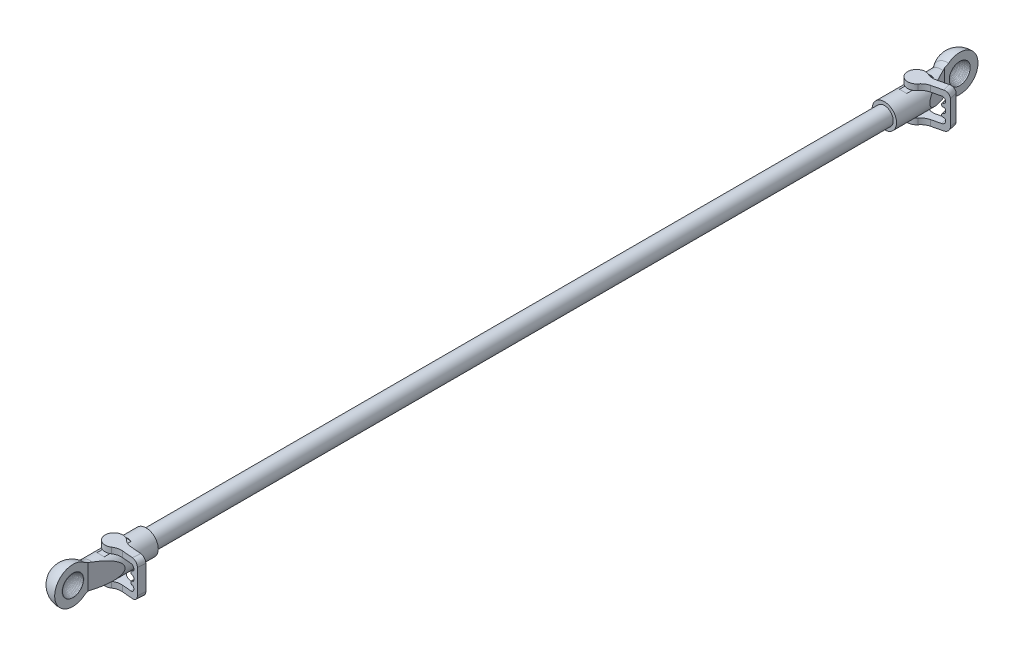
ISO-10303-21;
HEADER;
FILE_DESCRIPTION(('STEP AP214'),'2;1');
FILE_NAME('part.step','',(''),(''),'','','');
FILE_SCHEMA(('AUTOMOTIVE_DESIGN { 1 0 10303 214 1 1 1 1 }'));
ENDSEC;
DATA;
#1=APPLICATION_CONTEXT('core data for automotive mechanical design processes');
#2=APPLICATION_PROTOCOL_DEFINITION('international standard','automotive_design',2000,#1);
#3=PRODUCT_CONTEXT('',#1,'mechanical');
#4=PRODUCT('Part','Part','',(#3));
#5=PRODUCT_RELATED_PRODUCT_CATEGORY('part','',(#4));
#6=PRODUCT_DEFINITION_FORMATION('','',#4);
#7=PRODUCT_DEFINITION_CONTEXT('part definition',#1,'design');
#8=PRODUCT_DEFINITION('design','',#6,#7);
#9=PRODUCT_DEFINITION_SHAPE('','',#8);
#10=(LENGTH_UNIT() NAMED_UNIT(*) SI_UNIT(.MILLI.,.METRE.));
#11=(NAMED_UNIT(*) PLANE_ANGLE_UNIT() SI_UNIT($,.RADIAN.));
#12=(NAMED_UNIT(*) SI_UNIT($,.STERADIAN.) SOLID_ANGLE_UNIT());
#13=UNCERTAINTY_MEASURE_WITH_UNIT(LENGTH_MEASURE(1.E-05),#10,'distance_accuracy_value','');
#14=(GEOMETRIC_REPRESENTATION_CONTEXT(3) GLOBAL_UNCERTAINTY_ASSIGNED_CONTEXT((#13)) GLOBAL_UNIT_ASSIGNED_CONTEXT((#10,
#11,#12)) REPRESENTATION_CONTEXT('',''));
#15=CARTESIAN_POINT('',(0.,0.,0.));
#16=DIRECTION('',(0.,0.,1.));
#17=DIRECTION('',(1.,0.,0.));
#18=AXIS2_PLACEMENT_3D('',#15,#16,#17);
#19=CARTESIAN_POINT('',(0.,0.,67.));
#20=DIRECTION('',(1.,0.,0.));
#21=DIRECTION('',(0.,0.,-1.));
#22=AXIS2_PLACEMENT_3D('',#19,#20,#21);
#23=SPHERICAL_SURFACE('',#22,9.49999999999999);
#24=CARTESIAN_POINT('',(1.,0.,67.));
#25=DIRECTION('',(1.,0.,0.));
#26=DIRECTION('',(0.,0.,-1.));
#27=AXIS2_PLACEMENT_3D('',#24,#25,#26);
#28=CIRCLE('',#27,9.44722181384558);
#29=CARTESIAN_POINT('',(1.,0.,57.5527781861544));
#30=VERTEX_POINT('',#29);
#31=EDGE_CURVE('P0_E11',#30,#30,#28,.T.);
#32=ORIENTED_EDGE('',*,*,#31,.T.);
#33=EDGE_LOOP('',(#32));
#34=FACE_BOUND('',#33,.T.);
#35=ADVANCED_FACE('P0_F39',(#34),#23,.F.);
#36=CARTESIAN_POINT('',(1.,0.,57.1478706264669));
#37=DIRECTION('',(1.,0.,0.));
#38=DIRECTION('',(0.,0.,-1.));
#39=AXIS2_PLACEMENT_3D('',#36,#37,#38);
#40=PLANE('',#39);
#41=CARTESIAN_POINT('',(1.,0.,67.));
#42=DIRECTION('',(1.,0.,0.));
#43=DIRECTION('',(0.,0.,-1.));
#44=AXIS2_PLACEMENT_3D('',#41,#42,#43);
#45=CIRCLE('',#44,9.85212937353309);
#46=CARTESIAN_POINT('',(1.,0.,57.1478706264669));
#47=VERTEX_POINT('',#46);
#48=EDGE_CURVE('P0_E45',#47,#47,#45,.T.);
#49=ORIENTED_EDGE('',*,*,#48,.T.);
#50=EDGE_LOOP('',(#49));
#51=FACE_BOUND('',#50,.T.);
#52=ORIENTED_EDGE('',*,*,#31,.F.);
#53=EDGE_LOOP('',(#52));
#54=FACE_BOUND('',#53,.T.);
#55=ADVANCED_FACE('P0_F65',(#51,#54),#40,.T.);
#56=CARTESIAN_POINT('',(1.,0.,67.));
#57=DIRECTION('',(1.,0.,0.));
#58=DIRECTION('',(0.,0.,-1.));
#59=AXIS2_PLACEMENT_3D('',#56,#57,#58);
#60=CYLINDRICAL_SURFACE('',#59,9.85212937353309);
#61=CARTESIAN_POINT('',(-10.1271026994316,0.,67.));
#62=DIRECTION('',(1.,0.,0.));
#63=DIRECTION('',(0.,0.,-1.));
#64=AXIS2_PLACEMENT_3D('',#61,#62,#63);
#65=CIRCLE('',#64,9.85212937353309);
#66=CARTESIAN_POINT('',(-10.1271026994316,0.,57.1478706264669));
#67=VERTEX_POINT('',#66);
#68=EDGE_CURVE('P0_E49',#67,#67,#65,.T.);
#69=ORIENTED_EDGE('',*,*,#68,.T.);
#70=EDGE_LOOP('',(#69));
#71=FACE_BOUND('',#70,.T.);
#72=ORIENTED_EDGE('',*,*,#48,.F.);
#73=EDGE_LOOP('',(#72));
#74=FACE_BOUND('',#73,.T.);
#75=ADVANCED_FACE('P0_F56',(#71,#74),#60,.T.);
#76=CARTESIAN_POINT('',(-10.1271026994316,0.,57.1478706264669));
#77=DIRECTION('',(-1.,0.,0.));
#78=DIRECTION('',(0.,0.,1.));
#79=AXIS2_PLACEMENT_3D('',#76,#77,#78);
#80=PLANE('',#79);
#81=ORIENTED_EDGE('',*,*,#68,.F.);
#82=EDGE_LOOP('',(#81));
#83=FACE_BOUND('',#82,.T.);
#84=ADVANCED_FACE('P0_F59',(#83),#80,.T.);
#85=CLOSED_SHELL('',(#35,#55,#75,#84));
#86=MANIFOLD_SOLID_BREP('P0_B2',#85);
#87=CARTESIAN_POINT('',(0.,0.,-733.));
#88=DIRECTION('',(-1.,0.,0.));
#89=DIRECTION('',(0.,0.,1.));
#90=AXIS2_PLACEMENT_3D('',#87,#88,#89);
#91=SPHERICAL_SURFACE('',#90,9.50000000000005);
#92=CARTESIAN_POINT('',(0.,0.,-733.));
#93=DIRECTION('',(-1.,0.,0.));
#94=DIRECTION('',(0.,0.,1.));
#95=AXIS2_PLACEMENT_3D('',#92,#93,#94);
#96=CIRCLE('',#95,9.50000000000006);
#97=CARTESIAN_POINT('',(0.,0.,-723.5));
#98=VERTEX_POINT('',#97);
#99=EDGE_CURVE('P0_E38',#98,#98,#96,.T.);
#100=ORIENTED_EDGE('',*,*,#99,.F.);
#101=EDGE_LOOP('',(#100));
#102=FACE_BOUND('',#101,.T.);
#103=ADVANCED_FACE('P0_F95',(#102),#91,.F.);
#104=CARTESIAN_POINT('',(0.,0.,-742.5));
#105=DIRECTION('',(-1.,0.,0.));
#106=DIRECTION('',(0.,0.,1.));
#107=AXIS2_PLACEMENT_3D('',#104,#105,#106);
#108=PLANE('',#107);
#109=CARTESIAN_POINT('',(0.,0.,-733.));
#110=DIRECTION('',(-1.,0.,0.));
#111=DIRECTION('',(0.,0.,1.));
#112=AXIS2_PLACEMENT_3D('',#109,#110,#111);
#113=CIRCLE('',#112,10.3254480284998);
#114=CARTESIAN_POINT('',(0.,0.,-722.6745519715));
#115=VERTEX_POINT('',#114);
#116=EDGE_CURVE('P0_E101',#115,#115,#113,.T.);
#117=ORIENTED_EDGE('',*,*,#116,.F.);
#118=EDGE_LOOP('',(#117));
#119=FACE_BOUND('',#118,.T.);
#120=ORIENTED_EDGE('',*,*,#99,.T.);
#121=EDGE_LOOP('',(#120));
#122=FACE_BOUND('',#121,.T.);
#123=ADVANCED_FACE('P0_F116',(#119,#122),#108,.F.);
#124=CARTESIAN_POINT('',(-10.153387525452,0.,-733.));
#125=DIRECTION('',(-1.,0.,0.));
#126=DIRECTION('',(0.,0.,1.));
#127=AXIS2_PLACEMENT_3D('',#124,#125,#126);
#128=CYLINDRICAL_SURFACE('',#127,10.3254480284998);
#129=CARTESIAN_POINT('',(-10.153387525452,0.,-733.));
#130=DIRECTION('',(-1.,0.,0.));
#131=DIRECTION('',(0.,0.,1.));
#132=AXIS2_PLACEMENT_3D('',#129,#130,#131);
#133=CIRCLE('',#132,10.3254480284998);
#134=CARTESIAN_POINT('',(-10.153387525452,0.,-722.6745519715));
#135=VERTEX_POINT('',#134);
#136=EDGE_CURVE('P0_E105',#135,#135,#133,.T.);
#137=ORIENTED_EDGE('',*,*,#136,.F.);
#138=EDGE_LOOP('',(#137));
#139=FACE_BOUND('',#138,.T.);
#140=ORIENTED_EDGE('',*,*,#116,.T.);
#141=EDGE_LOOP('',(#140));
#142=FACE_BOUND('',#141,.T.);
#143=ADVANCED_FACE('P0_F114',(#139,#142),#128,.T.);
#144=CARTESIAN_POINT('',(-10.153387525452,0.,-743.3254480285));
#145=DIRECTION('',(1.,0.,0.));
#146=DIRECTION('',(0.,0.,-1.));
#147=AXIS2_PLACEMENT_3D('',#144,#145,#146);
#148=PLANE('',#147);
#149=ORIENTED_EDGE('',*,*,#136,.T.);
#150=EDGE_LOOP('',(#149));
#151=FACE_BOUND('',#150,.T.);
#152=ADVANCED_FACE('P0_F112',(#151),#148,.F.);
#153=CLOSED_SHELL('',(#103,#123,#143,#152));
#154=MANIFOLD_SOLID_BREP('P0_B6',#153);
#155=CARTESIAN_POINT('',(19.6027721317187,-5.50000000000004,-703.305499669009));
#156=DIRECTION('',(0.972371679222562,0.,-0.233438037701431));
#157=DIRECTION('',(-0.233438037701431,0.,-0.972371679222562));
#158=AXIS2_PLACEMENT_3D('',#155,#156,#157);
#159=PLANE('',#158);
#160=DIRECTION('',(0.23343803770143,0.,0.972371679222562));
#161=VECTOR('',#160,1.);
#162=CARTESIAN_POINT('',(19.6027721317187,-3.50000000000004,-703.305499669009));
#163=LINE('',#162,#161);
#164=CARTESIAN_POINT('',(19.6027721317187,-3.50000000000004,-703.305499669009));
#165=VERTEX_POINT('',#164);
#166=CARTESIAN_POINT('',(21.2368383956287,-3.50000000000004,-696.498897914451));
#167=VERTEX_POINT('',#166);
#168=EDGE_CURVE('P1_E261',#165,#167,#163,.T.);
#169=ORIENTED_EDGE('',*,*,#168,.F.);
#170=DIRECTION('',(0.,1.,0.));
#171=VECTOR('',#170,1.);
#172=CARTESIAN_POINT('',(19.6027721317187,-5.50000000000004,-703.305499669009));
#173=LINE('',#172,#171);
#174=CARTESIAN_POINT('',(19.6027721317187,-4.50000000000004,-703.305499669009));
#175=VERTEX_POINT('',#174);
#176=EDGE_CURVE('P1_E404',#175,#165,#173,.T.);
#177=ORIENTED_EDGE('',*,*,#176,.F.);
#178=DIRECTION('',(0.23343803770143,0.,0.972371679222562));
#179=VECTOR('',#178,1.);
#180=CARTESIAN_POINT('',(19.6027721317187,-4.50000000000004,-703.305499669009));
#181=LINE('',#180,#179);
#182=CARTESIAN_POINT('',(21.2368383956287,-4.50000000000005,-696.498897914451));
#183=VERTEX_POINT('',#182);
#184=EDGE_CURVE('P1_E174',#183,#175,#181,.F.);
#185=ORIENTED_EDGE('',*,*,#184,.F.);
#186=DIRECTION('',(0.,1.,0.));
#187=VECTOR('',#186,1.);
#188=CARTESIAN_POINT('',(21.2368383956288,-5.50000000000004,-696.498897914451));
#189=LINE('',#188,#187);
#190=EDGE_CURVE('P1_E170',#167,#183,#189,.F.);
#191=ORIENTED_EDGE('',*,*,#190,.F.);
#192=EDGE_LOOP('',(#169,#177,#185,#191));
#193=FACE_BOUND('',#192,.T.);
#194=ADVANCED_FACE('P1_F16',(#193),#159,.F.);
#195=CARTESIAN_POINT('',(19.6027721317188,2.49999999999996,-703.305499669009));
#196=DIRECTION('',(0.972371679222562,0.,-0.233438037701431));
#197=DIRECTION('',(-0.233438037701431,0.,-0.972371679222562));
#198=AXIS2_PLACEMENT_3D('',#195,#196,#197);
#199=PLANE('',#198);
#200=DIRECTION('',(0.23343803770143,0.,0.972371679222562));
#201=VECTOR('',#200,1.);
#202=CARTESIAN_POINT('',(19.6027721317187,4.49999999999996,-703.305499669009));
#203=LINE('',#202,#201);
#204=CARTESIAN_POINT('',(19.6027721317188,4.49999999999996,-703.305499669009));
#205=VERTEX_POINT('',#204);
#206=CARTESIAN_POINT('',(21.2368383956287,4.49999999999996,-696.498897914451));
#207=VERTEX_POINT('',#206);
#208=EDGE_CURVE('P1_E251',#205,#207,#203,.T.);
#209=ORIENTED_EDGE('',*,*,#208,.F.);
#210=DIRECTION('',(0.,1.,0.));
#211=VECTOR('',#210,1.);
#212=CARTESIAN_POINT('',(19.6027721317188,2.49999999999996,-703.305499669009));
#213=LINE('',#212,#211);
#214=CARTESIAN_POINT('',(19.6027721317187,3.49999999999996,-703.305499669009));
#215=VERTEX_POINT('',#214);
#216=EDGE_CURVE('P1_E395',#215,#205,#213,.T.);
#217=ORIENTED_EDGE('',*,*,#216,.F.);
#218=DIRECTION('',(0.23343803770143,0.,0.972371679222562));
#219=VECTOR('',#218,1.);
#220=CARTESIAN_POINT('',(19.6027721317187,3.49999999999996,-703.305499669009));
#221=LINE('',#220,#219);
#222=CARTESIAN_POINT('',(21.2368383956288,3.49999999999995,-696.498897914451));
#223=VERTEX_POINT('',#222);
#224=EDGE_CURVE('P1_E258',#223,#215,#221,.F.);
#225=ORIENTED_EDGE('',*,*,#224,.F.);
#226=DIRECTION('',(0.,1.,0.));
#227=VECTOR('',#226,1.);
#228=CARTESIAN_POINT('',(21.2368383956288,2.49999999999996,-696.498897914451));
#229=LINE('',#228,#227);
#230=EDGE_CURVE('P1_E175',#207,#223,#229,.F.);
#231=ORIENTED_EDGE('',*,*,#230,.F.);
#232=EDGE_LOOP('',(#209,#217,#225,#231));
#233=FACE_BOUND('',#232,.T.);
#234=ADVANCED_FACE('P1_F788',(#233),#199,.F.);
#235=CARTESIAN_POINT('',(20.5751438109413,-4.50000000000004,-703.53893770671));
#236=DIRECTION('',(0.23343803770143,0.,0.972371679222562));
#237=DIRECTION('',(0.972371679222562,0.,-0.23343803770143));
#238=AXIS2_PLACEMENT_3D('',#235,#236,#237);
#239=CYLINDRICAL_SURFACE('',#238,1.00000000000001);
#240=CARTESIAN_POINT('',(20.5751438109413,-4.50000000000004,-703.538937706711));
#241=DIRECTION('',(0.23343803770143,0.,0.972371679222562));
#242=DIRECTION('',(0.972371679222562,0.,-0.23343803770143));
#243=AXIS2_PLACEMENT_3D('',#240,#241,#242);
#244=CIRCLE('',#243,1.00000000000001);
#245=CARTESIAN_POINT('',(20.5751438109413,-5.50000000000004,-703.53893770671));
#246=VERTEX_POINT('',#245);
#247=EDGE_CURVE('P1_E180',#175,#246,#244,.T.);
#248=ORIENTED_EDGE('',*,*,#247,.T.);
#249=DIRECTION('',(0.233438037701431,0.,0.972371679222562));
#250=VECTOR('',#249,1.);
#251=CARTESIAN_POINT('',(20.1666272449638,-5.50000000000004,-705.24058814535));
#252=LINE('',#251,#250);
#253=CARTESIAN_POINT('',(22.2092100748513,-5.50000000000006,-696.732335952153));
#254=VERTEX_POINT('',#253);
#255=EDGE_CURVE('P1_E177',#246,#254,#252,.T.);
#256=ORIENTED_EDGE('',*,*,#255,.T.);
#257=CARTESIAN_POINT('',(22.2092100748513,-4.50000000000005,-696.732335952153));
#258=DIRECTION('',(0.23343803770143,0.,0.972371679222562));
#259=DIRECTION('',(0.972371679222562,0.,-0.23343803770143));
#260=AXIS2_PLACEMENT_3D('',#257,#258,#259);
#261=CIRCLE('',#260,1.00000000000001);
#262=EDGE_CURVE('P1_E19',#254,#183,#261,.F.);
#263=ORIENTED_EDGE('',*,*,#262,.T.);
#264=ORIENTED_EDGE('',*,*,#184,.T.);
#265=EDGE_LOOP('',(#248,#256,#263,#264));
#266=FACE_BOUND('',#265,.T.);
#267=ADVANCED_FACE('P1_F178',(#266),#239,.T.);
#268=CARTESIAN_POINT('',(24.1539534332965,7.74999999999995,-697.199212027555));
#269=DIRECTION('',(0.972371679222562,0.,-0.233438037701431));
#270=DIRECTION('',(-0.233438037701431,0.,-0.972371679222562));
#271=AXIS2_PLACEMENT_3D('',#268,#269,#270);
#272=PLANE('',#271);
#273=DIRECTION('',(-0.233438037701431,0.,-0.972371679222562));
#274=VECTOR('',#273,1.);
#275=CARTESIAN_POINT('',(32.2419484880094,-7.75000000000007,-663.509169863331));
#276=LINE('',#275,#274);
#277=CARTESIAN_POINT('',(22.5198871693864,-7.75000000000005,-704.005813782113));
#278=VERTEX_POINT('',#277);
#279=CARTESIAN_POINT('',(24.1539534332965,-7.75000000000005,-697.199212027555));
#280=VERTEX_POINT('',#279);
#281=EDGE_CURVE('P1_E376',#278,#280,#276,.F.);
#282=ORIENTED_EDGE('',*,*,#281,.T.);
#283=DIRECTION('',(0.,1.,0.));
#284=VECTOR('',#283,1.);
#285=CARTESIAN_POINT('',(24.1539534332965,7.74999999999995,-697.199212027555));
#286=LINE('',#285,#284);
#287=CARTESIAN_POINT('',(24.1539534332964,-7.50000000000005,-697.199212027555));
#288=VERTEX_POINT('',#287);
#289=EDGE_CURVE('P1_E266',#288,#280,#286,.F.);
#290=ORIENTED_EDGE('',*,*,#289,.F.);
#291=DIRECTION('',(0.233438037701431,0.,0.972371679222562));
#292=VECTOR('',#291,1.);
#293=CARTESIAN_POINT('',(22.1113706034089,-7.50000000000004,-705.707464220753));
#294=LINE('',#293,#292);
#295=CARTESIAN_POINT('',(22.5198871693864,-7.50000000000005,-704.005813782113));
#296=VERTEX_POINT('',#295);
#297=EDGE_CURVE('P1_E184',#288,#296,#294,.F.);
#298=ORIENTED_EDGE('',*,*,#297,.T.);
#299=DIRECTION('',(0.,1.,0.));
#300=VECTOR('',#299,1.);
#301=CARTESIAN_POINT('',(22.5198871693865,7.74999999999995,-704.005813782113));
#302=LINE('',#301,#300);
#303=EDGE_CURVE('P1_E265',#278,#296,#302,.T.);
#304=ORIENTED_EDGE('',*,*,#303,.F.);
#305=EDGE_LOOP('',(#282,#290,#298,#304));
#306=FACE_BOUND('',#305,.T.);
#307=ADVANCED_FACE('P1_F429',(#306),#272,.F.);
#308=CARTESIAN_POINT('',(20.5751438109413,-3.50000000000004,-703.53893770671));
#309=DIRECTION('',(0.23343803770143,0.,0.972371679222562));
#310=DIRECTION('',(0.972371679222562,0.,-0.23343803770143));
#311=AXIS2_PLACEMENT_3D('',#308,#309,#310);
#312=CYLINDRICAL_SURFACE('',#311,1.00000000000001);
#313=CARTESIAN_POINT('',(20.5751438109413,-3.50000000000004,-703.53893770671));
#314=DIRECTION('',(0.23343803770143,0.,0.972371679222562));
#315=DIRECTION('',(0.972371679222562,0.,-0.23343803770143));
#316=AXIS2_PLACEMENT_3D('',#313,#314,#315);
#317=CIRCLE('',#316,1.00000000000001);
#318=CARTESIAN_POINT('',(20.5751438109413,-2.50000000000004,-703.53893770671));
#319=VERTEX_POINT('',#318);
#320=EDGE_CURVE('P1_E262',#319,#165,#317,.T.);
#321=ORIENTED_EDGE('',*,*,#320,.T.);
#322=ORIENTED_EDGE('',*,*,#168,.T.);
#323=CARTESIAN_POINT('',(22.2092100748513,-3.50000000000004,-696.732335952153));
#324=DIRECTION('',(0.23343803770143,0.,0.972371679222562));
#325=DIRECTION('',(0.972371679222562,0.,-0.23343803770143));
#326=AXIS2_PLACEMENT_3D('',#323,#324,#325);
#327=CIRCLE('',#326,1.00000000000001);
#328=CARTESIAN_POINT('',(22.2092100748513,-2.50000000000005,-696.732335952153));
#329=VERTEX_POINT('',#328);
#330=EDGE_CURVE('P1_E264',#167,#329,#327,.F.);
#331=ORIENTED_EDGE('',*,*,#330,.T.);
#332=DIRECTION('',(0.233438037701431,0.,0.972371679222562));
#333=VECTOR('',#332,1.);
#334=CARTESIAN_POINT('',(20.1666272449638,-2.50000000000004,-705.24058814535));
#335=LINE('',#334,#333);
#336=EDGE_CURVE('P1_E368',#329,#319,#335,.F.);
#337=ORIENTED_EDGE('',*,*,#336,.T.);
#338=EDGE_LOOP('',(#321,#322,#331,#337));
#339=FACE_BOUND('',#338,.T.);
#340=ADVANCED_FACE('P1_F409',(#339),#312,.T.);
#341=CARTESIAN_POINT('',(20.5751438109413,3.49999999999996,-703.53893770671));
#342=DIRECTION('',(0.23343803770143,0.,0.972371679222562));
#343=DIRECTION('',(0.972371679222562,0.,-0.23343803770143));
#344=AXIS2_PLACEMENT_3D('',#341,#342,#343);
#345=CYLINDRICAL_SURFACE('',#344,1.00000000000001);
#346=CARTESIAN_POINT('',(20.5751438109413,3.49999999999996,-703.538937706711));
#347=DIRECTION('',(0.23343803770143,0.,0.972371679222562));
#348=DIRECTION('',(0.972371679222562,0.,-0.23343803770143));
#349=AXIS2_PLACEMENT_3D('',#346,#347,#348);
#350=CIRCLE('',#349,1.00000000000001);
#351=CARTESIAN_POINT('',(20.5751438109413,2.49999999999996,-703.53893770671));
#352=VERTEX_POINT('',#351);
#353=EDGE_CURVE('P1_E255',#215,#352,#350,.T.);
#354=ORIENTED_EDGE('',*,*,#353,.T.);
#355=DIRECTION('',(0.233438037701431,0.,0.972371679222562));
#356=VECTOR('',#355,1.);
#357=CARTESIAN_POINT('',(20.1666272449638,2.49999999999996,-705.24058814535));
#358=LINE('',#357,#356);
#359=CARTESIAN_POINT('',(22.2092100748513,2.49999999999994,-696.732335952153));
#360=VERTEX_POINT('',#359);
#361=EDGE_CURVE('P1_E364',#352,#360,#358,.T.);
#362=ORIENTED_EDGE('',*,*,#361,.T.);
#363=CARTESIAN_POINT('',(22.2092100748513,3.49999999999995,-696.732335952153));
#364=DIRECTION('',(0.23343803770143,0.,0.972371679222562));
#365=DIRECTION('',(0.972371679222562,0.,-0.23343803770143));
#366=AXIS2_PLACEMENT_3D('',#363,#364,#365);
#367=CIRCLE('',#366,1.00000000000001);
#368=EDGE_CURVE('P1_E259',#360,#223,#367,.F.);
#369=ORIENTED_EDGE('',*,*,#368,.T.);
#370=ORIENTED_EDGE('',*,*,#224,.T.);
#371=EDGE_LOOP('',(#354,#362,#369,#370));
#372=FACE_BOUND('',#371,.T.);
#373=ADVANCED_FACE('P1_F754',(#372),#345,.T.);
#374=CARTESIAN_POINT('',(24.1539534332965,7.74999999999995,-697.199212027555));
#375=DIRECTION('',(0.972371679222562,0.,-0.233438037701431));
#376=DIRECTION('',(-0.233438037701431,0.,-0.972371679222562));
#377=AXIS2_PLACEMENT_3D('',#374,#375,#376);
#378=PLANE('',#377);
#379=DIRECTION('',(0.233438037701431,0.,0.972371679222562));
#380=VECTOR('',#379,1.);
#381=CARTESIAN_POINT('',(22.1113706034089,0.499999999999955,-705.707464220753));
#382=LINE('',#381,#380);
#383=CARTESIAN_POINT('',(24.1539534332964,0.499999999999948,-697.199212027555));
#384=VERTEX_POINT('',#383);
#385=CARTESIAN_POINT('',(22.5198871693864,0.499999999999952,-704.005813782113));
#386=VERTEX_POINT('',#385);
#387=EDGE_CURVE('P1_E359',#384,#386,#382,.F.);
#388=ORIENTED_EDGE('',*,*,#387,.T.);
#389=DIRECTION('',(0.,1.,0.));
#390=VECTOR('',#389,1.);
#391=CARTESIAN_POINT('',(22.5198871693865,7.74999999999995,-704.005813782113));
#392=LINE('',#391,#390);
#393=CARTESIAN_POINT('',(22.5198871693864,-0.500000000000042,-704.005813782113));
#394=VERTEX_POINT('',#393);
#395=EDGE_CURVE('P1_E257',#394,#386,#392,.T.);
#396=ORIENTED_EDGE('',*,*,#395,.F.);
#397=DIRECTION('',(0.233438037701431,0.,0.972371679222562));
#398=VECTOR('',#397,1.);
#399=CARTESIAN_POINT('',(22.1113706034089,-0.500000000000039,-705.707464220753));
#400=LINE('',#399,#398);
#401=CARTESIAN_POINT('',(24.1539534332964,-0.500000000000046,-697.199212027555));
#402=VERTEX_POINT('',#401);
#403=EDGE_CURVE('P1_E367',#394,#402,#400,.T.);
#404=ORIENTED_EDGE('',*,*,#403,.T.);
#405=DIRECTION('',(0.,1.,0.));
#406=VECTOR('',#405,1.);
#407=CARTESIAN_POINT('',(24.1539534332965,7.74999999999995,-697.199212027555));
#408=LINE('',#407,#406);
#409=EDGE_CURVE('P1_E254',#384,#402,#408,.F.);
#410=ORIENTED_EDGE('',*,*,#409,.F.);
#411=EDGE_LOOP('',(#388,#396,#404,#410));
#412=FACE_BOUND('',#411,.T.);
#413=ADVANCED_FACE('P1_F745',(#412),#378,.F.);
#414=CARTESIAN_POINT('',(20.5751438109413,4.49999999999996,-703.53893770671));
#415=DIRECTION('',(0.23343803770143,0.,0.972371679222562));
#416=DIRECTION('',(0.972371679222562,0.,-0.23343803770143));
#417=AXIS2_PLACEMENT_3D('',#414,#415,#416);
#418=CYLINDRICAL_SURFACE('',#417,1.00000000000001);
#419=CARTESIAN_POINT('',(20.5751438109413,4.49999999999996,-703.53893770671));
#420=DIRECTION('',(0.23343803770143,0.,0.972371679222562));
#421=DIRECTION('',(0.972371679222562,0.,-0.23343803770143));
#422=AXIS2_PLACEMENT_3D('',#419,#420,#421);
#423=CIRCLE('',#422,1.00000000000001);
#424=CARTESIAN_POINT('',(20.5751438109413,5.49999999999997,-703.53893770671));
#425=VERTEX_POINT('',#424);
#426=EDGE_CURVE('P1_E249',#425,#205,#423,.T.);
#427=ORIENTED_EDGE('',*,*,#426,.T.);
#428=ORIENTED_EDGE('',*,*,#208,.T.);
#429=CARTESIAN_POINT('',(22.2092100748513,4.49999999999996,-696.732335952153));
#430=DIRECTION('',(0.23343803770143,0.,0.972371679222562));
#431=DIRECTION('',(0.972371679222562,0.,-0.23343803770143));
#432=AXIS2_PLACEMENT_3D('',#429,#430,#431);
#433=CIRCLE('',#432,1.00000000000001);
#434=CARTESIAN_POINT('',(22.2092100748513,5.49999999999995,-696.732335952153));
#435=VERTEX_POINT('',#434);
#436=EDGE_CURVE('P1_E252',#207,#435,#433,.F.);
#437=ORIENTED_EDGE('',*,*,#436,.T.);
#438=DIRECTION('',(0.233438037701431,0.,0.972371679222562));
#439=VECTOR('',#438,1.);
#440=CARTESIAN_POINT('',(20.1666272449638,5.49999999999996,-705.24058814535));
#441=LINE('',#440,#439);
#442=EDGE_CURVE('P1_E356',#435,#425,#441,.F.);
#443=ORIENTED_EDGE('',*,*,#442,.T.);
#444=EDGE_LOOP('',(#427,#428,#437,#443));
#445=FACE_BOUND('',#444,.T.);
#446=ADVANCED_FACE('P1_F472',(#445),#418,.T.);
#447=CARTESIAN_POINT('',(24.1539534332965,7.74999999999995,-697.199212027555));
#448=DIRECTION('',(0.972371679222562,0.,-0.233438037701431));
#449=DIRECTION('',(-0.233438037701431,0.,-0.972371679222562));
#450=AXIS2_PLACEMENT_3D('',#447,#448,#449);
#451=PLANE('',#450);
#452=DIRECTION('',(-0.233438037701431,0.,-0.972371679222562));
#453=VECTOR('',#452,1.);
#454=CARTESIAN_POINT('',(32.2419484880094,7.74999999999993,-663.509169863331));
#455=LINE('',#454,#453);
#456=CARTESIAN_POINT('',(24.1539534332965,7.74999999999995,-697.199212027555));
#457=VERTEX_POINT('',#456);
#458=CARTESIAN_POINT('',(22.5198871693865,7.74999999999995,-704.005813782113));
#459=VERTEX_POINT('',#458);
#460=EDGE_CURVE('P1_E352',#457,#459,#455,.T.);
#461=ORIENTED_EDGE('',*,*,#460,.T.);
#462=DIRECTION('',(0.,1.,0.));
#463=VECTOR('',#462,1.);
#464=CARTESIAN_POINT('',(22.5198871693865,7.74999999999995,-704.005813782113));
#465=LINE('',#464,#463);
#466=CARTESIAN_POINT('',(22.5198871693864,7.49999999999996,-704.005813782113));
#467=VERTEX_POINT('',#466);
#468=EDGE_CURVE('P1_E387',#467,#459,#465,.T.);
#469=ORIENTED_EDGE('',*,*,#468,.F.);
#470=DIRECTION('',(0.233438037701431,0.,0.972371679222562));
#471=VECTOR('',#470,1.);
#472=CARTESIAN_POINT('',(22.111370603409,7.49999999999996,-705.707464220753));
#473=LINE('',#472,#471);
#474=CARTESIAN_POINT('',(24.1539534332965,7.49999999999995,-697.199212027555));
#475=VERTEX_POINT('',#474);
#476=EDGE_CURVE('P1_E355',#467,#475,#473,.T.);
#477=ORIENTED_EDGE('',*,*,#476,.T.);
#478=DIRECTION('',(0.,1.,0.));
#479=VECTOR('',#478,1.);
#480=CARTESIAN_POINT('',(24.1539534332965,7.74999999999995,-697.199212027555));
#481=LINE('',#480,#479);
#482=EDGE_CURVE('P1_E383',#457,#475,#481,.F.);
#483=ORIENTED_EDGE('',*,*,#482,.F.);
#484=EDGE_LOOP('',(#461,#469,#477,#483));
#485=FACE_BOUND('',#484,.T.);
#486=ADVANCED_FACE('P1_F461',(#485),#451,.F.);
#487=CARTESIAN_POINT('',(0.,-16.,-695.));
#488=DIRECTION('',(0.,1.,0.));
#489=DIRECTION('',(-1.,0.,0.));
#490=AXIS2_PLACEMENT_3D('',#487,#488,#489);
#491=CYLINDRICAL_SURFACE('',#490,8.00000000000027);
#492=DIRECTION('',(0.,1.,0.));
#493=VECTOR('',#492,1.);
#494=CARTESIAN_POINT('',(6.36332547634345,-16.,-690.151485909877));
#495=LINE('',#494,#493);
#496=CARTESIAN_POINT('',(6.36332547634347,10.75,-690.151485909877));
#497=VERTEX_POINT('',#496);
#498=CARTESIAN_POINT('',(6.36332547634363,16.,-690.151485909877));
#499=VERTEX_POINT('',#498);
#500=EDGE_CURVE('P1_E378',#497,#499,#495,.T.);
#501=ORIENTED_EDGE('',*,*,#500,.T.);
#502=CARTESIAN_POINT('',(0.,16.,-695.));
#503=DIRECTION('',(0.,1.,0.));
#504=DIRECTION('',(-1.,0.,0.));
#505=AXIS2_PLACEMENT_3D('',#502,#503,#504);
#506=CIRCLE('',#505,8.00000000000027);
#507=CARTESIAN_POINT('',(3.46869380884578,16.,-702.208894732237));
#508=VERTEX_POINT('',#507);
#509=EDGE_CURVE('P1_E233',#508,#499,#506,.T.);
#510=ORIENTED_EDGE('',*,*,#509,.F.);
#511=DIRECTION('',(0.,1.,0.));
#512=VECTOR('',#511,1.);
#513=CARTESIAN_POINT('',(3.4686938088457,-16.,-702.208894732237));
#514=LINE('',#513,#512);
#515=CARTESIAN_POINT('',(3.46869380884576,10.75,-702.208894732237));
#516=VERTEX_POINT('',#515);
#517=EDGE_CURVE('P1_E241',#508,#516,#514,.F.);
#518=ORIENTED_EDGE('',*,*,#517,.T.);
#519=CARTESIAN_POINT('',(0.,10.75,-695.));
#520=DIRECTION('',(0.,1.,0.));
#521=DIRECTION('',(-1.,0.,0.));
#522=AXIS2_PLACEMENT_3D('',#519,#520,#521);
#523=CIRCLE('',#522,8.00000000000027);
#524=EDGE_CURVE('P1_E245',#516,#497,#523,.T.);
#525=ORIENTED_EDGE('',*,*,#524,.T.);
#526=EDGE_LOOP('',(#501,#510,#518,#525));
#527=FACE_BOUND('',#526,.T.);
#528=ADVANCED_FACE('P1_F506',(#527),#491,.T.);
#529=CARTESIAN_POINT('',(15.9083136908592,-16.,-682.878714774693));
#530=DIRECTION('',(0.,1.,0.));
#531=DIRECTION('',(-1.,0.,0.));
#532=AXIS2_PLACEMENT_3D('',#529,#530,#531);
#533=CYLINDRICAL_SURFACE('',#532,12.0000000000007);
#534=DIRECTION('',(0.,1.,0.));
#535=VECTOR('',#534,1.);
#536=CARTESIAN_POINT('',(13.1070572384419,-16.,-694.547174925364));
#537=LINE('',#536,#535);
#538=CARTESIAN_POINT('',(13.1070572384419,16.,-694.547174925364));
#539=VERTEX_POINT('',#538);
#540=CARTESIAN_POINT('',(13.1070572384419,10.75,-694.547174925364));
#541=VERTEX_POINT('',#540);
#542=EDGE_CURVE('P1_E337',#539,#541,#537,.F.);
#543=ORIENTED_EDGE('',*,*,#542,.F.);
#544=CARTESIAN_POINT('',(15.9083136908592,16.,-682.878714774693));
#545=DIRECTION('',(0.,1.,0.));
#546=DIRECTION('',(-1.,0.,0.));
#547=AXIS2_PLACEMENT_3D('',#544,#545,#546);
#548=CIRCLE('',#547,12.0000000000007);
#549=EDGE_CURVE('P1_E230',#499,#539,#548,.F.);
#550=ORIENTED_EDGE('',*,*,#549,.F.);
#551=ORIENTED_EDGE('',*,*,#500,.F.);
#552=CARTESIAN_POINT('',(15.9083136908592,10.75,-682.878714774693));
#553=DIRECTION('',(0.,1.,0.));
#554=DIRECTION('',(-1.,0.,0.));
#555=AXIS2_PLACEMENT_3D('',#552,#553,#554);
#556=CIRCLE('',#555,12.0000000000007);
#557=EDGE_CURVE('P1_E242',#497,#541,#556,.F.);
#558=ORIENTED_EDGE('',*,*,#557,.T.);
#559=EDGE_LOOP('',(#543,#550,#551,#558));
#560=FACE_BOUND('',#559,.T.);
#561=ADVANCED_FACE('P1_F503',(#560),#533,.F.);
#562=CARTESIAN_POINT('',(31.1570945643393,-10.7500000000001,-668.028061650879));
#563=DIRECTION('',(0.,-1.,0.));
#564=DIRECTION('',(1.,0.,0.));
#565=AXIS2_PLACEMENT_3D('',#562,#563,#564);
#566=PLANE('',#565);
#567=CARTESIAN_POINT('',(8.67173452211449,-10.75,-713.022236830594));
#568=DIRECTION('',(0.,1.,0.));
#569=DIRECTION('',(-1.,0.,0.));
#570=AXIS2_PLACEMENT_3D('',#567,#568,#569);
#571=CIRCLE('',#570,12.0000000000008);
#572=CARTESIAN_POINT('',(11.4729909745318,-10.75,-701.353776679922));
#573=VERTEX_POINT('',#572);
#574=CARTESIAN_POINT('',(3.46869380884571,-10.75,-702.208894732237));
#575=VERTEX_POINT('',#574);
#576=EDGE_CURVE('P1_E226',#573,#575,#571,.F.);
#577=ORIENTED_EDGE('',*,*,#576,.T.);
#578=CARTESIAN_POINT('',(0.,-10.75,-695.));
#579=DIRECTION('',(0.,1.,0.));
#580=DIRECTION('',(-1.,0.,0.));
#581=AXIS2_PLACEMENT_3D('',#578,#579,#580);
#582=CIRCLE('',#581,8.00000000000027);
#583=CARTESIAN_POINT('',(6.36332547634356,-10.75,-690.151485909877));
#584=VERTEX_POINT('',#583);
#585=EDGE_CURVE('P1_E223',#584,#575,#582,.F.);
#586=ORIENTED_EDGE('',*,*,#585,.F.);
#587=CARTESIAN_POINT('',(15.9083136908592,-10.75,-682.878714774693));
#588=DIRECTION('',(0.,1.,0.));
#589=DIRECTION('',(-1.,0.,0.));
#590=AXIS2_PLACEMENT_3D('',#587,#588,#589);
#591=CIRCLE('',#590,12.0000000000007);
#592=CARTESIAN_POINT('',(13.1070572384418,-10.75,-694.547174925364));
#593=VERTEX_POINT('',#592);
#594=EDGE_CURVE('P1_E219',#584,#593,#591,.F.);
#595=ORIENTED_EDGE('',*,*,#594,.T.);
#596=DIRECTION('',(0.972371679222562,0.,-0.233438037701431));
#597=VECTOR('',#596,1.);
#598=CARTESIAN_POINT('',(13.1070572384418,-10.75,-694.547174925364));
#599=LINE('',#598,#597);
#600=CARTESIAN_POINT('',(21.2368383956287,-10.7500000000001,-696.498897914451));
#601=VERTEX_POINT('',#600);
#602=EDGE_CURVE('P1_E218',#601,#593,#599,.F.);
#603=ORIENTED_EDGE('',*,*,#602,.F.);
#604=DIRECTION('',(-0.233438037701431,0.,-0.972371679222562));
#605=VECTOR('',#604,1.);
#606=CARTESIAN_POINT('',(29.3248334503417,-10.7500000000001,-662.808855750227));
#607=LINE('',#606,#605);
#608=CARTESIAN_POINT('',(19.6027721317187,-10.75,-703.305499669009));
#609=VERTEX_POINT('',#608);
#610=EDGE_CURVE('P1_E185',#601,#609,#607,.T.);
#611=ORIENTED_EDGE('',*,*,#610,.T.);
#612=DIRECTION('',(-0.972371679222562,0.,0.233438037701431));
#613=VECTOR('',#612,1.);
#614=CARTESIAN_POINT('',(25.9231880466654,-10.75,-704.822846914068));
#615=LINE('',#614,#613);
#616=EDGE_CURVE('P1_E304',#573,#609,#615,.F.);
#617=ORIENTED_EDGE('',*,*,#616,.F.);
#618=EDGE_LOOP('',(#577,#586,#595,#603,#611,#617));
#619=FACE_BOUND('',#618,.T.);
#620=ADVANCED_FACE('P1_F438',(#619),#566,.F.);
#621=CARTESIAN_POINT('',(29.3248334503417,-7.75000000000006,-662.808855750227));
#622=DIRECTION('',(-0.233438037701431,0.,-0.972371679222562));
#623=DIRECTION('',(-0.972371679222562,0.,0.233438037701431));
#624=AXIS2_PLACEMENT_3D('',#621,#622,#623);
#625=CYLINDRICAL_SURFACE('',#624,3.00000000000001);
#626=CARTESIAN_POINT('',(21.2368383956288,-7.75000000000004,-696.498897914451));
#627=DIRECTION('',(-0.233438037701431,0.,-0.972371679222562));
#628=DIRECTION('',(-0.972371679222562,0.,0.233438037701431));
#629=AXIS2_PLACEMENT_3D('',#626,#627,#628);
#630=CIRCLE('',#629,3.00000000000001);
#631=EDGE_CURVE('P1_E215',#280,#601,#630,.T.);
#632=ORIENTED_EDGE('',*,*,#631,.F.);
#633=ORIENTED_EDGE('',*,*,#281,.F.);
#634=CARTESIAN_POINT('',(19.6027721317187,-7.75000000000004,-703.305499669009));
#635=DIRECTION('',(-0.233438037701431,0.,-0.972371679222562));
#636=DIRECTION('',(-0.972371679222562,0.,0.233438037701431));
#637=AXIS2_PLACEMENT_3D('',#634,#635,#636);
#638=CIRCLE('',#637,3.00000000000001);
#639=EDGE_CURVE('P1_E302',#609,#278,#638,.F.);
#640=ORIENTED_EDGE('',*,*,#639,.F.);
#641=ORIENTED_EDGE('',*,*,#610,.F.);
#642=EDGE_LOOP('',(#632,#633,#640,#641));
#643=FACE_BOUND('',#642,.T.);
#644=ADVANCED_FACE('P1_F433',(#643),#625,.F.);
#645=CARTESIAN_POINT('',(20.1666272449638,-7.50000000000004,-705.24058814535));
#646=DIRECTION('',(0.233438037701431,0.,0.972371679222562));
#647=DIRECTION('',(0.972371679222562,0.,-0.233438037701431));
#648=AXIS2_PLACEMENT_3D('',#645,#646,#647);
#649=CYLINDRICAL_SURFACE('',#648,2.);
#650=CARTESIAN_POINT('',(22.2092100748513,-7.50000000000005,-696.732335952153));
#651=DIRECTION('',(0.233438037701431,0.,0.972371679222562));
#652=DIRECTION('',(0.972371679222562,0.,-0.233438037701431));
#653=AXIS2_PLACEMENT_3D('',#650,#651,#652);
#654=CIRCLE('',#653,2.);
#655=EDGE_CURVE('P1_E168',#254,#288,#654,.F.);
#656=ORIENTED_EDGE('',*,*,#655,.F.);
#657=ORIENTED_EDGE('',*,*,#255,.F.);
#658=CARTESIAN_POINT('',(20.5751438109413,-7.50000000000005,-703.53893770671));
#659=DIRECTION('',(0.233438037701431,0.,0.972371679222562));
#660=DIRECTION('',(0.972371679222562,0.,-0.233438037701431));
#661=AXIS2_PLACEMENT_3D('',#658,#659,#660);
#662=CIRCLE('',#661,2.);
#663=EDGE_CURVE('P1_E300',#296,#246,#662,.T.);
#664=ORIENTED_EDGE('',*,*,#663,.F.);
#665=ORIENTED_EDGE('',*,*,#297,.F.);
#666=EDGE_LOOP('',(#656,#657,#664,#665));
#667=FACE_BOUND('',#666,.T.);
#668=ADVANCED_FACE('P1_F188',(#667),#649,.F.);
#669=CARTESIAN_POINT('',(20.1666272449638,-0.500000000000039,-705.24058814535));
#670=DIRECTION('',(0.233438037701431,0.,0.972371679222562));
#671=DIRECTION('',(0.972371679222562,0.,-0.233438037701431));
#672=AXIS2_PLACEMENT_3D('',#669,#670,#671);
#673=CYLINDRICAL_SURFACE('',#672,2.);
#674=CARTESIAN_POINT('',(20.5751438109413,-0.50000000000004,-703.53893770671));
#675=DIRECTION('',(0.233438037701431,0.,0.972371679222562));
#676=DIRECTION('',(0.972371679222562,0.,-0.233438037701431));
#677=AXIS2_PLACEMENT_3D('',#674,#675,#676);
#678=CIRCLE('',#677,2.);
#679=EDGE_CURVE('P1_E297',#319,#394,#678,.T.);
#680=ORIENTED_EDGE('',*,*,#679,.F.);
#681=ORIENTED_EDGE('',*,*,#336,.F.);
#682=CARTESIAN_POINT('',(22.2092100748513,-0.500000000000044,-696.732335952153));
#683=DIRECTION('',(0.233438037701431,0.,0.972371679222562));
#684=DIRECTION('',(0.972371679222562,0.,-0.233438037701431));
#685=AXIS2_PLACEMENT_3D('',#682,#683,#684);
#686=CIRCLE('',#685,2.);
#687=EDGE_CURVE('P1_E191',#402,#329,#686,.F.);
#688=ORIENTED_EDGE('',*,*,#687,.F.);
#689=ORIENTED_EDGE('',*,*,#403,.F.);
#690=EDGE_LOOP('',(#680,#681,#688,#689));
#691=FACE_BOUND('',#690,.T.);
#692=ADVANCED_FACE('P1_F416',(#691),#673,.F.);
#693=CARTESIAN_POINT('',(20.1666272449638,0.499999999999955,-705.24058814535));
#694=DIRECTION('',(0.233438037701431,0.,0.972371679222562));
#695=DIRECTION('',(0.972371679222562,0.,-0.233438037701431));
#696=AXIS2_PLACEMENT_3D('',#693,#694,#695);
#697=CYLINDRICAL_SURFACE('',#696,2.);
#698=CARTESIAN_POINT('',(22.2092100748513,0.49999999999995,-696.732335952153));
#699=DIRECTION('',(0.233438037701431,0.,0.972371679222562));
#700=DIRECTION('',(0.972371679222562,0.,-0.233438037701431));
#701=AXIS2_PLACEMENT_3D('',#698,#699,#700);
#702=CIRCLE('',#701,2.);
#703=EDGE_CURVE('P1_E196',#360,#384,#702,.F.);
#704=ORIENTED_EDGE('',*,*,#703,.F.);
#705=ORIENTED_EDGE('',*,*,#361,.F.);
#706=CARTESIAN_POINT('',(20.5751438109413,0.499999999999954,-703.53893770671));
#707=DIRECTION('',(0.233438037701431,0.,0.972371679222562));
#708=DIRECTION('',(0.972371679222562,0.,-0.233438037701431));
#709=AXIS2_PLACEMENT_3D('',#706,#707,#708);
#710=CIRCLE('',#709,2.);
#711=EDGE_CURVE('P1_E294',#386,#352,#710,.T.);
#712=ORIENTED_EDGE('',*,*,#711,.F.);
#713=ORIENTED_EDGE('',*,*,#387,.F.);
#714=EDGE_LOOP('',(#704,#705,#712,#713));
#715=FACE_BOUND('',#714,.T.);
#716=ADVANCED_FACE('P1_F550',(#715),#697,.F.);
#717=CARTESIAN_POINT('',(20.1666272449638,7.49999999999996,-705.24058814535));
#718=DIRECTION('',(0.233438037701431,0.,0.972371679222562));
#719=DIRECTION('',(0.972371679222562,0.,-0.233438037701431));
#720=AXIS2_PLACEMENT_3D('',#717,#718,#719);
#721=CYLINDRICAL_SURFACE('',#720,2.);
#722=CARTESIAN_POINT('',(20.5751438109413,7.49999999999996,-703.53893770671));
#723=DIRECTION('',(0.233438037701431,0.,0.972371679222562));
#724=DIRECTION('',(0.972371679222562,0.,-0.233438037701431));
#725=AXIS2_PLACEMENT_3D('',#722,#723,#724);
#726=CIRCLE('',#725,2.);
#727=EDGE_CURVE('P1_E291',#425,#467,#726,.T.);
#728=ORIENTED_EDGE('',*,*,#727,.F.);
#729=ORIENTED_EDGE('',*,*,#442,.F.);
#730=CARTESIAN_POINT('',(22.2092100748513,7.49999999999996,-696.732335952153));
#731=DIRECTION('',(0.233438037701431,0.,0.972371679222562));
#732=DIRECTION('',(0.972371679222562,0.,-0.233438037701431));
#733=AXIS2_PLACEMENT_3D('',#730,#731,#732);
#734=CIRCLE('',#733,2.);
#735=EDGE_CURVE('P1_E203',#475,#435,#734,.F.);
#736=ORIENTED_EDGE('',*,*,#735,.F.);
#737=ORIENTED_EDGE('',*,*,#476,.F.);
#738=EDGE_LOOP('',(#728,#729,#736,#737));
#739=FACE_BOUND('',#738,.T.);
#740=ADVANCED_FACE('P1_F467',(#739),#721,.F.);
#741=CARTESIAN_POINT('',(29.3248334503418,7.74999999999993,-662.808855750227));
#742=DIRECTION('',(-0.233438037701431,0.,-0.972371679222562));
#743=DIRECTION('',(-0.972371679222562,0.,0.233438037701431));
#744=AXIS2_PLACEMENT_3D('',#741,#742,#743);
#745=CYLINDRICAL_SURFACE('',#744,3.00000000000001);
#746=CARTESIAN_POINT('',(21.2368383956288,7.74999999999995,-696.498897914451));
#747=DIRECTION('',(-0.233438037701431,0.,-0.972371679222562));
#748=DIRECTION('',(-0.972371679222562,0.,0.233438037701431));
#749=AXIS2_PLACEMENT_3D('',#746,#747,#748);
#750=CIRCLE('',#749,3.00000000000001);
#751=CARTESIAN_POINT('',(21.2368383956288,10.75,-696.498897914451));
#752=VERTEX_POINT('',#751);
#753=EDGE_CURVE('P1_E206',#752,#457,#750,.T.);
#754=ORIENTED_EDGE('',*,*,#753,.F.);
#755=DIRECTION('',(-0.233438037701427,0.,-0.972371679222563));
#756=VECTOR('',#755,1.);
#757=CARTESIAN_POINT('',(21.2368383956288,10.75,-696.498897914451));
#758=LINE('',#757,#756);
#759=CARTESIAN_POINT('',(19.6027721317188,10.75,-703.305499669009));
#760=VERTEX_POINT('',#759);
#761=EDGE_CURVE('P1_E248',#752,#760,#758,.T.);
#762=ORIENTED_EDGE('',*,*,#761,.T.);
#763=CARTESIAN_POINT('',(19.6027721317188,7.74999999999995,-703.305499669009));
#764=DIRECTION('',(-0.233438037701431,0.,-0.972371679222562));
#765=DIRECTION('',(-0.972371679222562,0.,0.233438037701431));
#766=AXIS2_PLACEMENT_3D('',#763,#764,#765);
#767=CIRCLE('',#766,3.00000000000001);
#768=EDGE_CURVE('P1_E287',#459,#760,#767,.F.);
#769=ORIENTED_EDGE('',*,*,#768,.F.);
#770=ORIENTED_EDGE('',*,*,#460,.F.);
#771=EDGE_LOOP('',(#754,#762,#769,#770));
#772=FACE_BOUND('',#771,.T.);
#773=ADVANCED_FACE('P1_F476',(#772),#745,.F.);
#774=CARTESIAN_POINT('',(-33.2396366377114,10.7500000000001,-652.56828748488));
#775=DIRECTION('',(0.,1.,0.));
#776=DIRECTION('',(-1.,0.,0.));
#777=AXIS2_PLACEMENT_3D('',#774,#775,#776);
#778=PLANE('',#777);
#779=ORIENTED_EDGE('',*,*,#557,.F.);
#780=ORIENTED_EDGE('',*,*,#524,.F.);
#781=CARTESIAN_POINT('',(8.67173452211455,10.75,-713.022236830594));
#782=DIRECTION('',(0.,1.,0.));
#783=DIRECTION('',(-1.,0.,0.));
#784=AXIS2_PLACEMENT_3D('',#781,#782,#783);
#785=CIRCLE('',#784,12.0000000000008);
#786=CARTESIAN_POINT('',(11.4729909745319,10.75,-701.353776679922));
#787=VERTEX_POINT('',#786);
#788=EDGE_CURVE('P1_E238',#516,#787,#785,.T.);
#789=ORIENTED_EDGE('',*,*,#788,.T.);
#790=DIRECTION('',(-0.972371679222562,0.,0.233438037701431));
#791=VECTOR('',#790,1.);
#792=CARTESIAN_POINT('',(25.9231880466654,10.75,-704.822846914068));
#793=LINE('',#792,#791);
#794=EDGE_CURVE('P1_E290',#760,#787,#793,.T.);
#795=ORIENTED_EDGE('',*,*,#794,.F.);
#796=ORIENTED_EDGE('',*,*,#761,.F.);
#797=DIRECTION('',(0.972371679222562,0.,-0.233438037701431));
#798=VECTOR('',#797,1.);
#799=CARTESIAN_POINT('',(13.1070572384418,10.75,-694.547174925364));
#800=LINE('',#799,#798);
#801=EDGE_CURVE('P1_E209',#541,#752,#800,.T.);
#802=ORIENTED_EDGE('',*,*,#801,.F.);
#803=EDGE_LOOP('',(#779,#780,#789,#795,#796,#802));
#804=FACE_BOUND('',#803,.T.);
#805=ADVANCED_FACE('P1_F483',(#804),#778,.F.);
#806=CARTESIAN_POINT('',(8.67173452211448,-16.,-713.022236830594));
#807=DIRECTION('',(0.,1.,0.));
#808=DIRECTION('',(-1.,0.,0.));
#809=AXIS2_PLACEMENT_3D('',#806,#807,#808);
#810=CYLINDRICAL_SURFACE('',#809,12.0000000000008);
#811=ORIENTED_EDGE('',*,*,#517,.F.);
#812=CARTESIAN_POINT('',(8.67173452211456,16.,-713.022236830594));
#813=DIRECTION('',(0.,1.,0.));
#814=DIRECTION('',(-1.,0.,0.));
#815=AXIS2_PLACEMENT_3D('',#812,#813,#814);
#816=CIRCLE('',#815,12.0000000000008);
#817=CARTESIAN_POINT('',(11.4729909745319,16.,-701.353776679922));
#818=VERTEX_POINT('',#817);
#819=EDGE_CURVE('P1_E235',#818,#508,#816,.F.);
#820=ORIENTED_EDGE('',*,*,#819,.F.);
#821=DIRECTION('',(0.,1.,0.));
#822=VECTOR('',#821,1.);
#823=CARTESIAN_POINT('',(11.4729909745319,-16.0000000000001,-701.353776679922));
#824=LINE('',#823,#822);
#825=EDGE_CURVE('P1_E331',#787,#818,#824,.T.);
#826=ORIENTED_EDGE('',*,*,#825,.F.);
#827=ORIENTED_EDGE('',*,*,#788,.F.);
#828=EDGE_LOOP('',(#811,#820,#826,#827));
#829=FACE_BOUND('',#828,.T.);
#830=ADVANCED_FACE('P1_F486',(#829),#810,.F.);
#831=CARTESIAN_POINT('',(-10.0552559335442,16.,-682.011294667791));
#832=DIRECTION('',(0.,1.,0.));
#833=DIRECTION('',(-1.,0.,0.));
#834=AXIS2_PLACEMENT_3D('',#831,#832,#833);
#835=PLANE('',#834);
#836=DIRECTION('',(0.972371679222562,0.,-0.233438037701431));
#837=VECTOR('',#836,1.);
#838=CARTESIAN_POINT('',(13.1070572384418,16.,-694.547174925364));
#839=LINE('',#838,#837);
#840=CARTESIAN_POINT('',(22.6953959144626,16.,-696.849054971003));
#841=VERTEX_POINT('',#840);
#842=EDGE_CURVE('P1_E213',#841,#539,#839,.F.);
#843=ORIENTED_EDGE('',*,*,#842,.F.);
#844=DIRECTION('',(-0.233438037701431,0.,-0.972371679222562));
#845=VECTOR('',#844,1.);
#846=CARTESIAN_POINT('',(24.2787057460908,16.,-690.253875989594));
#847=LINE('',#846,#845);
#848=CARTESIAN_POINT('',(21.0613296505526,16.,-703.655656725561));
#849=VERTEX_POINT('',#848);
#850=EDGE_CURVE('P1_E232',#849,#841,#847,.F.);
#851=ORIENTED_EDGE('',*,*,#850,.F.);
#852=DIRECTION('',(-0.972371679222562,0.,0.233438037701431));
#853=VECTOR('',#852,1.);
#854=CARTESIAN_POINT('',(25.9231880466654,16.,-704.822846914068));
#855=LINE('',#854,#853);
#856=EDGE_CURVE('P1_E286',#818,#849,#855,.F.);
#857=ORIENTED_EDGE('',*,*,#856,.F.);
#858=ORIENTED_EDGE('',*,*,#819,.T.);
#859=ORIENTED_EDGE('',*,*,#509,.T.);
#860=ORIENTED_EDGE('',*,*,#549,.T.);
#861=EDGE_LOOP('',(#843,#851,#857,#858,#859,#860));
#862=FACE_BOUND('',#861,.T.);
#863=ADVANCED_FACE('P1_F491',(#862),#835,.T.);
#864=CARTESIAN_POINT('',(24.2787057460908,10.9999999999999,-690.253875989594));
#865=DIRECTION('',(-0.233438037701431,0.,-0.972371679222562));
#866=DIRECTION('',(-0.972371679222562,0.,0.233438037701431));
#867=AXIS2_PLACEMENT_3D('',#864,#865,#866);
#868=CYLINDRICAL_SURFACE('',#867,5.00000000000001);
#869=ORIENTED_EDGE('',*,*,#850,.T.);
#870=CARTESIAN_POINT('',(22.6953959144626,10.9999999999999,-696.849054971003));
#871=DIRECTION('',(-0.233438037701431,0.,-0.972371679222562));
#872=DIRECTION('',(-0.972371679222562,0.,0.233438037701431));
#873=AXIS2_PLACEMENT_3D('',#870,#871,#872);
#874=CIRCLE('',#873,5.00000000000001);
#875=CARTESIAN_POINT('',(27.5572543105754,10.9999999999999,-698.01624515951));
#876=VERTEX_POINT('',#875);
#877=EDGE_CURVE('P1_E210',#876,#841,#874,.F.);
#878=ORIENTED_EDGE('',*,*,#877,.F.);
#879=DIRECTION('',(-0.233438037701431,0.,-0.972371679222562));
#880=VECTOR('',#879,1.);
#881=CARTESIAN_POINT('',(27.5572543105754,10.9999999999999,-698.01624515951));
#882=LINE('',#881,#880);
#883=CARTESIAN_POINT('',(25.9231880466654,10.9999999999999,-704.822846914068));
#884=VERTEX_POINT('',#883);
#885=EDGE_CURVE('P1_E229',#884,#876,#882,.F.);
#886=ORIENTED_EDGE('',*,*,#885,.F.);
#887=CARTESIAN_POINT('',(21.0613296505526,11.,-703.655656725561));
#888=DIRECTION('',(-0.233438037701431,0.,-0.972371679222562));
#889=DIRECTION('',(-0.972371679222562,0.,0.233438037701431));
#890=AXIS2_PLACEMENT_3D('',#887,#888,#889);
#891=CIRCLE('',#890,5.00000000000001);
#892=EDGE_CURVE('P1_E283',#849,#884,#891,.T.);
#893=ORIENTED_EDGE('',*,*,#892,.F.);
#894=EDGE_LOOP('',(#869,#878,#886,#893));
#895=FACE_BOUND('',#894,.T.);
#896=ADVANCED_FACE('P1_F497',(#895),#868,.T.);
#897=CARTESIAN_POINT('',(27.5572543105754,-16.0000000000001,-698.01624515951));
#898=DIRECTION('',(0.972371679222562,0.,-0.233438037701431));
#899=DIRECTION('',(-0.233438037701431,0.,-0.972371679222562));
#900=AXIS2_PLACEMENT_3D('',#897,#898,#899);
#901=PLANE('',#900);
#902=DIRECTION('',(0.,1.,0.));
#903=VECTOR('',#902,1.);
#904=CARTESIAN_POINT('',(27.5572543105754,-16.,-698.01624515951));
#905=LINE('',#904,#903);
#906=CARTESIAN_POINT('',(27.5572543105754,-11.0000000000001,-698.01624515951));
#907=VERTEX_POINT('',#906);
#908=EDGE_CURVE('P1_E214',#907,#876,#905,.T.);
#909=ORIENTED_EDGE('',*,*,#908,.F.);
#910=DIRECTION('',(-0.233438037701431,0.,-0.972371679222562));
#911=VECTOR('',#910,1.);
#912=CARTESIAN_POINT('',(29.1405641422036,-11.0000000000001,-691.421066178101));
#913=LINE('',#912,#911);
#914=CARTESIAN_POINT('',(25.9231880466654,-11.,-704.822846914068));
#915=VERTEX_POINT('',#914);
#916=EDGE_CURVE('P1_E190',#915,#907,#913,.F.);
#917=ORIENTED_EDGE('',*,*,#916,.F.);
#918=DIRECTION('',(0.,1.,0.));
#919=VECTOR('',#918,1.);
#920=CARTESIAN_POINT('',(25.9231880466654,-16.0000000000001,-704.822846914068));
#921=LINE('',#920,#919);
#922=EDGE_CURVE('P1_E282',#884,#915,#921,.F.);
#923=ORIENTED_EDGE('',*,*,#922,.F.);
#924=ORIENTED_EDGE('',*,*,#885,.T.);
#925=EDGE_LOOP('',(#909,#917,#923,#924));
#926=FACE_BOUND('',#925,.T.);
#927=ADVANCED_FACE('P1_F499',(#926),#901,.T.);
#928=CARTESIAN_POINT('',(8.67173452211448,-16.,-713.022236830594));
#929=DIRECTION('',(0.,1.,0.));
#930=DIRECTION('',(-1.,0.,0.));
#931=AXIS2_PLACEMENT_3D('',#928,#929,#930);
#932=CYLINDRICAL_SURFACE('',#931,12.0000000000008);
#933=ORIENTED_EDGE('',*,*,#576,.F.);
#934=DIRECTION('',(0.,1.,0.));
#935=VECTOR('',#934,1.);
#936=CARTESIAN_POINT('',(11.4729909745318,-16.0000000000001,-701.353776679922));
#937=LINE('',#936,#935);
#938=CARTESIAN_POINT('',(11.4729909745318,-16.,-701.353776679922));
#939=VERTEX_POINT('',#938);
#940=EDGE_CURVE('P1_E305',#939,#573,#937,.T.);
#941=ORIENTED_EDGE('',*,*,#940,.F.);
#942=CARTESIAN_POINT('',(8.67173452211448,-16.,-713.022236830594));
#943=DIRECTION('',(0.,1.,0.));
#944=DIRECTION('',(-1.,0.,0.));
#945=AXIS2_PLACEMENT_3D('',#942,#943,#944);
#946=CIRCLE('',#945,12.0000000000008);
#947=CARTESIAN_POINT('',(3.4686938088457,-16.,-702.208894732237));
#948=VERTEX_POINT('',#947);
#949=EDGE_CURVE('P1_E279',#939,#948,#946,.F.);
#950=ORIENTED_EDGE('',*,*,#949,.T.);
#951=DIRECTION('',(0.,1.,0.));
#952=VECTOR('',#951,1.);
#953=CARTESIAN_POINT('',(3.46869380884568,-16.,-702.208894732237));
#954=LINE('',#953,#952);
#955=EDGE_CURVE('P1_E225',#575,#948,#954,.F.);
#956=ORIENTED_EDGE('',*,*,#955,.F.);
#957=EDGE_LOOP('',(#933,#941,#950,#956));
#958=FACE_BOUND('',#957,.T.);
#959=ADVANCED_FACE('P1_F532',(#958),#932,.F.);
#960=CARTESIAN_POINT('',(0.,-16.,-695.));
#961=DIRECTION('',(0.,1.,0.));
#962=DIRECTION('',(-1.,0.,0.));
#963=AXIS2_PLACEMENT_3D('',#960,#961,#962);
#964=CYLINDRICAL_SURFACE('',#963,8.00000000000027);
#965=DIRECTION('',(0.,1.,0.));
#966=VECTOR('',#965,1.);
#967=CARTESIAN_POINT('',(6.36332547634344,-16.,-690.151485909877));
#968=LINE('',#967,#966);
#969=CARTESIAN_POINT('',(6.36332547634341,-16.,-690.151485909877));
#970=VERTEX_POINT('',#969);
#971=EDGE_CURVE('P1_E222',#970,#584,#968,.T.);
#972=ORIENTED_EDGE('',*,*,#971,.T.);
#973=ORIENTED_EDGE('',*,*,#585,.T.);
#974=ORIENTED_EDGE('',*,*,#955,.T.);
#975=CARTESIAN_POINT('',(0.,-16.,-695.));
#976=DIRECTION('',(0.,1.,0.));
#977=DIRECTION('',(-1.,0.,0.));
#978=AXIS2_PLACEMENT_3D('',#975,#976,#977);
#979=CIRCLE('',#978,8.00000000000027);
#980=EDGE_CURVE('P1_E276',#948,#970,#979,.T.);
#981=ORIENTED_EDGE('',*,*,#980,.T.);
#982=EDGE_LOOP('',(#972,#973,#974,#981));
#983=FACE_BOUND('',#982,.T.);
#984=ADVANCED_FACE('P1_F529',(#983),#964,.T.);
#985=CARTESIAN_POINT('',(15.9083136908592,-16.,-682.878714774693));
#986=DIRECTION('',(0.,1.,0.));
#987=DIRECTION('',(-1.,0.,0.));
#988=AXIS2_PLACEMENT_3D('',#985,#986,#987);
#989=CYLINDRICAL_SURFACE('',#988,12.0000000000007);
#990=ORIENTED_EDGE('',*,*,#594,.F.);
#991=ORIENTED_EDGE('',*,*,#971,.F.);
#992=CARTESIAN_POINT('',(15.9083136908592,-16.,-682.878714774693));
#993=DIRECTION('',(0.,1.,0.));
#994=DIRECTION('',(-1.,0.,0.));
#995=AXIS2_PLACEMENT_3D('',#992,#993,#994);
#996=CIRCLE('',#995,12.0000000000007);
#997=CARTESIAN_POINT('',(13.1070572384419,-16.,-694.547174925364));
#998=VERTEX_POINT('',#997);
#999=EDGE_CURVE('P1_E272',#970,#998,#996,.F.);
#1000=ORIENTED_EDGE('',*,*,#999,.T.);
#1001=DIRECTION('',(0.,1.,0.));
#1002=VECTOR('',#1001,1.);
#1003=CARTESIAN_POINT('',(13.1070572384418,-16.,-694.547174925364));
#1004=LINE('',#1003,#1002);
#1005=EDGE_CURVE('P1_E325',#593,#998,#1004,.F.);
#1006=ORIENTED_EDGE('',*,*,#1005,.F.);
#1007=EDGE_LOOP('',(#990,#991,#1000,#1006));
#1008=FACE_BOUND('',#1007,.T.);
#1009=ADVANCED_FACE('P1_F442',(#1008),#989,.F.);
#1010=CARTESIAN_POINT('',(13.1070572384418,-16.,-694.547174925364));
#1011=DIRECTION('',(0.233438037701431,0.,0.972371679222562));
#1012=DIRECTION('',(0.972371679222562,0.,-0.233438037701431));
#1013=AXIS2_PLACEMENT_3D('',#1010,#1011,#1012);
#1014=PLANE('',#1013);
#1015=ORIENTED_EDGE('',*,*,#655,.T.);
#1016=ORIENTED_EDGE('',*,*,#289,.T.);
#1017=ORIENTED_EDGE('',*,*,#631,.T.);
#1018=ORIENTED_EDGE('',*,*,#602,.T.);
#1019=ORIENTED_EDGE('',*,*,#1005,.T.);
#1020=DIRECTION('',(0.972371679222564,0.,-0.233438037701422));
#1021=VECTOR('',#1020,1.);
#1022=CARTESIAN_POINT('',(13.1070572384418,-16.,-694.547174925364));
#1023=LINE('',#1022,#1021);
#1024=CARTESIAN_POINT('',(22.6953959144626,-16.,-696.849054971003));
#1025=VERTEX_POINT('',#1024);
#1026=EDGE_CURVE('P1_E275',#998,#1025,#1023,.T.);
#1027=ORIENTED_EDGE('',*,*,#1026,.T.);
#1028=CARTESIAN_POINT('',(22.6953959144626,-11.,-696.849054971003));
#1029=DIRECTION('',(-0.233438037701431,0.,-0.972371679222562));
#1030=DIRECTION('',(-0.972371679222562,0.,0.233438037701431));
#1031=AXIS2_PLACEMENT_3D('',#1028,#1029,#1030);
#1032=CIRCLE('',#1031,5.);
#1033=EDGE_CURVE('P1_E193',#907,#1025,#1032,.T.);
#1034=ORIENTED_EDGE('',*,*,#1033,.F.);
#1035=ORIENTED_EDGE('',*,*,#908,.T.);
#1036=ORIENTED_EDGE('',*,*,#877,.T.);
#1037=ORIENTED_EDGE('',*,*,#842,.T.);
#1038=ORIENTED_EDGE('',*,*,#542,.T.);
#1039=ORIENTED_EDGE('',*,*,#801,.T.);
#1040=ORIENTED_EDGE('',*,*,#753,.T.);
#1041=ORIENTED_EDGE('',*,*,#482,.T.);
#1042=ORIENTED_EDGE('',*,*,#735,.T.);
#1043=ORIENTED_EDGE('',*,*,#436,.F.);
#1044=ORIENTED_EDGE('',*,*,#230,.T.);
#1045=ORIENTED_EDGE('',*,*,#368,.F.);
#1046=ORIENTED_EDGE('',*,*,#703,.T.);
#1047=ORIENTED_EDGE('',*,*,#409,.T.);
#1048=ORIENTED_EDGE('',*,*,#687,.T.);
#1049=ORIENTED_EDGE('',*,*,#330,.F.);
#1050=ORIENTED_EDGE('',*,*,#190,.T.);
#1051=ORIENTED_EDGE('',*,*,#262,.F.);
#1052=EDGE_LOOP('',(#1015,#1016,#1017,#1018,#1019,#1027,#1034,#1035,#1036,#1037,#1038,#1039,
#1040,#1041,#1042,#1043,#1044,#1045,#1046,#1047,#1048,#1049,#1050,#1051));
#1053=FACE_BOUND('',#1052,.T.);
#1054=ADVANCED_FACE('P1_F166',(#1053),#1014,.T.);
#1055=CARTESIAN_POINT('',(24.2787057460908,-11.0000000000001,-690.253875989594));
#1056=DIRECTION('',(-0.233438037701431,0.,-0.972371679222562));
#1057=DIRECTION('',(-0.972371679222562,0.,0.233438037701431));
#1058=AXIS2_PLACEMENT_3D('',#1055,#1056,#1057);
#1059=CYLINDRICAL_SURFACE('',#1058,5.);
#1060=DIRECTION('',(-0.233438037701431,0.,-0.972371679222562));
#1061=VECTOR('',#1060,1.);
#1062=CARTESIAN_POINT('',(22.6953959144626,-16.,-696.849054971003));
#1063=LINE('',#1062,#1061);
#1064=CARTESIAN_POINT('',(21.0613296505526,-16.,-703.655656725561));
#1065=VERTEX_POINT('',#1064);
#1066=EDGE_CURVE('P1_E25',#1025,#1065,#1063,.T.);
#1067=ORIENTED_EDGE('',*,*,#1066,.T.);
#1068=CARTESIAN_POINT('',(21.0613296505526,-11.,-703.655656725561));
#1069=DIRECTION('',(-0.233438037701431,0.,-0.972371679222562));
#1070=DIRECTION('',(-0.972371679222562,0.,0.233438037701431));
#1071=AXIS2_PLACEMENT_3D('',#1068,#1069,#1070);
#1072=CIRCLE('',#1071,5.);
#1073=EDGE_CURVE('P1_E33',#915,#1065,#1072,.T.);
#1074=ORIENTED_EDGE('',*,*,#1073,.F.);
#1075=ORIENTED_EDGE('',*,*,#916,.T.);
#1076=ORIENTED_EDGE('',*,*,#1033,.T.);
#1077=EDGE_LOOP('',(#1067,#1074,#1075,#1076));
#1078=FACE_BOUND('',#1077,.T.);
#1079=ADVANCED_FACE('P1_F312',(#1078),#1059,.T.);
#1080=CARTESIAN_POINT('',(25.9231880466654,-16.0000000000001,-704.822846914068));
#1081=DIRECTION('',(-0.233438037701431,0.,-0.972371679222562));
#1082=DIRECTION('',(-0.972371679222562,0.,0.233438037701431));
#1083=AXIS2_PLACEMENT_3D('',#1080,#1081,#1082);
#1084=PLANE('',#1083);
#1085=ORIENTED_EDGE('',*,*,#892,.T.);
#1086=ORIENTED_EDGE('',*,*,#922,.T.);
#1087=ORIENTED_EDGE('',*,*,#1073,.T.);
#1088=DIRECTION('',(-0.972371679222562,0.,0.233438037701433));
#1089=VECTOR('',#1088,1.);
#1090=CARTESIAN_POINT('',(21.0613296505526,-16.,-703.655656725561));
#1091=LINE('',#1090,#1089);
#1092=EDGE_CURVE('P1_E11',#1065,#939,#1091,.T.);
#1093=ORIENTED_EDGE('',*,*,#1092,.T.);
#1094=ORIENTED_EDGE('',*,*,#940,.T.);
#1095=ORIENTED_EDGE('',*,*,#616,.T.);
#1096=ORIENTED_EDGE('',*,*,#639,.T.);
#1097=ORIENTED_EDGE('',*,*,#303,.T.);
#1098=ORIENTED_EDGE('',*,*,#663,.T.);
#1099=ORIENTED_EDGE('',*,*,#247,.F.);
#1100=ORIENTED_EDGE('',*,*,#176,.T.);
#1101=ORIENTED_EDGE('',*,*,#320,.F.);
#1102=ORIENTED_EDGE('',*,*,#679,.T.);
#1103=ORIENTED_EDGE('',*,*,#395,.T.);
#1104=ORIENTED_EDGE('',*,*,#711,.T.);
#1105=ORIENTED_EDGE('',*,*,#353,.F.);
#1106=ORIENTED_EDGE('',*,*,#216,.T.);
#1107=ORIENTED_EDGE('',*,*,#426,.F.);
#1108=ORIENTED_EDGE('',*,*,#727,.T.);
#1109=ORIENTED_EDGE('',*,*,#468,.T.);
#1110=ORIENTED_EDGE('',*,*,#768,.T.);
#1111=ORIENTED_EDGE('',*,*,#794,.T.);
#1112=ORIENTED_EDGE('',*,*,#825,.T.);
#1113=ORIENTED_EDGE('',*,*,#856,.T.);
#1114=EDGE_LOOP('',(#1085,#1086,#1087,#1093,#1094,#1095,#1096,#1097,#1098,#1099,#1100,#1101,
#1102,#1103,#1104,#1105,#1106,#1107,#1108,#1109,#1110,#1111,#1112,#1113));
#1115=FACE_BOUND('',#1114,.T.);
#1116=ADVANCED_FACE('P1_F417',(#1115),#1084,.T.);
#1117=CARTESIAN_POINT('',(-10.0552559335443,-16.,-682.011294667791));
#1118=DIRECTION('',(0.,1.,0.));
#1119=DIRECTION('',(-1.,0.,0.));
#1120=AXIS2_PLACEMENT_3D('',#1117,#1118,#1119);
#1121=PLANE('',#1120);
#1122=ORIENTED_EDGE('',*,*,#1066,.F.);
#1123=ORIENTED_EDGE('',*,*,#1026,.F.);
#1124=ORIENTED_EDGE('',*,*,#999,.F.);
#1125=ORIENTED_EDGE('',*,*,#980,.F.);
#1126=ORIENTED_EDGE('',*,*,#949,.F.);
#1127=ORIENTED_EDGE('',*,*,#1092,.F.);
#1128=EDGE_LOOP('',(#1122,#1123,#1124,#1125,#1126,#1127));
#1129=FACE_BOUND('',#1128,.T.);
#1130=ADVANCED_FACE('P1_F319',(#1129),#1121,.F.);
#1131=CLOSED_SHELL('',(#194,#234,#267,#307,#340,#373,#413,#446,#486,#528,#561,#620,#644,#668,
#692,#716,#740,#773,#805,#830,#863,#896,#927,#959,#984,#1009,#1054,#1079,#1116,#1130));
#1132=MANIFOLD_SOLID_BREP('P1_B1',#1131);
#1133=CARTESIAN_POINT('',(20.6071464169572,-2.5,34.347477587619));
#1134=DIRECTION('',(0.996064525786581,0.,0.0886310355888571));
#1135=DIRECTION('',(0.0886310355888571,0.,-0.996064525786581));
#1136=AXIS2_PLACEMENT_3D('',#1133,#1134,#1135);
#1137=PLANE('',#1136);
#1138=DIRECTION('',(0.0886310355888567,0.,-0.996064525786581));
#1139=VECTOR('',#1138,1.);
#1140=CARTESIAN_POINT('',(20.6071464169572,-4.5,34.347477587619));
#1141=LINE('',#1140,#1139);
#1142=CARTESIAN_POINT('',(20.6071464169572,-4.5,34.347477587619));
#1143=VERTEX_POINT('',#1142);
#1144=CARTESIAN_POINT('',(21.2275636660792,-4.5,27.375025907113));
#1145=VERTEX_POINT('',#1144);
#1146=EDGE_CURVE('P2_E209',#1143,#1145,#1141,.T.);
#1147=ORIENTED_EDGE('',*,*,#1146,.F.);
#1148=DIRECTION('',(0.,1.,0.));
#1149=VECTOR('',#1148,1.);
#1150=CARTESIAN_POINT('',(20.6071464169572,-2.5,34.347477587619));
#1151=LINE('',#1150,#1149);
#1152=CARTESIAN_POINT('',(20.6071464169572,-3.5,34.347477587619));
#1153=VERTEX_POINT('',#1152);
#1154=EDGE_CURVE('P2_E215',#1153,#1143,#1151,.F.);
#1155=ORIENTED_EDGE('',*,*,#1154,.F.);
#1156=DIRECTION('',(0.0886310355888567,0.,-0.996064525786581));
#1157=VECTOR('',#1156,1.);
#1158=CARTESIAN_POINT('',(20.6071464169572,-3.5,34.347477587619));
#1159=LINE('',#1158,#1157);
#1160=CARTESIAN_POINT('',(21.2275636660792,-3.5,27.375025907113));
#1161=VERTEX_POINT('',#1160);
#1162=EDGE_CURVE('P2_E212',#1161,#1153,#1159,.F.);
#1163=ORIENTED_EDGE('',*,*,#1162,.F.);
#1164=DIRECTION('',(0.,1.,0.));
#1165=VECTOR('',#1164,1.);
#1166=CARTESIAN_POINT('',(21.2275636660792,-2.5,27.375025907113));
#1167=LINE('',#1166,#1165);
#1168=EDGE_CURVE('P2_E197',#1145,#1161,#1167,.T.);
#1169=ORIENTED_EDGE('',*,*,#1168,.F.);
#1170=EDGE_LOOP('',(#1147,#1155,#1163,#1169));
#1171=FACE_BOUND('',#1170,.T.);
#1172=ADVANCED_FACE('P2_F16',(#1171),#1137,.F.);
#1173=CARTESIAN_POINT('',(20.6071464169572,5.5,34.347477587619));
#1174=DIRECTION('',(0.996064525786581,0.,0.0886310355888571));
#1175=DIRECTION('',(0.0886310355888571,0.,-0.996064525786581));
#1176=AXIS2_PLACEMENT_3D('',#1173,#1174,#1175);
#1177=PLANE('',#1176);
#1178=DIRECTION('',(0.0886310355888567,0.,-0.996064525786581));
#1179=VECTOR('',#1178,1.);
#1180=CARTESIAN_POINT('',(20.6071464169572,3.5,34.347477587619));
#1181=LINE('',#1180,#1179);
#1182=CARTESIAN_POINT('',(20.6071464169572,3.5,34.347477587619));
#1183=VERTEX_POINT('',#1182);
#1184=CARTESIAN_POINT('',(21.2275636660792,3.5,27.375025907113));
#1185=VERTEX_POINT('',#1184);
#1186=EDGE_CURVE('P2_E324',#1183,#1185,#1181,.T.);
#1187=ORIENTED_EDGE('',*,*,#1186,.F.);
#1188=DIRECTION('',(0.,1.,0.));
#1189=VECTOR('',#1188,1.);
#1190=CARTESIAN_POINT('',(20.6071464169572,5.5,34.347477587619));
#1191=LINE('',#1190,#1189);
#1192=CARTESIAN_POINT('',(20.6071464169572,4.5,34.347477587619));
#1193=VERTEX_POINT('',#1192);
#1194=EDGE_CURVE('P2_E214',#1193,#1183,#1191,.F.);
#1195=ORIENTED_EDGE('',*,*,#1194,.F.);
#1196=DIRECTION('',(0.0886310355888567,0.,-0.996064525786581));
#1197=VECTOR('',#1196,1.);
#1198=CARTESIAN_POINT('',(20.6071464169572,4.5,34.347477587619));
#1199=LINE('',#1198,#1197);
#1200=CARTESIAN_POINT('',(21.2275636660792,4.50000000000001,27.375025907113));
#1201=VERTEX_POINT('',#1200);
#1202=EDGE_CURVE('P2_E316',#1201,#1193,#1199,.F.);
#1203=ORIENTED_EDGE('',*,*,#1202,.F.);
#1204=DIRECTION('',(0.,1.,0.));
#1205=VECTOR('',#1204,1.);
#1206=CARTESIAN_POINT('',(21.2275636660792,5.5,27.375025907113));
#1207=LINE('',#1206,#1205);
#1208=EDGE_CURVE('P2_E206',#1185,#1201,#1207,.T.);
#1209=ORIENTED_EDGE('',*,*,#1208,.F.);
#1210=EDGE_LOOP('',(#1187,#1195,#1203,#1209));
#1211=FACE_BOUND('',#1210,.T.);
#1212=ADVANCED_FACE('P2_F510',(#1211),#1177,.F.);
#1213=CARTESIAN_POINT('',(0.,16.,28.9999999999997));
#1214=DIRECTION('',(0.,-1.,0.));
#1215=DIRECTION('',(1.,0.,0.));
#1216=AXIS2_PLACEMENT_3D('',#1213,#1214,#1215);
#1217=CYLINDRICAL_SURFACE('',#1216,8.00000000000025);
#1218=DIRECTION('',(0.,-1.,0.));
#1219=VECTOR('',#1218,1.);
#1220=CARTESIAN_POINT('',(5.58530574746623,16.,23.2724909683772));
#1221=LINE('',#1220,#1219);
#1222=CARTESIAN_POINT('',(5.58530574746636,16.,23.272490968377));
#1223=VERTEX_POINT('',#1222);
#1224=CARTESIAN_POINT('',(5.58530574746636,10.75,23.272490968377));
#1225=VERTEX_POINT('',#1224);
#1226=EDGE_CURVE('P2_E307',#1223,#1225,#1221,.T.);
#1227=ORIENTED_EDGE('',*,*,#1226,.T.);
#1228=CARTESIAN_POINT('',(0.,10.75,28.9999999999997));
#1229=DIRECTION('',(0.,-1.,0.));
#1230=DIRECTION('',(1.,0.,0.));
#1231=AXIS2_PLACEMENT_3D('',#1228,#1229,#1230);
#1232=CIRCLE('',#1231,8.00000000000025);
#1233=CARTESIAN_POINT('',(4.48628090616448,10.75,35.6236910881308));
#1234=VERTEX_POINT('',#1233);
#1235=EDGE_CURVE('P2_E310',#1225,#1234,#1232,.F.);
#1236=ORIENTED_EDGE('',*,*,#1235,.T.);
#1237=DIRECTION('',(0.,-1.,0.));
#1238=VECTOR('',#1237,1.);
#1239=CARTESIAN_POINT('',(4.48628090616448,16.,35.6236910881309));
#1240=LINE('',#1239,#1238);
#1241=CARTESIAN_POINT('',(4.48628090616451,16.,35.6236910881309));
#1242=VERTEX_POINT('',#1241);
#1243=EDGE_CURVE('P2_E339',#1234,#1242,#1240,.F.);
#1244=ORIENTED_EDGE('',*,*,#1243,.T.);
#1245=CARTESIAN_POINT('',(0.,16.,28.9999999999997));
#1246=DIRECTION('',(0.,-1.,0.));
#1247=DIRECTION('',(1.,0.,0.));
#1248=AXIS2_PLACEMENT_3D('',#1245,#1246,#1247);
#1249=CIRCLE('',#1248,8.00000000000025);
#1250=EDGE_CURVE('P2_E300',#1242,#1223,#1249,.T.);
#1251=ORIENTED_EDGE('',*,*,#1250,.T.);
#1252=EDGE_LOOP('',(#1227,#1236,#1244,#1251));
#1253=FACE_BOUND('',#1252,.T.);
#1254=ADVANCED_FACE('P2_F580',(#1253),#1217,.T.);
#1255=CARTESIAN_POINT('',(21.6032109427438,-4.5,34.4361086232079));
#1256=DIRECTION('',(0.0886310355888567,0.,-0.996064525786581));
#1257=DIRECTION('',(-0.996064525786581,0.,-0.0886310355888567));
#1258=AXIS2_PLACEMENT_3D('',#1255,#1256,#1257);
#1259=CYLINDRICAL_SURFACE('',#1258,0.999999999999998);
#1260=CARTESIAN_POINT('',(21.6032109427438,-4.5,34.4361086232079));
#1261=DIRECTION('',(0.0886310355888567,0.,-0.996064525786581));
#1262=DIRECTION('',(-0.996064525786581,0.,-0.0886310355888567));
#1263=AXIS2_PLACEMENT_3D('',#1260,#1261,#1262);
#1264=CIRCLE('',#1263,0.999999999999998);
#1265=CARTESIAN_POINT('',(21.6032109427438,-5.5,34.4361086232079));
#1266=VERTEX_POINT('',#1265);
#1267=EDGE_CURVE('P2_E205',#1266,#1143,#1264,.T.);
#1268=ORIENTED_EDGE('',*,*,#1267,.T.);
#1269=ORIENTED_EDGE('',*,*,#1146,.T.);
#1270=CARTESIAN_POINT('',(22.2236281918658,-4.5,27.4636569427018));
#1271=DIRECTION('',(0.0886310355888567,0.,-0.996064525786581));
#1272=DIRECTION('',(-0.996064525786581,0.,-0.0886310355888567));
#1273=AXIS2_PLACEMENT_3D('',#1270,#1271,#1272);
#1274=CIRCLE('',#1273,0.999999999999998);
#1275=CARTESIAN_POINT('',(22.2236281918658,-5.50000000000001,27.4636569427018));
#1276=VERTEX_POINT('',#1275);
#1277=EDGE_CURVE('P2_E19',#1145,#1276,#1274,.F.);
#1278=ORIENTED_EDGE('',*,*,#1277,.T.);
#1279=DIRECTION('',(0.0886310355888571,0.,-0.996064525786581));
#1280=VECTOR('',#1279,1.);
#1281=CARTESIAN_POINT('',(21.4481066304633,-5.50000000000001,36.1792215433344));
#1282=LINE('',#1281,#1280);
#1283=EDGE_CURVE('P2_E474',#1276,#1266,#1282,.F.);
#1284=ORIENTED_EDGE('',*,*,#1283,.T.);
#1285=EDGE_LOOP('',(#1268,#1269,#1278,#1284));
#1286=FACE_BOUND('',#1285,.T.);
#1287=ADVANCED_FACE('P2_F217',(#1286),#1259,.T.);
#1288=CARTESIAN_POINT('',(24.2157572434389,-7.75,27.6409190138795));
#1289=DIRECTION('',(0.996064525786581,0.,0.0886310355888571));
#1290=DIRECTION('',(0.0886310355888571,0.,-0.996064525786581));
#1291=AXIS2_PLACEMENT_3D('',#1288,#1289,#1290);
#1292=PLANE('',#1291);
#1293=DIRECTION('',(-0.0886310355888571,0.,0.996064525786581));
#1294=VECTOR('',#1293,1.);
#1295=CARTESIAN_POINT('',(27.2865823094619,-7.75,-6.87001604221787));
#1296=LINE('',#1295,#1294);
#1297=CARTESIAN_POINT('',(24.2157572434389,-7.75,27.6409190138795));
#1298=VERTEX_POINT('',#1297);
#1299=CARTESIAN_POINT('',(23.5953399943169,-7.75,34.6133706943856));
#1300=VERTEX_POINT('',#1299);
#1301=EDGE_CURVE('P2_E480',#1298,#1300,#1296,.T.);
#1302=ORIENTED_EDGE('',*,*,#1301,.T.);
#1303=DIRECTION('',(0.,1.,0.));
#1304=VECTOR('',#1303,1.);
#1305=CARTESIAN_POINT('',(23.5953399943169,-7.75,34.6133706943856));
#1306=LINE('',#1305,#1304);
#1307=CARTESIAN_POINT('',(23.5953399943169,-7.50000000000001,34.6133706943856));
#1308=VERTEX_POINT('',#1307);
#1309=EDGE_CURVE('P2_E218',#1308,#1300,#1306,.F.);
#1310=ORIENTED_EDGE('',*,*,#1309,.F.);
#1311=DIRECTION('',(0.0886310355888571,0.,-0.996064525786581));
#1312=VECTOR('',#1311,1.);
#1313=CARTESIAN_POINT('',(23.4402356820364,-7.5,36.3564836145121));
#1314=LINE('',#1313,#1312);
#1315=CARTESIAN_POINT('',(24.2157572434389,-7.50000000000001,27.6409190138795));
#1316=VERTEX_POINT('',#1315);
#1317=EDGE_CURVE('P2_E472',#1308,#1316,#1314,.T.);
#1318=ORIENTED_EDGE('',*,*,#1317,.T.);
#1319=DIRECTION('',(0.,1.,0.));
#1320=VECTOR('',#1319,1.);
#1321=CARTESIAN_POINT('',(24.2157572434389,-7.75,27.6409190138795));
#1322=LINE('',#1321,#1320);
#1323=EDGE_CURVE('P2_E220',#1298,#1316,#1322,.T.);
#1324=ORIENTED_EDGE('',*,*,#1323,.F.);
#1325=EDGE_LOOP('',(#1302,#1310,#1318,#1324));
#1326=FACE_BOUND('',#1325,.T.);
#1327=ADVANCED_FACE('P2_F359',(#1326),#1292,.F.);
#1328=CARTESIAN_POINT('',(21.6032109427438,-3.5,34.4361086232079));
#1329=DIRECTION('',(0.0886310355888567,0.,-0.996064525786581));
#1330=DIRECTION('',(-0.996064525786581,0.,-0.0886310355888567));
#1331=AXIS2_PLACEMENT_3D('',#1328,#1329,#1330);
#1332=CYLINDRICAL_SURFACE('',#1331,1.);
#1333=CARTESIAN_POINT('',(21.6032109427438,-3.5,34.4361086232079));
#1334=DIRECTION('',(0.0886310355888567,0.,-0.996064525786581));
#1335=DIRECTION('',(-0.996064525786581,0.,-0.0886310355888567));
#1336=AXIS2_PLACEMENT_3D('',#1333,#1334,#1335);
#1337=CIRCLE('',#1336,1.);
#1338=CARTESIAN_POINT('',(21.6032109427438,-2.5,34.4361086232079));
#1339=VERTEX_POINT('',#1338);
#1340=EDGE_CURVE('P2_E327',#1153,#1339,#1337,.T.);
#1341=ORIENTED_EDGE('',*,*,#1340,.T.);
#1342=DIRECTION('',(0.0886310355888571,0.,-0.996064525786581));
#1343=VECTOR('',#1342,1.);
#1344=CARTESIAN_POINT('',(21.4481066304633,-2.5,36.1792215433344));
#1345=LINE('',#1344,#1343);
#1346=CARTESIAN_POINT('',(22.2236281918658,-2.5,27.4636569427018));
#1347=VERTEX_POINT('',#1346);
#1348=EDGE_CURVE('P2_E470',#1339,#1347,#1345,.T.);
#1349=ORIENTED_EDGE('',*,*,#1348,.T.);
#1350=CARTESIAN_POINT('',(22.2236281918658,-3.5,27.4636569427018));
#1351=DIRECTION('',(0.0886310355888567,0.,-0.996064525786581));
#1352=DIRECTION('',(-0.996064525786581,0.,-0.0886310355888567));
#1353=AXIS2_PLACEMENT_3D('',#1350,#1351,#1352);
#1354=CIRCLE('',#1353,1.);
#1355=EDGE_CURVE('P2_E329',#1347,#1161,#1354,.F.);
#1356=ORIENTED_EDGE('',*,*,#1355,.T.);
#1357=ORIENTED_EDGE('',*,*,#1162,.T.);
#1358=EDGE_LOOP('',(#1341,#1349,#1356,#1357));
#1359=FACE_BOUND('',#1358,.T.);
#1360=ADVANCED_FACE('P2_F356',(#1359),#1332,.T.);
#1361=CARTESIAN_POINT('',(21.6032109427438,3.5,34.4361086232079));
#1362=DIRECTION('',(0.0886310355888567,0.,-0.996064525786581));
#1363=DIRECTION('',(-0.996064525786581,0.,-0.0886310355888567));
#1364=AXIS2_PLACEMENT_3D('',#1361,#1362,#1363);
#1365=CYLINDRICAL_SURFACE('',#1364,0.999999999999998);
#1366=CARTESIAN_POINT('',(21.6032109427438,3.5,34.4361086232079));
#1367=DIRECTION('',(0.0886310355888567,0.,-0.996064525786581));
#1368=DIRECTION('',(-0.996064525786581,0.,-0.0886310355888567));
#1369=AXIS2_PLACEMENT_3D('',#1366,#1367,#1368);
#1370=CIRCLE('',#1369,0.999999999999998);
#1371=CARTESIAN_POINT('',(21.6032109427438,2.5,34.4361086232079));
#1372=VERTEX_POINT('',#1371);
#1373=EDGE_CURVE('P2_E321',#1372,#1183,#1370,.T.);
#1374=ORIENTED_EDGE('',*,*,#1373,.T.);
#1375=ORIENTED_EDGE('',*,*,#1186,.T.);
#1376=CARTESIAN_POINT('',(22.2236281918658,3.5,27.4636569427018));
#1377=DIRECTION('',(0.0886310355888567,0.,-0.996064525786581));
#1378=DIRECTION('',(-0.996064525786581,0.,-0.0886310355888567));
#1379=AXIS2_PLACEMENT_3D('',#1376,#1377,#1378);
#1380=CIRCLE('',#1379,0.999999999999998);
#1381=CARTESIAN_POINT('',(22.2236281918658,2.5,27.4636569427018));
#1382=VERTEX_POINT('',#1381);
#1383=EDGE_CURVE('P2_E325',#1185,#1382,#1380,.F.);
#1384=ORIENTED_EDGE('',*,*,#1383,.T.);
#1385=DIRECTION('',(0.0886310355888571,0.,-0.996064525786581));
#1386=VECTOR('',#1385,1.);
#1387=CARTESIAN_POINT('',(21.4481066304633,2.5,36.1792215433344));
#1388=LINE('',#1387,#1386);
#1389=EDGE_CURVE('P2_E469',#1382,#1372,#1388,.F.);
#1390=ORIENTED_EDGE('',*,*,#1389,.T.);
#1391=EDGE_LOOP('',(#1374,#1375,#1384,#1390));
#1392=FACE_BOUND('',#1391,.T.);
#1393=ADVANCED_FACE('P2_F358',(#1392),#1365,.T.);
#1394=CARTESIAN_POINT('',(24.2157572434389,-7.75,27.6409190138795));
#1395=DIRECTION('',(0.996064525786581,0.,0.0886310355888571));
#1396=DIRECTION('',(0.0886310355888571,0.,-0.996064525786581));
#1397=AXIS2_PLACEMENT_3D('',#1394,#1395,#1396);
#1398=PLANE('',#1397);
#1399=DIRECTION('',(0.0886310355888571,0.,-0.996064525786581));
#1400=VECTOR('',#1399,1.);
#1401=CARTESIAN_POINT('',(23.4402356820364,-0.499999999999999,36.3564836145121));
#1402=LINE('',#1401,#1400);
#1403=CARTESIAN_POINT('',(24.2157572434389,-0.499999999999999,27.6409190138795));
#1404=VERTEX_POINT('',#1403);
#1405=CARTESIAN_POINT('',(23.5953399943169,-0.499999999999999,34.6133706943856));
#1406=VERTEX_POINT('',#1405);
#1407=EDGE_CURVE('P2_E465',#1404,#1406,#1402,.F.);
#1408=ORIENTED_EDGE('',*,*,#1407,.T.);
#1409=DIRECTION('',(0.,1.,0.));
#1410=VECTOR('',#1409,1.);
#1411=CARTESIAN_POINT('',(23.5953399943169,-7.75,34.6133706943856));
#1412=LINE('',#1411,#1410);
#1413=CARTESIAN_POINT('',(23.5953399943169,0.499999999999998,34.6133706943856));
#1414=VERTEX_POINT('',#1413);
#1415=EDGE_CURVE('P2_E349',#1414,#1406,#1412,.F.);
#1416=ORIENTED_EDGE('',*,*,#1415,.F.);
#1417=DIRECTION('',(0.0886310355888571,0.,-0.996064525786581));
#1418=VECTOR('',#1417,1.);
#1419=CARTESIAN_POINT('',(23.4402356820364,0.499999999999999,36.3564836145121));
#1420=LINE('',#1419,#1418);
#1421=CARTESIAN_POINT('',(24.2157572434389,0.499999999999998,27.6409190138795));
#1422=VERTEX_POINT('',#1421);
#1423=EDGE_CURVE('P2_E501',#1414,#1422,#1420,.T.);
#1424=ORIENTED_EDGE('',*,*,#1423,.T.);
#1425=DIRECTION('',(0.,1.,0.));
#1426=VECTOR('',#1425,1.);
#1427=CARTESIAN_POINT('',(24.2157572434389,-7.75,27.6409190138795));
#1428=LINE('',#1427,#1426);
#1429=EDGE_CURVE('P2_E320',#1404,#1422,#1428,.T.);
#1430=ORIENTED_EDGE('',*,*,#1429,.F.);
#1431=EDGE_LOOP('',(#1408,#1416,#1424,#1430));
#1432=FACE_BOUND('',#1431,.T.);
#1433=ADVANCED_FACE('P2_F366',(#1432),#1398,.F.);
#1434=CARTESIAN_POINT('',(21.6032109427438,4.5,34.4361086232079));
#1435=DIRECTION('',(0.0886310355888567,0.,-0.996064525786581));
#1436=DIRECTION('',(-0.996064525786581,0.,-0.0886310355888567));
#1437=AXIS2_PLACEMENT_3D('',#1434,#1435,#1436);
#1438=CYLINDRICAL_SURFACE('',#1437,0.999999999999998);
#1439=CARTESIAN_POINT('',(21.6032109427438,4.5,34.4361086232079));
#1440=DIRECTION('',(0.0886310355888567,0.,-0.996064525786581));
#1441=DIRECTION('',(-0.996064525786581,0.,-0.0886310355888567));
#1442=AXIS2_PLACEMENT_3D('',#1439,#1440,#1441);
#1443=CIRCLE('',#1442,0.999999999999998);
#1444=CARTESIAN_POINT('',(21.6032109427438,5.5,34.4361086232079));
#1445=VERTEX_POINT('',#1444);
#1446=EDGE_CURVE('P2_E313',#1193,#1445,#1443,.T.);
#1447=ORIENTED_EDGE('',*,*,#1446,.T.);
#1448=DIRECTION('',(0.0886310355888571,0.,-0.996064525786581));
#1449=VECTOR('',#1448,1.);
#1450=CARTESIAN_POINT('',(21.4481066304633,5.5,36.1792215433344));
#1451=LINE('',#1450,#1449);
#1452=CARTESIAN_POINT('',(22.2236281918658,5.5,27.4636569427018));
#1453=VERTEX_POINT('',#1452);
#1454=EDGE_CURVE('P2_E503',#1445,#1453,#1451,.T.);
#1455=ORIENTED_EDGE('',*,*,#1454,.T.);
#1456=CARTESIAN_POINT('',(22.2236281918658,4.50000000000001,27.4636569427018));
#1457=DIRECTION('',(0.0886310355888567,0.,-0.996064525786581));
#1458=DIRECTION('',(-0.996064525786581,0.,-0.0886310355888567));
#1459=AXIS2_PLACEMENT_3D('',#1456,#1457,#1458);
#1460=CIRCLE('',#1459,0.999999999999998);
#1461=EDGE_CURVE('P2_E317',#1453,#1201,#1460,.F.);
#1462=ORIENTED_EDGE('',*,*,#1461,.T.);
#1463=ORIENTED_EDGE('',*,*,#1202,.T.);
#1464=EDGE_LOOP('',(#1447,#1455,#1462,#1463));
#1465=FACE_BOUND('',#1464,.T.);
#1466=ADVANCED_FACE('P2_F454',(#1465),#1438,.T.);
#1467=CARTESIAN_POINT('',(24.2157572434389,-7.75,27.6409190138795));
#1468=DIRECTION('',(0.996064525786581,0.,0.0886310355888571));
#1469=DIRECTION('',(0.0886310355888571,0.,-0.996064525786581));
#1470=AXIS2_PLACEMENT_3D('',#1467,#1468,#1469);
#1471=PLANE('',#1470);
#1472=DIRECTION('',(-0.0886310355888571,0.,0.996064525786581));
#1473=VECTOR('',#1472,1.);
#1474=CARTESIAN_POINT('',(27.2865823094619,7.75,-6.87001604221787));
#1475=LINE('',#1474,#1473);
#1476=CARTESIAN_POINT('',(23.5953399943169,7.75,34.6133706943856));
#1477=VERTEX_POINT('',#1476);
#1478=CARTESIAN_POINT('',(24.2157572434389,7.75,27.6409190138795));
#1479=VERTEX_POINT('',#1478);
#1480=EDGE_CURVE('P2_E342',#1477,#1479,#1475,.F.);
#1481=ORIENTED_EDGE('',*,*,#1480,.T.);
#1482=DIRECTION('',(0.,1.,0.));
#1483=VECTOR('',#1482,1.);
#1484=CARTESIAN_POINT('',(24.2157572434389,-7.75,27.6409190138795));
#1485=LINE('',#1484,#1483);
#1486=CARTESIAN_POINT('',(24.2157572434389,7.5,27.6409190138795));
#1487=VERTEX_POINT('',#1486);
#1488=EDGE_CURVE('P2_E315',#1487,#1479,#1485,.T.);
#1489=ORIENTED_EDGE('',*,*,#1488,.F.);
#1490=DIRECTION('',(0.0886310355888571,0.,-0.996064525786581));
#1491=VECTOR('',#1490,1.);
#1492=CARTESIAN_POINT('',(23.4402356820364,7.50000000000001,36.3564836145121));
#1493=LINE('',#1492,#1491);
#1494=CARTESIAN_POINT('',(23.5953399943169,7.50000000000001,34.6133706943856));
#1495=VERTEX_POINT('',#1494);
#1496=EDGE_CURVE('P2_E487',#1487,#1495,#1493,.F.);
#1497=ORIENTED_EDGE('',*,*,#1496,.T.);
#1498=DIRECTION('',(0.,1.,0.));
#1499=VECTOR('',#1498,1.);
#1500=CARTESIAN_POINT('',(23.5953399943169,-7.75,34.6133706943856));
#1501=LINE('',#1500,#1499);
#1502=EDGE_CURVE('P2_E343',#1477,#1495,#1501,.F.);
#1503=ORIENTED_EDGE('',*,*,#1502,.F.);
#1504=EDGE_LOOP('',(#1481,#1489,#1497,#1503));
#1505=FACE_BOUND('',#1504,.T.);
#1506=ADVANCED_FACE('P2_F450',(#1505),#1471,.F.);
#1507=CARTESIAN_POINT('',(11.2157022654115,16.,45.5592277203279));
#1508=DIRECTION('',(0.,-1.,0.));
#1509=DIRECTION('',(1.,0.,0.));
#1510=AXIS2_PLACEMENT_3D('',#1507,#1508,#1509);
#1511=CYLINDRICAL_SURFACE('',#1510,12.0000000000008);
#1512=CARTESIAN_POINT('',(11.2157022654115,10.75,45.5592277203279));
#1513=DIRECTION('',(0.,-1.,0.));
#1514=DIRECTION('',(1.,0.,0.));
#1515=AXIS2_PLACEMENT_3D('',#1512,#1513,#1514);
#1516=CIRCLE('',#1515,12.0000000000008);
#1517=CARTESIAN_POINT('',(12.2792746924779,10.75,33.6064534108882));
#1518=VERTEX_POINT('',#1517);
#1519=EDGE_CURVE('P2_E308',#1234,#1518,#1516,.T.);
#1520=ORIENTED_EDGE('',*,*,#1519,.T.);
#1521=DIRECTION('',(0.,1.,0.));
#1522=VECTOR('',#1521,1.);
#1523=CARTESIAN_POINT('',(12.2792746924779,16.,33.6064534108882));
#1524=LINE('',#1523,#1522);
#1525=CARTESIAN_POINT('',(12.2792746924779,16.,33.6064534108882));
#1526=VERTEX_POINT('',#1525);
#1527=EDGE_CURVE('P2_E495',#1526,#1518,#1524,.F.);
#1528=ORIENTED_EDGE('',*,*,#1527,.F.);
#1529=CARTESIAN_POINT('',(11.2157022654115,16.,45.5592277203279));
#1530=DIRECTION('',(0.,-1.,0.));
#1531=DIRECTION('',(1.,0.,0.));
#1532=AXIS2_PLACEMENT_3D('',#1529,#1530,#1531);
#1533=CIRCLE('',#1532,12.0000000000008);
#1534=EDGE_CURVE('P2_E302',#1526,#1242,#1533,.F.);
#1535=ORIENTED_EDGE('',*,*,#1534,.T.);
#1536=ORIENTED_EDGE('',*,*,#1243,.F.);
#1537=EDGE_LOOP('',(#1520,#1528,#1535,#1536));
#1538=FACE_BOUND('',#1537,.T.);
#1539=ADVANCED_FACE('P2_F446',(#1538),#1511,.F.);
#1540=CARTESIAN_POINT('',(24.2983887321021,7.75,-7.13590914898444));
#1541=DIRECTION('',(-0.0886310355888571,0.,0.996064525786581));
#1542=DIRECTION('',(0.996064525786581,0.,0.0886310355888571));
#1543=AXIS2_PLACEMENT_3D('',#1540,#1541,#1542);
#1544=CYLINDRICAL_SURFACE('',#1543,3.);
#1545=CARTESIAN_POINT('',(21.2275636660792,7.75,27.375025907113));
#1546=DIRECTION('',(-0.0886310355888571,0.,0.996064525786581));
#1547=DIRECTION('',(0.996064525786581,0.,0.0886310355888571));
#1548=AXIS2_PLACEMENT_3D('',#1545,#1546,#1547);
#1549=CIRCLE('',#1548,3.);
#1550=CARTESIAN_POINT('',(21.2275636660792,10.75,27.375025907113));
#1551=VERTEX_POINT('',#1550);
#1552=EDGE_CURVE('P2_E257',#1479,#1551,#1549,.T.);
#1553=ORIENTED_EDGE('',*,*,#1552,.F.);
#1554=ORIENTED_EDGE('',*,*,#1480,.F.);
#1555=CARTESIAN_POINT('',(20.6071464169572,7.75,34.3474775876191));
#1556=DIRECTION('',(-0.0886310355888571,0.,0.996064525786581));
#1557=DIRECTION('',(0.996064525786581,0.,0.0886310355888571));
#1558=AXIS2_PLACEMENT_3D('',#1555,#1556,#1557);
#1559=CIRCLE('',#1558,3.);
#1560=CARTESIAN_POINT('',(20.6071464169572,10.75,34.3474775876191));
#1561=VERTEX_POINT('',#1560);
#1562=EDGE_CURVE('P2_E288',#1561,#1477,#1559,.F.);
#1563=ORIENTED_EDGE('',*,*,#1562,.F.);
#1564=DIRECTION('',(0.088631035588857,0.,-0.996064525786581));
#1565=VECTOR('',#1564,1.);
#1566=CARTESIAN_POINT('',(20.6071464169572,10.75,34.347477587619));
#1567=LINE('',#1566,#1565);
#1568=EDGE_CURVE('P2_E312',#1561,#1551,#1567,.T.);
#1569=ORIENTED_EDGE('',*,*,#1568,.T.);
#1570=EDGE_LOOP('',(#1553,#1554,#1563,#1569));
#1571=FACE_BOUND('',#1570,.T.);
#1572=ADVANCED_FACE('P2_F442',(#1571),#1544,.F.);
#1573=CARTESIAN_POINT('',(26.8746883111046,10.75,-2.2410167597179));
#1574=DIRECTION('',(0.,1.,0.));
#1575=DIRECTION('',(-1.,0.,0.));
#1576=AXIS2_PLACEMENT_3D('',#1573,#1574,#1575);
#1577=PLANE('',#1576);
#1578=ORIENTED_EDGE('',*,*,#1519,.F.);
#1579=ORIENTED_EDGE('',*,*,#1235,.F.);
#1580=CARTESIAN_POINT('',(13.9632643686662,10.75,14.6812274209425));
#1581=DIRECTION('',(0.,-1.,0.));
#1582=DIRECTION('',(0.,0.,-1.));
#1583=AXIS2_PLACEMENT_3D('',#1580,#1581,#1582);
#1584=CIRCLE('',#1583,12.0000000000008);
#1585=CARTESIAN_POINT('',(12.8996919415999,10.75,26.6340017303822));
#1586=VERTEX_POINT('',#1585);
#1587=EDGE_CURVE('P2_E305',#1225,#1586,#1584,.F.);
#1588=ORIENTED_EDGE('',*,*,#1587,.T.);
#1589=DIRECTION('',(-0.996064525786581,0.,-0.0886310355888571));
#1590=VECTOR('',#1589,1.);
#1591=CARTESIAN_POINT('',(12.8996919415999,10.75,26.6340017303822));
#1592=LINE('',#1591,#1590);
#1593=EDGE_CURVE('P2_E260',#1551,#1586,#1592,.T.);
#1594=ORIENTED_EDGE('',*,*,#1593,.F.);
#1595=ORIENTED_EDGE('',*,*,#1568,.F.);
#1596=DIRECTION('',(0.996064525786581,0.,0.0886310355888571));
#1597=VECTOR('',#1596,1.);
#1598=CARTESIAN_POINT('',(27.08156583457,10.75,34.9235793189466));
#1599=LINE('',#1598,#1597);
#1600=EDGE_CURVE('P2_E291',#1518,#1561,#1599,.T.);
#1601=ORIENTED_EDGE('',*,*,#1600,.F.);
#1602=EDGE_LOOP('',(#1578,#1579,#1588,#1594,#1595,#1601));
#1603=FACE_BOUND('',#1602,.T.);
#1604=ADVANCED_FACE('P2_F438',(#1603),#1577,.F.);
#1605=CARTESIAN_POINT('',(13.9632643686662,16.,14.6812274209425));
#1606=DIRECTION('',(0.,-1.,0.));
#1607=DIRECTION('',(0.,0.,-1.));
#1608=AXIS2_PLACEMENT_3D('',#1605,#1606,#1607);
#1609=CYLINDRICAL_SURFACE('',#1608,12.0000000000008);
#1610=ORIENTED_EDGE('',*,*,#1587,.F.);
#1611=ORIENTED_EDGE('',*,*,#1226,.F.);
#1612=CARTESIAN_POINT('',(13.9632643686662,16.,14.6812274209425));
#1613=DIRECTION('',(0.,-1.,0.));
#1614=DIRECTION('',(0.,0.,-1.));
#1615=AXIS2_PLACEMENT_3D('',#1612,#1613,#1614);
#1616=CIRCLE('',#1615,12.0000000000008);
#1617=CARTESIAN_POINT('',(12.8996919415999,16.,26.6340017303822));
#1618=VERTEX_POINT('',#1617);
#1619=EDGE_CURVE('P2_E297',#1223,#1618,#1616,.F.);
#1620=ORIENTED_EDGE('',*,*,#1619,.T.);
#1621=DIRECTION('',(0.,1.,0.));
#1622=VECTOR('',#1621,1.);
#1623=CARTESIAN_POINT('',(12.8996919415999,16.,26.6340017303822));
#1624=LINE('',#1623,#1622);
#1625=EDGE_CURVE('P2_E489',#1586,#1618,#1624,.T.);
#1626=ORIENTED_EDGE('',*,*,#1625,.F.);
#1627=EDGE_LOOP('',(#1610,#1611,#1620,#1626));
#1628=FACE_BOUND('',#1627,.T.);
#1629=ADVANCED_FACE('P2_F434',(#1628),#1609,.F.);
#1630=CARTESIAN_POINT('',(-11.8477376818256,16.,17.6225771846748));
#1631=DIRECTION('',(0.,-1.,0.));
#1632=DIRECTION('',(1.,0.,0.));
#1633=AXIS2_PLACEMENT_3D('',#1630,#1631,#1632);
#1634=PLANE('',#1633);
#1635=DIRECTION('',(-0.0886310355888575,0.,0.996064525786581));
#1636=VECTOR('',#1635,1.);
#1637=CARTESIAN_POINT('',(23.32280665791,16.,20.7520950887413));
#1638=LINE('',#1637,#1636);
#1639=CARTESIAN_POINT('',(22.721660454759,16.,27.5079724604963));
#1640=VERTEX_POINT('',#1639);
#1641=CARTESIAN_POINT('',(22.101243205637,16.,34.4804241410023));
#1642=VERTEX_POINT('',#1641);
#1643=EDGE_CURVE('P2_E299',#1640,#1642,#1638,.T.);
#1644=ORIENTED_EDGE('',*,*,#1643,.F.);
#1645=DIRECTION('',(-0.996064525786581,0.,-0.0886310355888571));
#1646=VECTOR('',#1645,1.);
#1647=CARTESIAN_POINT('',(12.8996919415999,16.,26.6340017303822));
#1648=LINE('',#1647,#1646);
#1649=EDGE_CURVE('P2_E256',#1618,#1640,#1648,.F.);
#1650=ORIENTED_EDGE('',*,*,#1649,.F.);
#1651=ORIENTED_EDGE('',*,*,#1619,.F.);
#1652=ORIENTED_EDGE('',*,*,#1250,.F.);
#1653=ORIENTED_EDGE('',*,*,#1534,.F.);
#1654=DIRECTION('',(0.996064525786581,0.,0.0886310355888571));
#1655=VECTOR('',#1654,1.);
#1656=CARTESIAN_POINT('',(27.08156583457,16.,34.9235793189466));
#1657=LINE('',#1656,#1655);
#1658=EDGE_CURVE('P2_E295',#1642,#1526,#1657,.F.);
#1659=ORIENTED_EDGE('',*,*,#1658,.F.);
#1660=EDGE_LOOP('',(#1644,#1650,#1651,#1652,#1653,#1659));
#1661=FACE_BOUND('',#1660,.T.);
#1662=ADVANCED_FACE('P2_F430',(#1661),#1634,.F.);
#1663=CARTESIAN_POINT('',(23.32280665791,11.,20.7520950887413));
#1664=DIRECTION('',(-0.0886310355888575,0.,0.996064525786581));
#1665=DIRECTION('',(0.996064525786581,0.,0.0886310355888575));
#1666=AXIS2_PLACEMENT_3D('',#1663,#1664,#1665);
#1667=CYLINDRICAL_SURFACE('',#1666,5.);
#1668=ORIENTED_EDGE('',*,*,#1643,.T.);
#1669=CARTESIAN_POINT('',(22.101243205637,11.,34.4804241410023));
#1670=DIRECTION('',(-0.0886310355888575,0.,0.996064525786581));
#1671=DIRECTION('',(0.996064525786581,0.,0.0886310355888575));
#1672=AXIS2_PLACEMENT_3D('',#1669,#1670,#1671);
#1673=CIRCLE('',#1672,5.);
#1674=CARTESIAN_POINT('',(27.08156583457,11.,34.9235793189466));
#1675=VERTEX_POINT('',#1674);
#1676=EDGE_CURVE('P2_E292',#1675,#1642,#1673,.T.);
#1677=ORIENTED_EDGE('',*,*,#1676,.F.);
#1678=DIRECTION('',(0.0886310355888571,0.,-0.996064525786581));
#1679=VECTOR('',#1678,1.);
#1680=CARTESIAN_POINT('',(27.701983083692,11.,27.9511276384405));
#1681=LINE('',#1680,#1679);
#1682=CARTESIAN_POINT('',(27.701983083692,11.,27.9511276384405));
#1683=VERTEX_POINT('',#1682);
#1684=EDGE_CURVE('P2_E296',#1683,#1675,#1681,.F.);
#1685=ORIENTED_EDGE('',*,*,#1684,.F.);
#1686=CARTESIAN_POINT('',(22.721660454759,11.,27.5079724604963));
#1687=DIRECTION('',(-0.0886310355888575,0.,0.996064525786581));
#1688=DIRECTION('',(0.996064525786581,0.,0.0886310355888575));
#1689=AXIS2_PLACEMENT_3D('',#1686,#1687,#1688);
#1690=CIRCLE('',#1689,5.);
#1691=EDGE_CURVE('P2_E252',#1640,#1683,#1690,.F.);
#1692=ORIENTED_EDGE('',*,*,#1691,.F.);
#1693=EDGE_LOOP('',(#1668,#1677,#1685,#1692));
#1694=FACE_BOUND('',#1693,.T.);
#1695=ADVANCED_FACE('P2_F426',(#1694),#1667,.T.);
#1696=CARTESIAN_POINT('',(-39.0911361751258,-10.75,-8.11073622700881));
#1697=DIRECTION('',(0.,-1.,0.));
#1698=DIRECTION('',(1.,0.,0.));
#1699=AXIS2_PLACEMENT_3D('',#1696,#1697,#1698);
#1700=PLANE('',#1699);
#1701=CARTESIAN_POINT('',(13.9632643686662,-10.75,14.6812274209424));
#1702=DIRECTION('',(0.,-1.,0.));
#1703=DIRECTION('',(0.,0.,-1.));
#1704=AXIS2_PLACEMENT_3D('',#1701,#1702,#1703);
#1705=CIRCLE('',#1704,12.0000000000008);
#1706=CARTESIAN_POINT('',(12.8996919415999,-10.75,26.6340017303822));
#1707=VERTEX_POINT('',#1706);
#1708=CARTESIAN_POINT('',(5.58530574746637,-10.75,23.272490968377));
#1709=VERTEX_POINT('',#1708);
#1710=EDGE_CURVE('P2_E261',#1707,#1709,#1705,.T.);
#1711=ORIENTED_EDGE('',*,*,#1710,.T.);
#1712=CARTESIAN_POINT('',(0.,-10.75,28.9999999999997));
#1713=DIRECTION('',(0.,-1.,0.));
#1714=DIRECTION('',(1.,0.,0.));
#1715=AXIS2_PLACEMENT_3D('',#1712,#1713,#1714);
#1716=CIRCLE('',#1715,8.00000000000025);
#1717=CARTESIAN_POINT('',(4.48628090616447,-10.75,35.6236910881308));
#1718=VERTEX_POINT('',#1717);
#1719=EDGE_CURVE('P2_E265',#1718,#1709,#1716,.T.);
#1720=ORIENTED_EDGE('',*,*,#1719,.F.);
#1721=CARTESIAN_POINT('',(11.2157022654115,-10.75,45.5592277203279));
#1722=DIRECTION('',(0.,-1.,0.));
#1723=DIRECTION('',(1.,0.,0.));
#1724=AXIS2_PLACEMENT_3D('',#1721,#1722,#1723);
#1725=CIRCLE('',#1724,12.0000000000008);
#1726=CARTESIAN_POINT('',(12.2792746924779,-10.75,33.6064534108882));
#1727=VERTEX_POINT('',#1726);
#1728=EDGE_CURVE('P2_E268',#1718,#1727,#1725,.T.);
#1729=ORIENTED_EDGE('',*,*,#1728,.T.);
#1730=DIRECTION('',(0.996064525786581,0.,0.0886310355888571));
#1731=VECTOR('',#1730,1.);
#1732=CARTESIAN_POINT('',(27.08156583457,-10.75,34.9235793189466));
#1733=LINE('',#1732,#1731);
#1734=CARTESIAN_POINT('',(20.6071464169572,-10.75,34.3474775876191));
#1735=VERTEX_POINT('',#1734);
#1736=EDGE_CURVE('P2_E275',#1735,#1727,#1733,.F.);
#1737=ORIENTED_EDGE('',*,*,#1736,.F.);
#1738=DIRECTION('',(-0.0886310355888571,0.,0.996064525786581));
#1739=VECTOR('',#1738,1.);
#1740=CARTESIAN_POINT('',(24.2983887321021,-10.75,-7.13590914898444));
#1741=LINE('',#1740,#1739);
#1742=CARTESIAN_POINT('',(21.2275636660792,-10.75,27.375025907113));
#1743=VERTEX_POINT('',#1742);
#1744=EDGE_CURVE('P2_E481',#1735,#1743,#1741,.F.);
#1745=ORIENTED_EDGE('',*,*,#1744,.T.);
#1746=DIRECTION('',(-0.996064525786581,0.,-0.0886310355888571));
#1747=VECTOR('',#1746,1.);
#1748=CARTESIAN_POINT('',(12.8996919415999,-10.75,26.6340017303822));
#1749=LINE('',#1748,#1747);
#1750=EDGE_CURVE('P2_E251',#1707,#1743,#1749,.F.);
#1751=ORIENTED_EDGE('',*,*,#1750,.F.);
#1752=EDGE_LOOP('',(#1711,#1720,#1729,#1737,#1745,#1751));
#1753=FACE_BOUND('',#1752,.T.);
#1754=ADVANCED_FACE('P2_F422',(#1753),#1700,.F.);
#1755=CARTESIAN_POINT('',(24.2983887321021,-7.75,-7.13590914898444));
#1756=DIRECTION('',(-0.0886310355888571,0.,0.996064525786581));
#1757=DIRECTION('',(0.996064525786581,0.,0.0886310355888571));
#1758=AXIS2_PLACEMENT_3D('',#1755,#1756,#1757);
#1759=CYLINDRICAL_SURFACE('',#1758,3.);
#1760=CARTESIAN_POINT('',(21.2275636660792,-7.75,27.375025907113));
#1761=DIRECTION('',(-0.0886310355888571,0.,0.996064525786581));
#1762=DIRECTION('',(0.996064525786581,0.,0.0886310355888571));
#1763=AXIS2_PLACEMENT_3D('',#1760,#1761,#1762);
#1764=CIRCLE('',#1763,3.);
#1765=EDGE_CURVE('P2_E248',#1743,#1298,#1764,.T.);
#1766=ORIENTED_EDGE('',*,*,#1765,.F.);
#1767=ORIENTED_EDGE('',*,*,#1744,.F.);
#1768=CARTESIAN_POINT('',(20.6071464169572,-7.75,34.3474775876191));
#1769=DIRECTION('',(-0.0886310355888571,0.,0.996064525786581));
#1770=DIRECTION('',(0.996064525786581,0.,0.0886310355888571));
#1771=AXIS2_PLACEMENT_3D('',#1768,#1769,#1770);
#1772=CIRCLE('',#1771,3.);
#1773=EDGE_CURVE('P2_E272',#1300,#1735,#1772,.F.);
#1774=ORIENTED_EDGE('',*,*,#1773,.F.);
#1775=ORIENTED_EDGE('',*,*,#1301,.F.);
#1776=EDGE_LOOP('',(#1766,#1767,#1774,#1775));
#1777=FACE_BOUND('',#1776,.T.);
#1778=ADVANCED_FACE('P2_F418',(#1777),#1759,.F.);
#1779=CARTESIAN_POINT('',(21.4481066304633,-7.50000000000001,36.1792215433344));
#1780=DIRECTION('',(0.0886310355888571,0.,-0.996064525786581));
#1781=DIRECTION('',(-0.996064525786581,0.,-0.0886310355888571));
#1782=AXIS2_PLACEMENT_3D('',#1779,#1780,#1781);
#1783=CYLINDRICAL_SURFACE('',#1782,2.);
#1784=CARTESIAN_POINT('',(21.6032109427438,-7.50000000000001,34.4361086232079));
#1785=DIRECTION('',(0.0886310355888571,0.,-0.996064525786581));
#1786=DIRECTION('',(-0.996064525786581,0.,-0.0886310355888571));
#1787=AXIS2_PLACEMENT_3D('',#1784,#1785,#1786);
#1788=CIRCLE('',#1787,2.);
#1789=EDGE_CURVE('P2_E276',#1266,#1308,#1788,.T.);
#1790=ORIENTED_EDGE('',*,*,#1789,.F.);
#1791=ORIENTED_EDGE('',*,*,#1283,.F.);
#1792=CARTESIAN_POINT('',(22.2236281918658,-7.50000000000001,27.4636569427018));
#1793=DIRECTION('',(0.0886310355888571,0.,-0.996064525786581));
#1794=DIRECTION('',(-0.996064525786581,0.,-0.0886310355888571));
#1795=AXIS2_PLACEMENT_3D('',#1792,#1793,#1794);
#1796=CIRCLE('',#1795,2.);
#1797=EDGE_CURVE('P2_E200',#1316,#1276,#1796,.F.);
#1798=ORIENTED_EDGE('',*,*,#1797,.F.);
#1799=ORIENTED_EDGE('',*,*,#1317,.F.);
#1800=EDGE_LOOP('',(#1790,#1791,#1798,#1799));
#1801=FACE_BOUND('',#1800,.T.);
#1802=ADVANCED_FACE('P2_F414',(#1801),#1783,.F.);
#1803=CARTESIAN_POINT('',(21.4481066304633,-0.499999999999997,36.1792215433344));
#1804=DIRECTION('',(0.0886310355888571,0.,-0.996064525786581));
#1805=DIRECTION('',(-0.996064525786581,0.,-0.0886310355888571));
#1806=AXIS2_PLACEMENT_3D('',#1803,#1804,#1805);
#1807=CYLINDRICAL_SURFACE('',#1806,2.);
#1808=CARTESIAN_POINT('',(22.2236281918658,-0.499999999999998,27.4636569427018));
#1809=DIRECTION('',(0.0886310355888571,0.,-0.996064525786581));
#1810=DIRECTION('',(-0.996064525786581,0.,-0.0886310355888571));
#1811=AXIS2_PLACEMENT_3D('',#1808,#1809,#1810);
#1812=CIRCLE('',#1811,2.);
#1813=EDGE_CURVE('P2_E244',#1347,#1404,#1812,.F.);
#1814=ORIENTED_EDGE('',*,*,#1813,.F.);
#1815=ORIENTED_EDGE('',*,*,#1348,.F.);
#1816=CARTESIAN_POINT('',(21.6032109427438,-0.499999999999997,34.4361086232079));
#1817=DIRECTION('',(0.0886310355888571,0.,-0.996064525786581));
#1818=DIRECTION('',(-0.996064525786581,0.,-0.0886310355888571));
#1819=AXIS2_PLACEMENT_3D('',#1816,#1817,#1818);
#1820=CIRCLE('',#1819,2.);
#1821=EDGE_CURVE('P2_E279',#1406,#1339,#1820,.T.);
#1822=ORIENTED_EDGE('',*,*,#1821,.F.);
#1823=ORIENTED_EDGE('',*,*,#1407,.F.);
#1824=EDGE_LOOP('',(#1814,#1815,#1822,#1823));
#1825=FACE_BOUND('',#1824,.T.);
#1826=ADVANCED_FACE('P2_F410',(#1825),#1807,.F.);
#1827=CARTESIAN_POINT('',(21.4481066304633,0.499999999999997,36.1792215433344));
#1828=DIRECTION('',(0.0886310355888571,0.,-0.996064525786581));
#1829=DIRECTION('',(-0.996064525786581,0.,-0.0886310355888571));
#1830=AXIS2_PLACEMENT_3D('',#1827,#1828,#1829);
#1831=CYLINDRICAL_SURFACE('',#1830,2.);
#1832=CARTESIAN_POINT('',(21.6032109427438,0.499999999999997,34.4361086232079));
#1833=DIRECTION('',(0.0886310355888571,0.,-0.996064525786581));
#1834=DIRECTION('',(-0.996064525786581,0.,-0.0886310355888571));
#1835=AXIS2_PLACEMENT_3D('',#1832,#1833,#1834);
#1836=CIRCLE('',#1835,2.);
#1837=EDGE_CURVE('P2_E282',#1372,#1414,#1836,.T.);
#1838=ORIENTED_EDGE('',*,*,#1837,.F.);
#1839=ORIENTED_EDGE('',*,*,#1389,.F.);
#1840=CARTESIAN_POINT('',(22.2236281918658,0.499999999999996,27.4636569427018));
#1841=DIRECTION('',(0.0886310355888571,0.,-0.996064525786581));
#1842=DIRECTION('',(-0.996064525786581,0.,-0.0886310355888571));
#1843=AXIS2_PLACEMENT_3D('',#1840,#1841,#1842);
#1844=CIRCLE('',#1843,2.);
#1845=EDGE_CURVE('P2_E241',#1422,#1382,#1844,.F.);
#1846=ORIENTED_EDGE('',*,*,#1845,.F.);
#1847=ORIENTED_EDGE('',*,*,#1423,.F.);
#1848=EDGE_LOOP('',(#1838,#1839,#1846,#1847));
#1849=FACE_BOUND('',#1848,.T.);
#1850=ADVANCED_FACE('P2_F406',(#1849),#1831,.F.);
#1851=CARTESIAN_POINT('',(21.4481066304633,7.50000000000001,36.1792215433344));
#1852=DIRECTION('',(0.0886310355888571,0.,-0.996064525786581));
#1853=DIRECTION('',(-0.996064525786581,0.,-0.0886310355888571));
#1854=AXIS2_PLACEMENT_3D('',#1851,#1852,#1853);
#1855=CYLINDRICAL_SURFACE('',#1854,2.);
#1856=CARTESIAN_POINT('',(22.2236281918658,7.50000000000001,27.4636569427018));
#1857=DIRECTION('',(0.0886310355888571,0.,-0.996064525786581));
#1858=DIRECTION('',(-0.996064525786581,0.,-0.0886310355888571));
#1859=AXIS2_PLACEMENT_3D('',#1856,#1857,#1858);
#1860=CIRCLE('',#1859,2.);
#1861=EDGE_CURVE('P2_E239',#1453,#1487,#1860,.F.);
#1862=ORIENTED_EDGE('',*,*,#1861,.F.);
#1863=ORIENTED_EDGE('',*,*,#1454,.F.);
#1864=CARTESIAN_POINT('',(21.6032109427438,7.50000000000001,34.4361086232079));
#1865=DIRECTION('',(0.0886310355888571,0.,-0.996064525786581));
#1866=DIRECTION('',(-0.996064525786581,0.,-0.0886310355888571));
#1867=AXIS2_PLACEMENT_3D('',#1864,#1865,#1866);
#1868=CIRCLE('',#1867,2.);
#1869=EDGE_CURVE('P2_E285',#1495,#1445,#1868,.T.);
#1870=ORIENTED_EDGE('',*,*,#1869,.F.);
#1871=ORIENTED_EDGE('',*,*,#1496,.F.);
#1872=EDGE_LOOP('',(#1862,#1863,#1870,#1871));
#1873=FACE_BOUND('',#1872,.T.);
#1874=ADVANCED_FACE('P2_F402',(#1873),#1855,.F.);
#1875=CARTESIAN_POINT('',(27.701983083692,16.,27.9511276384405));
#1876=DIRECTION('',(0.996064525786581,0.,0.0886310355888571));
#1877=DIRECTION('',(0.0886310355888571,0.,-0.996064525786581));
#1878=AXIS2_PLACEMENT_3D('',#1875,#1876,#1877);
#1879=PLANE('',#1878);
#1880=DIRECTION('',(0.,1.,0.));
#1881=VECTOR('',#1880,1.);
#1882=CARTESIAN_POINT('',(27.701983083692,16.,27.9511276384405));
#1883=LINE('',#1882,#1881);
#1884=CARTESIAN_POINT('',(27.701983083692,-11.,27.9511276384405));
#1885=VERTEX_POINT('',#1884);
#1886=EDGE_CURVE('P2_E255',#1683,#1885,#1883,.F.);
#1887=ORIENTED_EDGE('',*,*,#1886,.F.);
#1888=ORIENTED_EDGE('',*,*,#1684,.T.);
#1889=DIRECTION('',(0.,1.,0.));
#1890=VECTOR('',#1889,1.);
#1891=CARTESIAN_POINT('',(27.08156583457,16.,34.9235793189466));
#1892=LINE('',#1891,#1890);
#1893=CARTESIAN_POINT('',(27.08156583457,-11.,34.9235793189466));
#1894=VERTEX_POINT('',#1893);
#1895=EDGE_CURVE('P2_E528',#1894,#1675,#1892,.T.);
#1896=ORIENTED_EDGE('',*,*,#1895,.F.);
#1897=DIRECTION('',(-0.0886310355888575,0.,0.996064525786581));
#1898=VECTOR('',#1897,1.);
#1899=CARTESIAN_POINT('',(28.3031292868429,-11.,21.1952502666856));
#1900=LINE('',#1899,#1898);
#1901=EDGE_CURVE('P2_E238',#1885,#1894,#1900,.T.);
#1902=ORIENTED_EDGE('',*,*,#1901,.F.);
#1903=EDGE_LOOP('',(#1887,#1888,#1896,#1902));
#1904=FACE_BOUND('',#1903,.T.);
#1905=ADVANCED_FACE('P2_F399',(#1904),#1879,.T.);
#1906=CARTESIAN_POINT('',(27.08156583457,16.,34.9235793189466));
#1907=DIRECTION('',(-0.0886310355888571,0.,0.996064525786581));
#1908=DIRECTION('',(0.996064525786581,0.,0.0886310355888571));
#1909=AXIS2_PLACEMENT_3D('',#1906,#1907,#1908);
#1910=PLANE('',#1909);
#1911=CARTESIAN_POINT('',(22.101243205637,-11.,34.4804241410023));
#1912=DIRECTION('',(-0.0886310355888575,0.,0.996064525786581));
#1913=DIRECTION('',(0.996064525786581,0.,0.0886310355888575));
#1914=AXIS2_PLACEMENT_3D('',#1911,#1912,#1913);
#1915=CIRCLE('',#1914,5.);
#1916=CARTESIAN_POINT('',(22.101243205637,-16.,34.4804241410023));
#1917=VERTEX_POINT('',#1916);
#1918=EDGE_CURVE('P2_E235',#1894,#1917,#1915,.F.);
#1919=ORIENTED_EDGE('',*,*,#1918,.F.);
#1920=ORIENTED_EDGE('',*,*,#1895,.T.);
#1921=ORIENTED_EDGE('',*,*,#1676,.T.);
#1922=ORIENTED_EDGE('',*,*,#1658,.T.);
#1923=ORIENTED_EDGE('',*,*,#1527,.T.);
#1924=ORIENTED_EDGE('',*,*,#1600,.T.);
#1925=ORIENTED_EDGE('',*,*,#1562,.T.);
#1926=ORIENTED_EDGE('',*,*,#1502,.T.);
#1927=ORIENTED_EDGE('',*,*,#1869,.T.);
#1928=ORIENTED_EDGE('',*,*,#1446,.F.);
#1929=ORIENTED_EDGE('',*,*,#1194,.T.);
#1930=ORIENTED_EDGE('',*,*,#1373,.F.);
#1931=ORIENTED_EDGE('',*,*,#1837,.T.);
#1932=ORIENTED_EDGE('',*,*,#1415,.T.);
#1933=ORIENTED_EDGE('',*,*,#1821,.T.);
#1934=ORIENTED_EDGE('',*,*,#1340,.F.);
#1935=ORIENTED_EDGE('',*,*,#1154,.T.);
#1936=ORIENTED_EDGE('',*,*,#1267,.F.);
#1937=ORIENTED_EDGE('',*,*,#1789,.T.);
#1938=ORIENTED_EDGE('',*,*,#1309,.T.);
#1939=ORIENTED_EDGE('',*,*,#1773,.T.);
#1940=ORIENTED_EDGE('',*,*,#1736,.T.);
#1941=DIRECTION('',(0.,-1.,0.));
#1942=VECTOR('',#1941,1.);
#1943=CARTESIAN_POINT('',(12.2792746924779,16.,33.6064534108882));
#1944=LINE('',#1943,#1942);
#1945=CARTESIAN_POINT('',(12.2792746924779,-16.,33.6064534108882));
#1946=VERTEX_POINT('',#1945);
#1947=EDGE_CURVE('P2_E271',#1727,#1946,#1944,.T.);
#1948=ORIENTED_EDGE('',*,*,#1947,.T.);
#1949=DIRECTION('',(-0.996064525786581,0.,-0.0886310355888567));
#1950=VECTOR('',#1949,1.);
#1951=CARTESIAN_POINT('',(22.1012432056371,-16.,34.4804241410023));
#1952=LINE('',#1951,#1950);
#1953=EDGE_CURVE('P2_E233',#1917,#1946,#1952,.T.);
#1954=ORIENTED_EDGE('',*,*,#1953,.F.);
#1955=EDGE_LOOP('',(#1919,#1920,#1921,#1922,#1923,#1924,#1925,#1926,#1927,#1928,#1929,#1930,
#1931,#1932,#1933,#1934,#1935,#1936,#1937,#1938,#1939,#1940,#1948,#1954));
#1956=FACE_BOUND('',#1955,.T.);
#1957=ADVANCED_FACE('P2_F353',(#1956),#1910,.T.);
#1958=CARTESIAN_POINT('',(11.2157022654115,16.,45.5592277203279));
#1959=DIRECTION('',(0.,-1.,0.));
#1960=DIRECTION('',(1.,0.,0.));
#1961=AXIS2_PLACEMENT_3D('',#1958,#1959,#1960);
#1962=CYLINDRICAL_SURFACE('',#1961,12.0000000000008);
#1963=DIRECTION('',(0.,-1.,0.));
#1964=VECTOR('',#1963,1.);
#1965=CARTESIAN_POINT('',(4.48628090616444,16.,35.6236910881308));
#1966=LINE('',#1965,#1964);
#1967=CARTESIAN_POINT('',(4.48628090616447,-16.,35.6236910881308));
#1968=VERTEX_POINT('',#1967);
#1969=EDGE_CURVE('P2_E267',#1968,#1718,#1966,.F.);
#1970=ORIENTED_EDGE('',*,*,#1969,.F.);
#1971=CARTESIAN_POINT('',(11.2157022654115,-16.,45.5592277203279));
#1972=DIRECTION('',(0.,-1.,0.));
#1973=DIRECTION('',(1.,0.,0.));
#1974=AXIS2_PLACEMENT_3D('',#1971,#1972,#1973);
#1975=CIRCLE('',#1974,12.0000000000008);
#1976=EDGE_CURVE('P2_E230',#1946,#1968,#1975,.F.);
#1977=ORIENTED_EDGE('',*,*,#1976,.F.);
#1978=ORIENTED_EDGE('',*,*,#1947,.F.);
#1979=ORIENTED_EDGE('',*,*,#1728,.F.);
#1980=EDGE_LOOP('',(#1970,#1977,#1978,#1979));
#1981=FACE_BOUND('',#1980,.T.);
#1982=ADVANCED_FACE('P2_F392',(#1981),#1962,.F.);
#1983=CARTESIAN_POINT('',(0.,16.,28.9999999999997));
#1984=DIRECTION('',(0.,-1.,0.));
#1985=DIRECTION('',(1.,0.,0.));
#1986=AXIS2_PLACEMENT_3D('',#1983,#1984,#1985);
#1987=CYLINDRICAL_SURFACE('',#1986,8.00000000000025);
#1988=DIRECTION('',(0.,-1.,0.));
#1989=VECTOR('',#1988,1.);
#1990=CARTESIAN_POINT('',(5.58530574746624,16.,23.2724909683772));
#1991=LINE('',#1990,#1989);
#1992=CARTESIAN_POINT('',(5.58530574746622,-16.,23.2724909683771));
#1993=VERTEX_POINT('',#1992);
#1994=EDGE_CURVE('P2_E264',#1709,#1993,#1991,.T.);
#1995=ORIENTED_EDGE('',*,*,#1994,.T.);
#1996=CARTESIAN_POINT('',(0.,-16.,28.9999999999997));
#1997=DIRECTION('',(0.,-1.,0.));
#1998=DIRECTION('',(1.,0.,0.));
#1999=AXIS2_PLACEMENT_3D('',#1996,#1997,#1998);
#2000=CIRCLE('',#1999,8.00000000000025);
#2001=EDGE_CURVE('P2_E227',#1968,#1993,#2000,.T.);
#2002=ORIENTED_EDGE('',*,*,#2001,.F.);
#2003=ORIENTED_EDGE('',*,*,#1969,.T.);
#2004=ORIENTED_EDGE('',*,*,#1719,.T.);
#2005=EDGE_LOOP('',(#1995,#2002,#2003,#2004));
#2006=FACE_BOUND('',#2005,.T.);
#2007=ADVANCED_FACE('P2_F388',(#2006),#1987,.T.);
#2008=CARTESIAN_POINT('',(13.9632643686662,16.,14.6812274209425));
#2009=DIRECTION('',(0.,-1.,0.));
#2010=DIRECTION('',(0.,0.,-1.));
#2011=AXIS2_PLACEMENT_3D('',#2008,#2009,#2010);
#2012=CYLINDRICAL_SURFACE('',#2011,12.0000000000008);
#2013=DIRECTION('',(0.,1.,0.));
#2014=VECTOR('',#2013,1.);
#2015=CARTESIAN_POINT('',(12.8996919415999,16.,26.6340017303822));
#2016=LINE('',#2015,#2014);
#2017=CARTESIAN_POINT('',(12.8996919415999,-16.,26.6340017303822));
#2018=VERTEX_POINT('',#2017);
#2019=EDGE_CURVE('P2_E537',#2018,#1707,#2016,.T.);
#2020=ORIENTED_EDGE('',*,*,#2019,.F.);
#2021=CARTESIAN_POINT('',(13.9632643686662,-16.,14.6812274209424));
#2022=DIRECTION('',(0.,-1.,0.));
#2023=DIRECTION('',(0.,0.,-1.));
#2024=AXIS2_PLACEMENT_3D('',#2021,#2022,#2023);
#2025=CIRCLE('',#2024,12.0000000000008);
#2026=EDGE_CURVE('P2_E224',#1993,#2018,#2025,.F.);
#2027=ORIENTED_EDGE('',*,*,#2026,.F.);
#2028=ORIENTED_EDGE('',*,*,#1994,.F.);
#2029=ORIENTED_EDGE('',*,*,#1710,.F.);
#2030=EDGE_LOOP('',(#2020,#2027,#2028,#2029));
#2031=FACE_BOUND('',#2030,.T.);
#2032=ADVANCED_FACE('P2_F385',(#2031),#2012,.F.);
#2033=CARTESIAN_POINT('',(12.8996919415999,16.,26.6340017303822));
#2034=DIRECTION('',(0.0886310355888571,0.,-0.996064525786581));
#2035=DIRECTION('',(-0.996064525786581,0.,-0.0886310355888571));
#2036=AXIS2_PLACEMENT_3D('',#2033,#2034,#2035);
#2037=PLANE('',#2036);
#2038=ORIENTED_EDGE('',*,*,#1861,.T.);
#2039=ORIENTED_EDGE('',*,*,#1488,.T.);
#2040=ORIENTED_EDGE('',*,*,#1552,.T.);
#2041=ORIENTED_EDGE('',*,*,#1593,.T.);
#2042=ORIENTED_EDGE('',*,*,#1625,.T.);
#2043=ORIENTED_EDGE('',*,*,#1649,.T.);
#2044=ORIENTED_EDGE('',*,*,#1691,.T.);
#2045=ORIENTED_EDGE('',*,*,#1886,.T.);
#2046=CARTESIAN_POINT('',(22.721660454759,-11.,27.5079724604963));
#2047=DIRECTION('',(-0.0886310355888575,0.,0.996064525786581));
#2048=DIRECTION('',(0.996064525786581,0.,0.0886310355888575));
#2049=AXIS2_PLACEMENT_3D('',#2046,#2047,#2048);
#2050=CIRCLE('',#2049,5.);
#2051=CARTESIAN_POINT('',(22.721660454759,-16.,27.5079724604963));
#2052=VERTEX_POINT('',#2051);
#2053=EDGE_CURVE('P2_E34',#2052,#1885,#2050,.T.);
#2054=ORIENTED_EDGE('',*,*,#2053,.F.);
#2055=DIRECTION('',(0.996064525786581,0.,0.0886310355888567));
#2056=VECTOR('',#2055,1.);
#2057=CARTESIAN_POINT('',(12.8996919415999,-16.,26.6340017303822));
#2058=LINE('',#2057,#2056);
#2059=EDGE_CURVE('P2_E25',#2018,#2052,#2058,.T.);
#2060=ORIENTED_EDGE('',*,*,#2059,.F.);
#2061=ORIENTED_EDGE('',*,*,#2019,.T.);
#2062=ORIENTED_EDGE('',*,*,#1750,.T.);
#2063=ORIENTED_EDGE('',*,*,#1765,.T.);
#2064=ORIENTED_EDGE('',*,*,#1323,.T.);
#2065=ORIENTED_EDGE('',*,*,#1797,.T.);
#2066=ORIENTED_EDGE('',*,*,#1277,.F.);
#2067=ORIENTED_EDGE('',*,*,#1168,.T.);
#2068=ORIENTED_EDGE('',*,*,#1355,.F.);
#2069=ORIENTED_EDGE('',*,*,#1813,.T.);
#2070=ORIENTED_EDGE('',*,*,#1429,.T.);
#2071=ORIENTED_EDGE('',*,*,#1845,.T.);
#2072=ORIENTED_EDGE('',*,*,#1383,.F.);
#2073=ORIENTED_EDGE('',*,*,#1208,.T.);
#2074=ORIENTED_EDGE('',*,*,#1461,.F.);
#2075=EDGE_LOOP('',(#2038,#2039,#2040,#2041,#2042,#2043,#2044,#2045,#2054,#2060,#2061,#2062,
#2063,#2064,#2065,#2066,#2067,#2068,#2069,#2070,#2071,#2072,#2073,#2074));
#2076=FACE_BOUND('',#2075,.T.);
#2077=ADVANCED_FACE('P2_F196',(#2076),#2037,.T.);
#2078=CARTESIAN_POINT('',(23.32280665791,-11.,20.7520950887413));
#2079=DIRECTION('',(-0.0886310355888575,0.,0.996064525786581));
#2080=DIRECTION('',(0.996064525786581,0.,0.0886310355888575));
#2081=AXIS2_PLACEMENT_3D('',#2078,#2079,#2080);
#2082=CYLINDRICAL_SURFACE('',#2081,5.);
#2083=DIRECTION('',(-0.088631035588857,0.,0.996064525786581));
#2084=VECTOR('',#2083,1.);
#2085=CARTESIAN_POINT('',(22.721660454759,-16.,27.5079724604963));
#2086=LINE('',#2085,#2084);
#2087=EDGE_CURVE('P2_E11',#2052,#1917,#2086,.T.);
#2088=ORIENTED_EDGE('',*,*,#2087,.F.);
#2089=ORIENTED_EDGE('',*,*,#2053,.T.);
#2090=ORIENTED_EDGE('',*,*,#1901,.T.);
#2091=ORIENTED_EDGE('',*,*,#1918,.T.);
#2092=EDGE_LOOP('',(#2088,#2089,#2090,#2091));
#2093=FACE_BOUND('',#2092,.T.);
#2094=ADVANCED_FACE('P2_F373',(#2093),#2082,.T.);
#2095=CARTESIAN_POINT('',(-11.8477376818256,-16.,17.6225771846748));
#2096=DIRECTION('',(0.,-1.,0.));
#2097=DIRECTION('',(1.,0.,0.));
#2098=AXIS2_PLACEMENT_3D('',#2095,#2096,#2097);
#2099=PLANE('',#2098);
#2100=ORIENTED_EDGE('',*,*,#2059,.T.);
#2101=ORIENTED_EDGE('',*,*,#2087,.T.);
#2102=ORIENTED_EDGE('',*,*,#1953,.T.);
#2103=ORIENTED_EDGE('',*,*,#1976,.T.);
#2104=ORIENTED_EDGE('',*,*,#2001,.T.);
#2105=ORIENTED_EDGE('',*,*,#2026,.T.);
#2106=EDGE_LOOP('',(#2100,#2101,#2102,#2103,#2104,#2105));
#2107=FACE_BOUND('',#2106,.T.);
#2108=ADVANCED_FACE('P2_F371',(#2107),#2099,.T.);
#2109=CLOSED_SHELL('',(#1172,#1212,#1254,#1287,#1327,#1360,#1393,#1433,#1466,#1506,#1539,#1572,
#1604,#1629,#1662,#1695,#1754,#1778,#1802,#1826,#1850,#1874,#1905,#1957,#1982,#2007,#2032,#2077,
#2094,#2108));
#2110=MANIFOLD_SOLID_BREP('P2_B1',#2109);
#2111=CARTESIAN_POINT('',(1.99059518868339E-13,0.,0.));
#2112=DIRECTION('',(0.,0.,1.));
#2113=DIRECTION('',(1.,0.,0.));
#2114=AXIS2_PLACEMENT_3D('',#2111,#2112,#2113);
#2115=CYLINDRICAL_SURFACE('',#2114,11.);
#2116=CARTESIAN_POINT('',(1.99059518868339E-13,0.,55.8166360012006));
#2117=DIRECTION('',(-0.91997225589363,0.,-0.391983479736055));
#2118=DIRECTION('',(-0.391983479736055,0.,0.91997225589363));
#2119=AXIS2_PLACEMENT_3D('',#2116,#2117,#2118);
#2120=ELLIPSE('',#2119,28.0624071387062,11.);
#2121=CARTESIAN_POINT('',(2.12183046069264,10.7934163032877,50.8367701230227));
#2122=VERTEX_POINT('',#2121);
#2123=CARTESIAN_POINT('',(2.12183045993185,-10.7934163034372,50.8367701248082));
#2124=VERTEX_POINT('',#2123);
#2125=EDGE_CURVE('P3_E11',#2122,#2124,#2120,.T.);
#2126=ORIENTED_EDGE('',*,*,#2125,.T.);
#2127=CARTESIAN_POINT('',(1.99059518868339E-13,0.,50.836770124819));
#2128=DIRECTION('',(0.,0.,1.));
#2129=DIRECTION('',(1.,0.,0.));
#2130=AXIS2_PLACEMENT_3D('',#2127,#2128,#2129);
#2131=CIRCLE('',#2130,11.);
#2132=EDGE_CURVE('P3_E24',#2124,#2122,#2131,.F.);
#2133=ORIENTED_EDGE('',*,*,#2132,.T.);
#2134=EDGE_LOOP('',(#2126,#2133));
#2135=FACE_BOUND('',#2134,.T.);
#2136=CARTESIAN_POINT('',(1.99059518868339E-13,0.,0.));
#2137=DIRECTION('',(0.,0.,1.));
#2138=DIRECTION('',(1.,0.,0.));
#2139=AXIS2_PLACEMENT_3D('',#2136,#2137,#2138);
#2140=CIRCLE('',#2139,11.);
#2141=CARTESIAN_POINT('',(11.0000000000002,0.,0.));
#2142=VERTEX_POINT('',#2141);
#2143=EDGE_CURVE('P3_E143',#2142,#2142,#2140,.T.);
#2144=ORIENTED_EDGE('',*,*,#2143,.T.);
#2145=EDGE_LOOP('',(#2144));
#2146=FACE_BOUND('',#2145,.T.);
#2147=CARTESIAN_POINT('',(-3.27871926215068,10.5,16.9190166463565));
#2148=CARTESIAN_POINT('',(-3.14700338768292,10.5411299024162,16.8833342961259));
#2149=CARTESIAN_POINT('',(-3.01404127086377,10.5799269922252,16.84963232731));
#2150=CARTESIAN_POINT('',(-2.74581181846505,10.65269160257,16.7863646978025));
#2151=CARTESIAN_POINT('',(-2.61054416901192,10.6866584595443,16.7567996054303));
#2152=CARTESIAN_POINT('',(-2.20154536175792,10.781068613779,16.6745722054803));
#2153=CARTESIAN_POINT('',(-1.92468943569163,10.8339991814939,16.628397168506));
#2154=CARTESIAN_POINT('',(-1.37605283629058,10.9169827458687,16.5560236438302));
#2155=CARTESIAN_POINT('',(-1.1044834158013,10.9478337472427,16.5291282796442));
#2156=CARTESIAN_POINT('',(-0.558715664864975,10.9892072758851,16.4931963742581));
#2157=CARTESIAN_POINT('',(-0.284518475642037,10.9997382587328,16.484152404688));
#2158=CARTESIAN_POINT('',(0.265604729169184,11.0002536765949,16.4841526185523));
#2159=CARTESIAN_POINT('',(0.541530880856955,10.9901097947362,16.4933097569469));
#2160=CARTESIAN_POINT('',(1.09074735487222,10.9492536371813,16.5296966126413));
#2161=CARTESIAN_POINT('',(1.36403648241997,10.9185324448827,16.5569341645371));
#2162=CARTESIAN_POINT('',(1.91618653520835,10.8355534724,16.630237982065));
#2163=CARTESIAN_POINT('',(2.19483239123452,10.7824825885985,16.6770145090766));
#2164=CARTESIAN_POINT('',(2.606424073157,10.6876755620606,16.7603097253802));
#2165=CARTESIAN_POINT('',(2.74253976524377,10.653545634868,16.7902580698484));
#2166=CARTESIAN_POINT('',(3.01243138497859,10.5803966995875,16.854343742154));
#2167=CARTESIAN_POINT('',(3.14620763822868,10.5413783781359,16.888480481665));
#2168=CARTESIAN_POINT('',(3.27871926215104,10.5,16.9246216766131));
#2169=B_SPLINE_CURVE_WITH_KNOTS('',3,(#2147,#2148,#2149,#2150,#2151,#2152,#2153,#2154,#2155,
#2156,#2157,#2158,#2159,#2160,#2161,#2162,#2163,#2164,#2165,#2166,#2167,#2168),.UNSPECIFIED.,
.F.,.F.,(4,2,2,2,2,2,2,2,2,2,4),(0.,0.427504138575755,0.855066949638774,1.71042259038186,
2.53304368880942,3.35532240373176,4.18272006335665,5.01047648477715,5.87137761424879,
6.30170721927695,6.73197644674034),.UNSPECIFIED.);
#2170=CARTESIAN_POINT('',(-3.27871926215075,10.5,16.9190166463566));
#2171=VERTEX_POINT('',#2170);
#2172=CARTESIAN_POINT('',(3.27871926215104,10.5,16.9246216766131));
#2173=VERTEX_POINT('',#2172);
#2174=EDGE_CURVE('P3_E192',#2171,#2173,#2169,.T.);
#2175=ORIENTED_EDGE('',*,*,#2174,.T.);
#2176=DIRECTION('',(0.,0.,1.));
#2177=VECTOR('',#2176,1.);
#2178=CARTESIAN_POINT('',(3.27871926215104,10.5,0.));
#2179=LINE('',#2178,#2177);
#2180=CARTESIAN_POINT('',(3.27871926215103,10.5,41.0436833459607));
#2181=VERTEX_POINT('',#2180);
#2182=EDGE_CURVE('P3_E199',#2173,#2181,#2179,.T.);
#2183=ORIENTED_EDGE('',*,*,#2182,.T.);
#2184=CARTESIAN_POINT('',(3.27871926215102,10.5,41.0436833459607));
#2185=CARTESIAN_POINT('',(3.05633051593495,10.569478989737,41.1043737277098));
#2186=CARTESIAN_POINT('',(2.83024588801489,10.6322857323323,41.1593880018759));
#2187=CARTESIAN_POINT('',(2.37194406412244,10.7438041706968,41.2572758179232));
#2188=CARTESIAN_POINT('',(2.13972403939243,10.7925092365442,41.3001436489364));
#2189=CARTESIAN_POINT('',(1.67077307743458,10.8749805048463,41.3728681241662));
#2190=CARTESIAN_POINT('',(1.43404514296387,10.9087563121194,41.4027331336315));
#2191=CARTESIAN_POINT('',(0.957629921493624,10.9608548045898,41.4489162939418));
#2192=CARTESIAN_POINT('',(0.717943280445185,10.9791808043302,41.4652373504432));
#2193=CARTESIAN_POINT('',(0.236581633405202,11.0001022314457,41.4840422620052));
#2194=CARTESIAN_POINT('',(-0.00509725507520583,11.0026480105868,41.4864824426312));
#2195=CARTESIAN_POINT('',(-0.487834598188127,10.9918289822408,41.4773606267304));
#2196=CARTESIAN_POINT('',(-0.728893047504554,10.9784640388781,41.4657985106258));
#2197=CARTESIAN_POINT('',(-1.20820172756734,10.9360896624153,41.4289408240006));
#2198=CARTESIAN_POINT('',(-1.44645553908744,10.9071030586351,41.4036652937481));
#2199=CARTESIAN_POINT('',(-1.91873603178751,10.8339982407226,41.3399065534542));
#2200=CARTESIAN_POINT('',(-2.15276450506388,10.7898866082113,41.3014290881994));
#2201=CARTESIAN_POINT('',(-2.53586904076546,10.7048403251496,41.2273350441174));
#2202=CARTESIAN_POINT('',(-2.68656640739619,10.6679999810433,41.1952590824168));
#2203=CARTESIAN_POINT('',(-2.98492974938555,10.5883903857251,41.126025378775));
#2204=CARTESIAN_POINT('',(-3.13260024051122,10.5456308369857,41.0888759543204));
#2205=CARTESIAN_POINT('',(-3.27871926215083,10.4999999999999,41.0492883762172));
#2206=B_SPLINE_CURVE_WITH_KNOTS('',3,(#2184,#2185,#2186,#2187,#2188,#2189,#2190,#2191,#2192,
#2193,#2194,#2195,#2196,#2197,#2198,#2199,#2200,#2201,#2202,#2203,#2204,#2205),.UNSPECIFIED.,
.F.,.F.,(4,2,2,2,2,2,2,2,2,2,4),(0.,0.722193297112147,1.44472558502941,2.16679234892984,
2.88870416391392,3.61288613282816,4.33707428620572,5.06020697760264,5.78302539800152,
6.25806869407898,6.73234234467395),.UNSPECIFIED.);
#2207=CARTESIAN_POINT('',(-3.27871926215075,10.5,41.0492883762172));
#2208=VERTEX_POINT('',#2207);
#2209=EDGE_CURVE('P3_E201',#2181,#2208,#2206,.T.);
#2210=ORIENTED_EDGE('',*,*,#2209,.T.);
#2211=DIRECTION('',(0.,0.,1.));
#2212=VECTOR('',#2211,1.);
#2213=CARTESIAN_POINT('',(-3.27871926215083,10.4999999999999,0.));
#2214=LINE('',#2213,#2212);
#2215=EDGE_CURVE('P3_E200',#2208,#2171,#2214,.F.);
#2216=ORIENTED_EDGE('',*,*,#2215,.T.);
#2217=EDGE_LOOP('',(#2175,#2183,#2210,#2216));
#2218=FACE_BOUND('',#2217,.T.);
#2219=CARTESIAN_POINT('',(-3.27871926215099,-10.4999999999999,41.0492883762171));
#2220=CARTESIAN_POINT('',(-3.14700338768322,-10.5411299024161,41.0849707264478));
#2221=CARTESIAN_POINT('',(-3.01404127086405,-10.5799269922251,41.1186726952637));
#2222=CARTESIAN_POINT('',(-2.7458118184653,-10.6526916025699,41.1819403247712));
#2223=CARTESIAN_POINT('',(-2.61054416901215,-10.6866584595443,41.2115054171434));
#2224=CARTESIAN_POINT('',(-2.2015453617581,-10.781068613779,41.2937328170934));
#2225=CARTESIAN_POINT('',(-1.92468943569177,-10.8339991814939,41.3399078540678));
#2226=CARTESIAN_POINT('',(-1.37605283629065,-10.9169827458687,41.4122813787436));
#2227=CARTESIAN_POINT('',(-1.10448341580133,-10.9478337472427,41.4391767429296));
#2228=CARTESIAN_POINT('',(-0.558715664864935,-10.9892072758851,41.4751086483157));
#2229=CARTESIAN_POINT('',(-0.284518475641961,-10.9997382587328,41.4841526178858));
#2230=CARTESIAN_POINT('',(0.265604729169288,-11.0002536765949,41.4841524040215));
#2231=CARTESIAN_POINT('',(0.54153088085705,-10.9901097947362,41.4749952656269));
#2232=CARTESIAN_POINT('',(1.0907473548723,-10.9492536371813,41.4386084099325));
#2233=CARTESIAN_POINT('',(1.36403648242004,-10.9185324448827,41.4113708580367));
#2234=CARTESIAN_POINT('',(1.91618653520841,-10.8355534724,41.3380670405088));
#2235=CARTESIAN_POINT('',(2.19483239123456,-10.7824825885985,41.2912905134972));
#2236=CARTESIAN_POINT('',(2.60642407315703,-10.6876755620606,41.2079952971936));
#2237=CARTESIAN_POINT('',(2.7425397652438,-10.653545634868,41.1780469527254));
#2238=CARTESIAN_POINT('',(3.01243138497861,-10.5803966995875,41.1139612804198));
#2239=CARTESIAN_POINT('',(3.1462076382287,-10.5413783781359,41.0798245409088));
#2240=CARTESIAN_POINT('',(3.27871926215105,-10.5,41.0436833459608));
#2241=B_SPLINE_CURVE_WITH_KNOTS('',3,(#2219,#2220,#2221,#2222,#2223,#2224,#2225,#2226,#2227,
#2228,#2229,#2230,#2231,#2232,#2233,#2234,#2235,#2236,#2237,#2238,#2239,#2240),.UNSPECIFIED.,
.F.,.F.,(4,2,2,2,2,2,2,2,2,2,4),(0.,0.42750413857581,0.85506694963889,1.71042259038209,
2.53304368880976,3.35532240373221,4.18272006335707,5.01047648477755,5.87137761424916,
6.30170721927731,6.73197644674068),.UNSPECIFIED.);
#2242=CARTESIAN_POINT('',(-3.2787192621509,-10.4999999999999,41.0492883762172));
#2243=VERTEX_POINT('',#2242);
#2244=CARTESIAN_POINT('',(3.27871926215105,-10.5,41.0436833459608));
#2245=VERTEX_POINT('',#2244);
#2246=EDGE_CURVE('P3_E211',#2243,#2245,#2241,.T.);
#2247=ORIENTED_EDGE('',*,*,#2246,.T.);
#2248=DIRECTION('',(0.,0.,1.));
#2249=VECTOR('',#2248,1.);
#2250=CARTESIAN_POINT('',(3.27871926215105,-10.5,0.));
#2251=LINE('',#2250,#2249);
#2252=CARTESIAN_POINT('',(3.27871926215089,-10.5000000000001,16.9246216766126));
#2253=VERTEX_POINT('',#2252);
#2254=EDGE_CURVE('P3_E448',#2245,#2253,#2251,.F.);
#2255=ORIENTED_EDGE('',*,*,#2254,.T.);
#2256=CARTESIAN_POINT('',(3.27871926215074,-10.5000000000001,16.9246216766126));
#2257=CARTESIAN_POINT('',(3.05633051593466,-10.5694789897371,16.8639312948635));
#2258=CARTESIAN_POINT('',(2.8302458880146,-10.6322857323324,16.8089170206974));
#2259=CARTESIAN_POINT('',(2.37194406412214,-10.7438041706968,16.7110292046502));
#2260=CARTESIAN_POINT('',(2.13972403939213,-10.7925092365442,16.6681613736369));
#2261=CARTESIAN_POINT('',(1.67077307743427,-10.8749805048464,16.5954368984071));
#2262=CARTESIAN_POINT('',(1.43404514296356,-10.9087563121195,16.5655718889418));
#2263=CARTESIAN_POINT('',(0.95762992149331,-10.9608548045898,16.5193887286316));
#2264=CARTESIAN_POINT('',(0.717943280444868,-10.9791808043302,16.5030676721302));
#2265=CARTESIAN_POINT('',(0.236581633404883,-11.0001022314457,16.4842627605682));
#2266=CARTESIAN_POINT('',(-0.00509725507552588,-11.0026480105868,16.4818225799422));
#2267=CARTESIAN_POINT('',(-0.487834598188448,-10.9918289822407,16.490944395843));
#2268=CARTESIAN_POINT('',(-0.728893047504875,-10.9784640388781,16.5025065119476));
#2269=CARTESIAN_POINT('',(-1.20820172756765,-10.9360896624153,16.5393641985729));
#2270=CARTESIAN_POINT('',(-1.44645553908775,-10.9071030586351,16.5646397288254));
#2271=CARTESIAN_POINT('',(-1.91873603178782,-10.8339982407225,16.6283984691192));
#2272=CARTESIAN_POINT('',(-2.1527645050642,-10.7898866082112,16.6668759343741));
#2273=CARTESIAN_POINT('',(-2.53586904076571,-10.7048403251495,16.7409699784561));
#2274=CARTESIAN_POINT('',(-2.68656640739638,-10.6679999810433,16.7730459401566));
#2275=CARTESIAN_POINT('',(-2.98492974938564,-10.588390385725,16.8422796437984));
#2276=CARTESIAN_POINT('',(-3.13260024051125,-10.5456308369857,16.8794290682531));
#2277=CARTESIAN_POINT('',(-3.27871926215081,-10.4999999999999,16.9190166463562));
#2278=B_SPLINE_CURVE_WITH_KNOTS('',3,(#2256,#2257,#2258,#2259,#2260,#2261,#2262,#2263,#2264,
#2265,#2266,#2267,#2268,#2269,#2270,#2271,#2272,#2273,#2274,#2275,#2276,#2277),.UNSPECIFIED.,
.F.,.F.,(4,2,2,2,2,2,2,2,2,2,4),(0.,0.722193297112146,1.44472558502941,2.16679234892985,
2.88870416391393,3.61288613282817,4.33707428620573,5.06020697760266,5.78302539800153,
6.25806869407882,6.73234234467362),.UNSPECIFIED.);
#2279=CARTESIAN_POINT('',(-3.27871926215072,-10.5,16.9190166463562));
#2280=VERTEX_POINT('',#2279);
#2281=EDGE_CURVE('P3_E217',#2253,#2280,#2278,.T.);
#2282=ORIENTED_EDGE('',*,*,#2281,.T.);
#2283=DIRECTION('',(0.,0.,1.));
#2284=VECTOR('',#2283,1.);
#2285=CARTESIAN_POINT('',(-3.27871926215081,-10.4999999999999,0.));
#2286=LINE('',#2285,#2284);
#2287=EDGE_CURVE('P3_E140',#2280,#2243,#2286,.T.);
#2288=ORIENTED_EDGE('',*,*,#2287,.T.);
#2289=EDGE_LOOP('',(#2247,#2255,#2282,#2288));
#2290=FACE_BOUND('',#2289,.T.);
#2291=ADVANCED_FACE('P3_F16',(#2135,#2146,#2218,#2290),#2115,.T.);
#2292=CARTESIAN_POINT('',(0.9999999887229,11.5343825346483,53.469669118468));
#2293=DIRECTION('',(-0.91997225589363,0.,-0.391983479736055));
#2294=DIRECTION('',(-0.391983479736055,0.,0.91997225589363));
#2295=AXIS2_PLACEMENT_3D('',#2292,#2293,#2294);
#2296=PLANE('',#2295);
#2297=CARTESIAN_POINT('',(2.12183045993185,-10.7934163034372,50.8367701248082));
#2298=CARTESIAN_POINT('',(2.07429240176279,-10.8027631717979,50.9483403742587));
#2299=CARTESIAN_POINT('',(2.02680194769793,-10.8136743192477,51.0597988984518));
#2300=CARTESIAN_POINT('',(1.93203619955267,-10.8385634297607,51.2822109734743));
#2301=CARTESIAN_POINT('',(1.88476066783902,-10.8525355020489,51.3931650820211));
#2302=CARTESIAN_POINT('',(1.79042268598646,-10.8835011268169,51.6145732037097));
#2303=CARTESIAN_POINT('',(1.74336004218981,-10.9004908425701,51.7250276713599));
#2304=CARTESIAN_POINT('',(1.64944639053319,-10.93746535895,51.9454399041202));
#2305=CARTESIAN_POINT('',(1.60259526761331,-10.9574482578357,52.055397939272));
#2306=CARTESIAN_POINT('',(1.5091037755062,-11.0003981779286,52.2748193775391));
#2307=CARTESIAN_POINT('',(1.4624634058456,-11.0233651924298,52.3842827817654));
#2308=CARTESIAN_POINT('',(1.3693932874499,-11.0722883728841,52.6027152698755));
#2309=CARTESIAN_POINT('',(1.32296369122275,-11.0982464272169,52.7116839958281));
#2310=CARTESIAN_POINT('',(1.23031674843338,-11.1531711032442,52.9291233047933));
#2311=CARTESIAN_POINT('',(1.18409974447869,-11.1821414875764,53.0375930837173));
#2312=CARTESIAN_POINT('',(1.09188132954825,-11.2431268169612,53.254026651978));
#2313=CARTESIAN_POINT('',(1.04588049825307,-11.2751474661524,53.3619890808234));
#2314=CARTESIAN_POINT('',(1.00004809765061,-11.3086695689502,53.4695562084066));
#2315=B_SPLINE_CURVE_WITH_KNOTS('',3,(#2297,#2298,#2299,#2300,#2301,#2302,#2303,#2304,#2305,
#2306,#2307,#2308,#2309,#2310,#2311,#2312,#2313,#2314),.UNSPECIFIED.,.F.,.F.,(4,2,2,2,2,2,2,2,
4),(0.,0.364894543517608,0.72909291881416,1.09283151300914,1.45633997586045,1.81984762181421,
2.18358603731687,2.54778437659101,2.91267767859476),.UNSPECIFIED.);
#2316=CARTESIAN_POINT('',(1.00001904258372,-11.3085553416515,53.4695794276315));
#2317=VERTEX_POINT('',#2316);
#2318=EDGE_CURVE('P3_E103',#2124,#2317,#2315,.T.);
#2319=ORIENTED_EDGE('',*,*,#2318,.F.);
#2320=ORIENTED_EDGE('',*,*,#2125,.F.);
#2321=CARTESIAN_POINT('',(1.00004867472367,11.308669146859,53.4695548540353));
#2322=CARTESIAN_POINT('',(1.0458810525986,11.2751470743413,53.3619877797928));
#2323=CARTESIAN_POINT('',(1.09188186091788,11.2431264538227,53.254025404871));
#2324=CARTESIAN_POINT('',(1.18410022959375,11.1821411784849,53.0375919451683));
#2325=CARTESIAN_POINT('',(1.23031721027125,11.1531708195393,52.9291222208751));
#2326=CARTESIAN_POINT('',(1.32296410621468,11.0982461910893,52.7116830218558));
#2327=CARTESIAN_POINT('',(1.36939367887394,11.0722881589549,52.6027143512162));
#2328=CARTESIAN_POINT('',(1.46246374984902,11.0233650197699,52.3842819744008));
#2329=CARTESIAN_POINT('',(1.50910409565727,11.0003980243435,52.2748186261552));
#2330=CARTESIAN_POINT('',(1.60259553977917,10.9574481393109,52.0553973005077));
#2331=CARTESIAN_POINT('',(1.64944663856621,10.9374652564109,51.9454393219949));
#2332=CARTESIAN_POINT('',(1.7433602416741,10.9004907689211,51.7250272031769));
#2333=CARTESIAN_POINT('',(1.79042286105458,10.8835010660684,51.6145727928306));
#2334=CARTESIAN_POINT('',(1.88476079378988,10.8525354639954,51.3931647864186));
#2335=CARTESIAN_POINT('',(1.932036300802,10.8385634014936,51.2822107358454));
#2336=CARTESIAN_POINT('',(2.02680199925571,10.8136743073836,51.0597987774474));
#2337=CARTESIAN_POINT('',(2.07429242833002,10.8027631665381,50.9483403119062));
#2338=CARTESIAN_POINT('',(2.12183046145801,10.7934163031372,50.8367701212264));
#2339=B_SPLINE_CURVE_WITH_KNOTS('',3,(#2321,#2322,#2323,#2324,#2325,#2326,#2327,#2328,#2329,
#2330,#2331,#2332,#2333,#2334,#2335,#2336,#2337,#2338),.UNSPECIFIED.,.F.,.F.,(4,2,2,2,2,2,2,2,
4),(0.,0.364893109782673,0.729091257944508,1.09282948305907,1.45633693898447,1.81984521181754,
2.18358361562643,2.54778179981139,2.91267615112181),.UNSPECIFIED.);
#2340=CARTESIAN_POINT('',(1.00002056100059,11.3085819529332,53.4695700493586));
#2341=VERTEX_POINT('',#2340);
#2342=EDGE_CURVE('P3_E419',#2341,#2122,#2339,.T.);
#2343=ORIENTED_EDGE('',*,*,#2342,.F.);
#2344=DIRECTION('',(0.,1.,0.));
#2345=VECTOR('',#2344,1.);
#2346=CARTESIAN_POINT('',(1.,11.5343825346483,53.469669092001));
#2347=LINE('',#2346,#2345);
#2348=EDGE_CURVE('P3_E223',#2317,#2341,#2347,.T.);
#2349=ORIENTED_EDGE('',*,*,#2348,.F.);
#2350=EDGE_LOOP('',(#2319,#2320,#2343,#2349));
#2351=FACE_BOUND('',#2350,.T.);
#2352=ADVANCED_FACE('P3_F129',(#2351),#2296,.F.);
#2353=CARTESIAN_POINT('',(0.,0.,50.836770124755));
#2354=DIRECTION('',(0.,0.,1.));
#2355=DIRECTION('',(0.,-1.,0.));
#2356=AXIS2_PLACEMENT_3D('',#2353,#2354,#2355);
#2357=TOROIDAL_SURFACE('',#2356,21.0000000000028,10.0000000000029);
#2358=CARTESIAN_POINT('',(0.,0.,56.9361021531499));
#2359=DIRECTION('',(0.,0.,1.));
#2360=DIRECTION('',(0.,-1.,0.));
#2361=AXIS2_PLACEMENT_3D('',#2358,#2359,#2360);
#2362=CIRCLE('',#2361,13.0754716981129);
#2363=CARTESIAN_POINT('',(1.,13.0371783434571,56.936105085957));
#2364=VERTEX_POINT('',#2363);
#2365=CARTESIAN_POINT('',(1.,-13.0371770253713,56.9361033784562));
#2366=VERTEX_POINT('',#2365);
#2367=EDGE_CURVE('P3_E95',#2364,#2366,#2362,.T.);
#2368=ORIENTED_EDGE('',*,*,#2367,.F.);
#2369=CARTESIAN_POINT('',(1.,11.3086709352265,53.4695456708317));
#2370=CARTESIAN_POINT('',(1.,11.3433173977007,53.5960117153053));
#2371=CARTESIAN_POINT('',(1.,11.3804605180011,53.7217934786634));
#2372=CARTESIAN_POINT('',(1.,11.4594348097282,53.9710402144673));
#2373=CARTESIAN_POINT('',(1.,11.5012362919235,54.0945145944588));
#2374=CARTESIAN_POINT('',(1.,11.5894428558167,54.3391775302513));
#2375=CARTESIAN_POINT('',(1.,11.6358262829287,54.4603738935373));
#2376=CARTESIAN_POINT('',(1.,11.7331330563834,54.7005044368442));
#2377=CARTESIAN_POINT('',(1.,11.7840422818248,54.8194443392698));
#2378=CARTESIAN_POINT('',(1.,11.8903593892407,55.0550776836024));
#2379=CARTESIAN_POINT('',(1.,11.9457602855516,55.1717742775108));
#2380=CARTESIAN_POINT('',(1.,12.0610419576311,55.4029316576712));
#2381=CARTESIAN_POINT('',(1.,12.1209226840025,55.5173924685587));
#2382=CARTESIAN_POINT('',(1.,12.2451680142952,55.7440827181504));
#2383=CARTESIAN_POINT('',(1.,12.3095393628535,55.8563084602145));
#2384=CARTESIAN_POINT('',(1.,12.4427868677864,56.0785157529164));
#2385=CARTESIAN_POINT('',(1.,12.5116760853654,56.1884894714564));
#2386=CARTESIAN_POINT('',(1.,12.654000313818,56.4061679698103));
#2387=CARTESIAN_POINT('',(1.,12.7274545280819,56.5138601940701));
#2388=CARTESIAN_POINT('',(1.,12.8789683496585,56.7269402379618));
#2389=CARTESIAN_POINT('',(1.,12.9570531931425,56.8323101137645));
#2390=CARTESIAN_POINT('',(0.999999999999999,13.0371783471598,56.9361050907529));
#2391=B_SPLINE_CURVE_WITH_KNOTS('',3,(#2369,#2370,#2371,#2372,#2373,#2374,#2375,#2376,#2377,
#2378,#2379,#2380,#2381,#2382,#2383,#2384,#2385,#2386,#2387,#2388,#2389,#2390),.UNSPECIFIED.,
.F.,.F.,(4,2,2,2,2,2,2,2,2,2,4),(0.,0.393352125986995,0.784326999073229,1.17353527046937,
1.56156915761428,1.94901072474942,2.33644802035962,2.72448030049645,3.11368856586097,
3.50466238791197,3.89800814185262),.UNSPECIFIED.);
#2392=EDGE_CURVE('P3_E92',#2341,#2364,#2391,.T.);
#2393=ORIENTED_EDGE('',*,*,#2392,.F.);
#2394=ORIENTED_EDGE('',*,*,#2342,.T.);
#2395=ORIENTED_EDGE('',*,*,#2132,.F.);
#2396=ORIENTED_EDGE('',*,*,#2318,.T.);
#2397=CARTESIAN_POINT('',(1.,-13.0371779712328,56.9361046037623));
#2398=CARTESIAN_POINT('',(1.,-12.9570528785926,56.8323096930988));
#2399=CARTESIAN_POINT('',(1.,-12.8789680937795,56.7269398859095));
#2400=CARTESIAN_POINT('',(1.,-12.7274543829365,56.5138599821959));
#2401=CARTESIAN_POINT('',(1.,-12.6540002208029,56.4061678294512));
#2402=CARTESIAN_POINT('',(1.,-12.5116760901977,56.1884894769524));
#2403=CARTESIAN_POINT('',(1.,-12.4427869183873,56.0785158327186));
#2404=CARTESIAN_POINT('',(1.,-12.3095394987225,55.8563086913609));
#2405=CARTESIAN_POINT('',(1.,-12.2451681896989,55.7440830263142));
#2406=CARTESIAN_POINT('',(1.,-12.120922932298,55.5173929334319));
#2407=CARTESIAN_POINT('',(1.,-12.0610422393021,55.4029322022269));
#2408=CARTESIAN_POINT('',(1.,-11.9457606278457,55.1717749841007));
#2409=CARTESIAN_POINT('',(1.,-11.8903597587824,55.055078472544));
#2410=CARTESIAN_POINT('',(1.,-11.7840426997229,54.8194452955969));
#2411=CARTESIAN_POINT('',(1.,-11.7331334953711,54.700505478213));
#2412=CARTESIAN_POINT('',(1.,-11.6358267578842,54.4603751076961));
#2413=CARTESIAN_POINT('',(1.,-11.5894433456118,54.3391788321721));
#2414=CARTESIAN_POINT('',(1.,-11.5012368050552,54.0945160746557));
#2415=CARTESIAN_POINT('',(1.,-11.4594353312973,53.9710417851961));
#2416=CARTESIAN_POINT('',(1.,-11.3804610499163,53.7217952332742));
#2417=CARTESIAN_POINT('',(1.,-11.3433179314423,53.5960135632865));
#2418=CARTESIAN_POINT('',(1.,-11.30867146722,53.4695476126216));
#2419=B_SPLINE_CURVE_WITH_KNOTS('',3,(#2397,#2398,#2399,#2400,#2401,#2402,#2403,#2404,#2405,
#2406,#2407,#2408,#2409,#2410,#2411,#2412,#2413,#2414,#2415,#2416,#2417,#2418),.UNSPECIFIED.,
.F.,.F.,(4,2,2,2,2,2,2,2,2,2,4),(0.,0.393345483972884,0.784319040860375,1.17352704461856,
1.56155906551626,1.94899610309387,2.33643741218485,2.7244710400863,3.11367904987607,
3.50465365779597,3.89800551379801),.UNSPECIFIED.);
#2420=EDGE_CURVE('P3_E89',#2366,#2317,#2419,.T.);
#2421=ORIENTED_EDGE('',*,*,#2420,.F.);
#2422=EDGE_LOOP('',(#2368,#2393,#2394,#2395,#2396,#2421));
#2423=FACE_BOUND('',#2422,.T.);
#2424=ADVANCED_FACE('P3_F101',(#2423),#2357,.F.);
#2425=CARTESIAN_POINT('',(-23.905255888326,-20.957814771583,0.));
#2426=DIRECTION('',(0.,0.,1.));
#2427=DIRECTION('',(1.,0.,0.));
#2428=AXIS2_PLACEMENT_3D('',#2425,#2426,#2427);
#2429=PLANE('',#2428);
#2430=ORIENTED_EDGE('',*,*,#2143,.F.);
#2431=EDGE_LOOP('',(#2430));
#2432=FACE_BOUND('',#2431,.T.);
#2433=CARTESIAN_POINT('',(8.,0.,0.));
#2434=CARTESIAN_POINT('',(8.,-0.73371221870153,0.));
#2435=CARTESIAN_POINT('',(7.8664429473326,-1.45570441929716,0.));
#2436=CARTESIAN_POINT('',(7.72495795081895,-2.22055406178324,0.));
#2437=CARTESIAN_POINT('',(7.43830640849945,-2.94475767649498,0.));
#2438=CARTESIAN_POINT('',(7.14001112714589,-3.69837832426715,0.));
#2439=CARTESIAN_POINT('',(6.69596408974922,-4.37767802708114,0.));
#2440=CARTESIAN_POINT('',(6.24297994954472,-5.07064964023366,0.));
#2441=CARTESIAN_POINT('',(5.65685424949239,-5.65685424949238,0.));
#2442=CARTESIAN_POINT('',(5.07148593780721,-6.24230136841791,0.));
#2443=CARTESIAN_POINT('',(4.37767802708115,-6.69596408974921,0.));
#2444=CARTESIAN_POINT('',(3.69931538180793,-7.13952755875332,0.));
#2445=CARTESIAN_POINT('',(2.94475767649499,-7.43830640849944,0.));
#2446=CARTESIAN_POINT('',(2.22156295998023,-7.72466659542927,0.));
#2447=CARTESIAN_POINT('',(1.45570441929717,-7.8664429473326,0.));
#2448=CARTESIAN_POINT('',(0.734508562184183,-7.99995130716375,0.));
#2449=CARTESIAN_POINT('',(0.,-8.,0.));
#2450=CARTESIAN_POINT('',(-0.733449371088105,-8.00004862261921,0.));
#2451=CARTESIAN_POINT('',(-1.45570441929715,-7.8664429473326,0.));
#2452=CARTESIAN_POINT('',(-2.22055406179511,-7.72495795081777,0.));
#2453=CARTESIAN_POINT('',(-2.94475767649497,-7.43830640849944,0.));
#2454=CARTESIAN_POINT('',(-3.69837832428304,-7.1400111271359,0.));
#2455=CARTESIAN_POINT('',(-4.37767802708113,-6.69596408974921,0.));
#2456=CARTESIAN_POINT('',(-5.07064964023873,-6.24297994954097,0.));
#2457=CARTESIAN_POINT('',(-5.65685424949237,-5.65685424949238,0.));
#2458=CARTESIAN_POINT('',(-6.24230136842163,-5.07148593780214,0.));
#2459=CARTESIAN_POINT('',(-6.6959640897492,-4.37767802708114,0.));
#2460=CARTESIAN_POINT('',(-7.1395275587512,-3.69931538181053,0.));
#2461=CARTESIAN_POINT('',(-7.43830640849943,-2.94475767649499,0.));
#2462=CARTESIAN_POINT('',(-7.72466659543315,-2.22156295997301,0.));
#2463=CARTESIAN_POINT('',(-7.86644294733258,-1.45570441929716,0.));
#2464=CARTESIAN_POINT('',(-7.99999999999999,-0.7342455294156,0.));
#2465=CARTESIAN_POINT('',(-7.99999999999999,0.,0.));
#2466=B_SPLINE_CURVE_WITH_KNOTS('',2,(#2433,#2434,#2435,#2436,#2437,#2438,#2439,#2440,#2441,
#2442,#2443,#2444,#2445,#2446,#2447,#2448,#2449,#2450,#2451,#2452,#2453,#2454,#2455,#2456,#2457,
#2458,#2459,#2460,#2461,#2462,#2463,#2464,#2465),.UNSPECIFIED.,.F.,.F.,(3,2,2,2,2,2,2,2,2,2,2,2,
2,2,2,2,3),(0.,0.0625,0.125,0.1875,0.25,0.3125,0.375,0.4375,0.5,0.5625,0.625,0.6875,0.75,0.8125,
0.875,0.9375,1.),.UNSPECIFIED.);
#2467=CARTESIAN_POINT('',(8.,0.,0.));
#2468=VERTEX_POINT('',#2467);
#2469=CARTESIAN_POINT('',(-7.99999999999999,0.,0.));
#2470=VERTEX_POINT('',#2469);
#2471=EDGE_CURVE('P3_E146',#2468,#2470,#2466,.T.);
#2472=ORIENTED_EDGE('',*,*,#2471,.F.);
#2473=CARTESIAN_POINT('',(-7.99999999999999,0.,0.));
#2474=CARTESIAN_POINT('',(-7.99999999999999,0.733712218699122,0.));
#2475=CARTESIAN_POINT('',(-7.86644294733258,1.45570441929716,0.));
#2476=CARTESIAN_POINT('',(-7.72495795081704,2.22055406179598,0.));
#2477=CARTESIAN_POINT('',(-7.43830640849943,2.94475767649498,0.));
#2478=CARTESIAN_POINT('',(-7.14001112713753,3.69837832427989,0.));
#2479=CARTESIAN_POINT('',(-6.6959640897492,4.37767802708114,0.));
#2480=CARTESIAN_POINT('',(-6.24297994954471,5.07064964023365,0.));
#2481=CARTESIAN_POINT('',(-5.65685424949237,5.65685424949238,0.));
#2482=CARTESIAN_POINT('',(-5.07148593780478,6.24230136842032,0.));
#2483=CARTESIAN_POINT('',(-4.37767802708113,6.69596408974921,0.));
#2484=CARTESIAN_POINT('',(-3.69931538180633,7.13952755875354,0.));
#2485=CARTESIAN_POINT('',(-2.94475767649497,7.43830640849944,0.));
#2486=CARTESIAN_POINT('',(-2.22156295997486,7.72466659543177,0.));
#2487=CARTESIAN_POINT('',(-1.45570441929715,7.86644294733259,0.));
#2488=CARTESIAN_POINT('',(-0.734508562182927,7.99995130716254,0.));
#2489=CARTESIAN_POINT('',(0.,8.,0.));
#2490=CARTESIAN_POINT('',(0.733449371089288,8.00004862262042,0.));
#2491=CARTESIAN_POINT('',(1.45570441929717,7.86644294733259,0.));
#2492=CARTESIAN_POINT('',(2.22055406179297,7.72495795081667,0.));
#2493=CARTESIAN_POINT('',(2.94475767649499,7.43830640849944,0.));
#2494=CARTESIAN_POINT('',(3.69837832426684,7.14001112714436,0.));
#2495=CARTESIAN_POINT('',(4.37767802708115,6.69596408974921,0.));
#2496=CARTESIAN_POINT('',(5.07064964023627,6.24297994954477,0.));
#2497=CARTESIAN_POINT('',(5.65685424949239,5.65685424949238,0.));
#2498=CARTESIAN_POINT('',(6.24230136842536,5.07148593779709,0.));
#2499=CARTESIAN_POINT('',(6.69596408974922,4.37767802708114,0.));
#2500=CARTESIAN_POINT('',(7.13952755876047,3.69931538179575,0.));
#2501=CARTESIAN_POINT('',(7.43830640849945,2.94475767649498,0.));
#2502=CARTESIAN_POINT('',(7.72466659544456,2.22156295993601,0.));
#2503=CARTESIAN_POINT('',(7.8664429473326,1.45570441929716,0.));
#2504=CARTESIAN_POINT('',(8.,0.734245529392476,0.));
#2505=CARTESIAN_POINT('',(8.,0.,0.));
#2506=B_SPLINE_CURVE_WITH_KNOTS('',2,(#2473,#2474,#2475,#2476,#2477,#2478,#2479,#2480,#2481,
#2482,#2483,#2484,#2485,#2486,#2487,#2488,#2489,#2490,#2491,#2492,#2493,#2494,#2495,#2496,#2497,
#2498,#2499,#2500,#2501,#2502,#2503,#2504,#2505),.UNSPECIFIED.,.F.,.F.,(3,2,2,2,2,2,2,2,2,2,2,2,
2,2,2,2,3),(0.,0.0625,0.125,0.1875,0.25,0.3125,0.375,0.4375,0.5,0.5625,0.625,0.6875,0.75,0.8125,
0.875,0.9375,1.),.UNSPECIFIED.);
#2507=EDGE_CURVE('P3_E99',#2470,#2468,#2506,.T.);
#2508=ORIENTED_EDGE('',*,*,#2507,.F.);
#2509=EDGE_LOOP('',(#2472,#2508));
#2510=FACE_BOUND('',#2509,.T.);
#2511=ADVANCED_FACE('P3_F128',(#2432,#2510),#2429,.F.);
#2512=CARTESIAN_POINT('',(-27.175373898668,10.5,5.1684539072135));
#2513=DIRECTION('',(0.,-1.,0.));
#2514=DIRECTION('',(0.,0.,-1.));
#2515=AXIS2_PLACEMENT_3D('',#2512,#2513,#2514);
#2516=PLANE('',#2515);
#2517=ORIENTED_EDGE('',*,*,#2215,.F.);
#2518=CARTESIAN_POINT('',(-0.0103103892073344,10.5,28.9841525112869));
#2519=DIRECTION('',(0.,-1.,0.));
#2520=DIRECTION('',(0.,0.,-1.));
#2521=AXIS2_PLACEMENT_3D('',#2518,#2519,#2520);
#2522=CIRCLE('',#2521,12.4999999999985);
#2523=EDGE_CURVE('P3_E440',#2181,#2208,#2522,.T.);
#2524=ORIENTED_EDGE('',*,*,#2523,.F.);
#2525=ORIENTED_EDGE('',*,*,#2182,.F.);
#2526=CARTESIAN_POINT('',(-0.0103103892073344,10.5,28.9841525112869));
#2527=DIRECTION('',(0.,-1.,0.));
#2528=DIRECTION('',(0.,0.,-1.));
#2529=AXIS2_PLACEMENT_3D('',#2526,#2527,#2528);
#2530=CIRCLE('',#2529,12.4999999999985);
#2531=EDGE_CURVE('P3_E150',#2171,#2173,#2530,.T.);
#2532=ORIENTED_EDGE('',*,*,#2531,.F.);
#2533=EDGE_LOOP('',(#2517,#2524,#2525,#2532));
#2534=FACE_BOUND('',#2533,.T.);
#2535=CARTESIAN_POINT('',(0.,10.5,26.));
#2536=CARTESIAN_POINT('',(-0.571963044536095,10.5,26.));
#2537=CARTESIAN_POINT('',(-1.10428412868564,10.5,26.2106350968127));
#2538=CARTESIAN_POINT('',(-1.68152900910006,10.5,26.439046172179));
#2539=CARTESIAN_POINT('',(-2.12132034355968,10.5,26.8786796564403));
#2540=CARTESIAN_POINT('',(-2.56036635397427,10.5,27.3175680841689));
#2541=CARTESIAN_POINT('',(-2.78936490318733,10.5,27.8957158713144));
#2542=CARTESIAN_POINT('',(-2.99989874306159,10.5,28.4272461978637));
#2543=CARTESIAN_POINT('',(-3.00000000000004,10.5,29.));
#2544=CARTESIAN_POINT('',(-3.00010107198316,10.5,29.5717076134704));
#2545=CARTESIAN_POINT('',(-2.78936490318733,10.5,30.1042841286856));
#2546=CARTESIAN_POINT('',(-2.56095382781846,10.5,30.6815290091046));
#2547=CARTESIAN_POINT('',(-2.12132034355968,10.5,31.1213203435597));
#2548=CARTESIAN_POINT('',(-1.68243191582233,10.5,31.560366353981));
#2549=CARTESIAN_POINT('',(-1.10428412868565,10.5,31.7893649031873));
#2550=CARTESIAN_POINT('',(-0.572498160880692,10.5,32.));
#2551=CARTESIAN_POINT('',(0.,10.5,32.));
#2552=B_SPLINE_CURVE_WITH_KNOTS('',2,(#2535,#2536,#2537,#2538,#2539,#2540,#2541,#2542,#2543,
#2544,#2545,#2546,#2547,#2548,#2549,#2550,#2551),.UNSPECIFIED.,.F.,.F.,(3,2,2,2,2,2,2,2,3),(0.,
0.125,0.25,0.375,0.5,0.625,0.75,0.875,1.),.UNSPECIFIED.);
#2553=CARTESIAN_POINT('',(0.,10.5,26.));
#2554=VERTEX_POINT('',#2553);
#2555=CARTESIAN_POINT('',(0.,10.5,32.));
#2556=VERTEX_POINT('',#2555);
#2557=EDGE_CURVE('P3_E160',#2554,#2556,#2552,.T.);
#2558=ORIENTED_EDGE('',*,*,#2557,.F.);
#2559=CARTESIAN_POINT('',(0.,10.5,32.));
#2560=CARTESIAN_POINT('',(0.571963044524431,10.5,32.));
#2561=CARTESIAN_POINT('',(1.10428412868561,10.5,31.7893649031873));
#2562=CARTESIAN_POINT('',(1.68152900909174,10.5,31.5609538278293));
#2563=CARTESIAN_POINT('',(2.12132034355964,10.5,31.1213203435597));
#2564=CARTESIAN_POINT('',(2.56036635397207,10.5,30.6824319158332));
#2565=CARTESIAN_POINT('',(2.78936490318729,10.5,30.1042841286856));
#2566=CARTESIAN_POINT('',(2.99989874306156,10.5,29.5727538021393));
#2567=CARTESIAN_POINT('',(3.,10.5,29.));
#2568=CARTESIAN_POINT('',(3.00010107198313,10.5,28.4282923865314));
#2569=CARTESIAN_POINT('',(2.78936490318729,10.5,27.8957158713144));
#2570=CARTESIAN_POINT('',(2.56095382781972,10.5,27.3184709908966));
#2571=CARTESIAN_POINT('',(2.12132034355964,10.5,26.8786796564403));
#2572=CARTESIAN_POINT('',(1.68243191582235,10.5,26.439633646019));
#2573=CARTESIAN_POINT('',(1.10428412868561,10.5,26.2106350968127));
#2574=CARTESIAN_POINT('',(0.572498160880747,10.5,26.));
#2575=CARTESIAN_POINT('',(0.,10.5,26.));
#2576=B_SPLINE_CURVE_WITH_KNOTS('',2,(#2559,#2560,#2561,#2562,#2563,#2564,#2565,#2566,#2567,
#2568,#2569,#2570,#2571,#2572,#2573,#2574,#2575),.UNSPECIFIED.,.F.,.F.,(3,2,2,2,2,2,2,2,3),(0.,
0.125,0.25,0.375,0.5,0.625,0.75,0.875,1.),.UNSPECIFIED.);
#2577=EDGE_CURVE('P3_E169',#2556,#2554,#2576,.T.);
#2578=ORIENTED_EDGE('',*,*,#2577,.F.);
#2579=EDGE_LOOP('',(#2558,#2578));
#2580=FACE_BOUND('',#2579,.T.);
#2581=ADVANCED_FACE('P3_F172',(#2534,#2580),#2516,.F.);
#2582=CARTESIAN_POINT('',(-0.0103103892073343,11.100880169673,28.9841525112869));
#2583=DIRECTION('',(0.,-1.,0.));
#2584=DIRECTION('',(0.,0.,-1.));
#2585=AXIS2_PLACEMENT_3D('',#2582,#2583,#2584);
#2586=CYLINDRICAL_SURFACE('',#2585,12.4999999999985);
#2587=ORIENTED_EDGE('',*,*,#2531,.T.);
#2588=ORIENTED_EDGE('',*,*,#2174,.F.);
#2589=EDGE_LOOP('',(#2587,#2588));
#2590=FACE_BOUND('',#2589,.T.);
#2591=ADVANCED_FACE('P3_F181',(#2590),#2586,.F.);
#2592=CARTESIAN_POINT('',(-0.0103103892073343,11.100880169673,28.9841525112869));
#2593=DIRECTION('',(0.,-1.,0.));
#2594=DIRECTION('',(0.,0.,-1.));
#2595=AXIS2_PLACEMENT_3D('',#2592,#2593,#2594);
#2596=CYLINDRICAL_SURFACE('',#2595,12.4999999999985);
#2597=ORIENTED_EDGE('',*,*,#2209,.F.);
#2598=ORIENTED_EDGE('',*,*,#2523,.T.);
#2599=EDGE_LOOP('',(#2597,#2598));
#2600=FACE_BOUND('',#2599,.T.);
#2601=ADVANCED_FACE('P3_F187',(#2600),#2596,.F.);
#2602=CARTESIAN_POINT('',(-27.175373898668,-10.5,5.1684539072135));
#2603=DIRECTION('',(0.,-1.,0.));
#2604=DIRECTION('',(0.,0.,-1.));
#2605=AXIS2_PLACEMENT_3D('',#2602,#2603,#2604);
#2606=PLANE('',#2605);
#2607=CARTESIAN_POINT('',(-0.0103103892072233,-10.5,28.9841525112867));
#2608=DIRECTION('',(0.,1.,0.));
#2609=DIRECTION('',(0.,0.,1.));
#2610=AXIS2_PLACEMENT_3D('',#2607,#2608,#2609);
#2611=CIRCLE('',#2610,12.4999999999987);
#2612=EDGE_CURVE('P3_E170',#2245,#2243,#2611,.F.);
#2613=ORIENTED_EDGE('',*,*,#2612,.T.);
#2614=ORIENTED_EDGE('',*,*,#2287,.F.);
#2615=CARTESIAN_POINT('',(-0.0103103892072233,-10.5,28.9841525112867));
#2616=DIRECTION('',(0.,1.,0.));
#2617=DIRECTION('',(0.,0.,1.));
#2618=AXIS2_PLACEMENT_3D('',#2615,#2616,#2617);
#2619=CIRCLE('',#2618,12.4999999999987);
#2620=EDGE_CURVE('P3_E112',#2280,#2253,#2619,.F.);
#2621=ORIENTED_EDGE('',*,*,#2620,.T.);
#2622=ORIENTED_EDGE('',*,*,#2254,.F.);
#2623=EDGE_LOOP('',(#2613,#2614,#2621,#2622));
#2624=FACE_BOUND('',#2623,.T.);
#2625=CARTESIAN_POINT('',(0.,-10.5,26.));
#2626=CARTESIAN_POINT('',(-0.571963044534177,-10.5,26.));
#2627=CARTESIAN_POINT('',(-1.10428412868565,-10.5,26.2106350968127));
#2628=CARTESIAN_POINT('',(-1.68152900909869,-10.5,26.4390461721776));
#2629=CARTESIAN_POINT('',(-2.12132034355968,-10.5,26.8786796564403));
#2630=CARTESIAN_POINT('',(-2.56036635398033,-10.5,27.317568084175));
#2631=CARTESIAN_POINT('',(-2.78936490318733,-10.5,27.8957158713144));
#2632=CARTESIAN_POINT('',(-2.9998987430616,-10.5,28.4272461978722));
#2633=CARTESIAN_POINT('',(-3.00000000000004,-10.5,29.));
#2634=CARTESIAN_POINT('',(-3.00010107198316,-10.5,29.5717076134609));
#2635=CARTESIAN_POINT('',(-2.78936490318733,-10.5,30.1042841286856));
#2636=CARTESIAN_POINT('',(-2.56095382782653,-10.5,30.6815290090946));
#2637=CARTESIAN_POINT('',(-2.12132034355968,-10.5,31.1213203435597));
#2638=CARTESIAN_POINT('',(-1.68243191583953,-10.5,31.5603663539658));
#2639=CARTESIAN_POINT('',(-1.10428412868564,-10.5,31.7893649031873));
#2640=CARTESIAN_POINT('',(-0.572498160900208,-10.5,32.));
#2641=CARTESIAN_POINT('',(0.,-10.5,32.));
#2642=B_SPLINE_CURVE_WITH_KNOTS('',2,(#2625,#2626,#2627,#2628,#2629,#2630,#2631,#2632,#2633,
#2634,#2635,#2636,#2637,#2638,#2639,#2640,#2641),.UNSPECIFIED.,.F.,.F.,(3,2,2,2,2,2,2,2,3),(0.,
0.125,0.25,0.375,0.5,0.625,0.75,0.875,1.),.UNSPECIFIED.);
#2643=CARTESIAN_POINT('',(0.,-10.5,26.));
#2644=VERTEX_POINT('',#2643);
#2645=CARTESIAN_POINT('',(0.,-10.5,32.));
#2646=VERTEX_POINT('',#2645);
#2647=EDGE_CURVE('P3_E105',#2644,#2646,#2642,.T.);
#2648=ORIENTED_EDGE('',*,*,#2647,.T.);
#2649=CARTESIAN_POINT('',(0.,-10.5,32.));
#2650=CARTESIAN_POINT('',(0.571963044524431,-10.5,32.));
#2651=CARTESIAN_POINT('',(1.10428412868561,-10.5,31.7893649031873));
#2652=CARTESIAN_POINT('',(1.68152900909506,-10.5,31.560953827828));
#2653=CARTESIAN_POINT('',(2.12132034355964,-10.5,31.1213203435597));
#2654=CARTESIAN_POINT('',(2.56036635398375,-10.5,30.6824319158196));
#2655=CARTESIAN_POINT('',(2.78936490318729,-10.5,30.1042841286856));
#2656=CARTESIAN_POINT('',(2.99989874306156,-10.5,29.5727538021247));
#2657=CARTESIAN_POINT('',(3.,-10.5,29.));
#2658=CARTESIAN_POINT('',(3.00010107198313,-10.5,28.4282923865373));
#2659=CARTESIAN_POINT('',(2.78936490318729,-10.5,27.8957158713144));
#2660=CARTESIAN_POINT('',(2.5609538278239,-10.5,27.3184709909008));
#2661=CARTESIAN_POINT('',(2.12132034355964,-10.5,26.8786796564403));
#2662=CARTESIAN_POINT('',(1.6824319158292,-10.5,26.4396336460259));
#2663=CARTESIAN_POINT('',(1.10428412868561,-10.5,26.2106350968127));
#2664=CARTESIAN_POINT('',(0.572498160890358,-10.5,26.));
#2665=CARTESIAN_POINT('',(0.,-10.5,26.));
#2666=B_SPLINE_CURVE_WITH_KNOTS('',2,(#2649,#2650,#2651,#2652,#2653,#2654,#2655,#2656,#2657,
#2658,#2659,#2660,#2661,#2662,#2663,#2664,#2665),.UNSPECIFIED.,.F.,.F.,(3,2,2,2,2,2,2,2,3),(0.,
0.125,0.25,0.375,0.5,0.625,0.75,0.875,1.),.UNSPECIFIED.);
#2667=EDGE_CURVE('P3_E108',#2646,#2644,#2666,.T.);
#2668=ORIENTED_EDGE('',*,*,#2667,.T.);
#2669=EDGE_LOOP('',(#2648,#2668));
#2670=FACE_BOUND('',#2669,.T.);
#2671=ADVANCED_FACE('P3_F232',(#2624,#2670),#2606,.T.);
#2672=CARTESIAN_POINT('',(-0.0103103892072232,-11.100880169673,28.9841525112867));
#2673=DIRECTION('',(0.,1.,0.));
#2674=DIRECTION('',(0.,0.,1.));
#2675=AXIS2_PLACEMENT_3D('',#2672,#2673,#2674);
#2676=CYLINDRICAL_SURFACE('',#2675,12.4999999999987);
#2677=ORIENTED_EDGE('',*,*,#2246,.F.);
#2678=ORIENTED_EDGE('',*,*,#2612,.F.);
#2679=EDGE_LOOP('',(#2677,#2678));
#2680=FACE_BOUND('',#2679,.T.);
#2681=ADVANCED_FACE('P3_F228',(#2680),#2676,.F.);
#2682=CARTESIAN_POINT('',(-0.0103103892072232,-11.100880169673,28.9841525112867));
#2683=DIRECTION('',(0.,1.,0.));
#2684=DIRECTION('',(0.,0.,1.));
#2685=AXIS2_PLACEMENT_3D('',#2682,#2683,#2684);
#2686=CYLINDRICAL_SURFACE('',#2685,12.4999999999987);
#2687=ORIENTED_EDGE('',*,*,#2281,.F.);
#2688=ORIENTED_EDGE('',*,*,#2620,.F.);
#2689=EDGE_LOOP('',(#2687,#2688));
#2690=FACE_BOUND('',#2689,.T.);
#2691=ADVANCED_FACE('P3_F225',(#2690),#2686,.F.);
#2692=CARTESIAN_POINT('',(1.,16.8023564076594,83.469669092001));
#2693=DIRECTION('',(-1.,0.,0.));
#2694=DIRECTION('',(0.,0.,1.));
#2695=AXIS2_PLACEMENT_3D('',#2692,#2693,#2694);
#2696=PLANE('',#2695);
#2697=ORIENTED_EDGE('',*,*,#2392,.T.);
#2698=CARTESIAN_POINT('',(1.,0.,67.));
#2699=DIRECTION('',(-1.,0.,0.));
#2700=DIRECTION('',(0.,-1.,0.));
#2701=AXIS2_PLACEMENT_3D('',#2698,#2699,#2700);
#2702=CIRCLE('',#2701,16.4696690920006);
#2703=EDGE_CURVE('P3_E82',#2366,#2364,#2702,.T.);
#2704=ORIENTED_EDGE('',*,*,#2703,.F.);
#2705=ORIENTED_EDGE('',*,*,#2420,.T.);
#2706=ORIENTED_EDGE('',*,*,#2348,.T.);
#2707=EDGE_LOOP('',(#2697,#2704,#2705,#2706));
#2708=FACE_BOUND('',#2707,.T.);
#2709=CARTESIAN_POINT('',(1.,0.,67.));
#2710=DIRECTION('',(1.,0.,0.));
#2711=DIRECTION('',(0.,0.,-1.));
#2712=AXIS2_PLACEMENT_3D('',#2709,#2710,#2711);
#2713=CIRCLE('',#2712,9.44722181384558);
#2714=CARTESIAN_POINT('',(1.,0.,57.5527781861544));
#2715=VERTEX_POINT('',#2714);
#2716=EDGE_CURVE('P3_E19',#2715,#2715,#2713,.T.);
#2717=ORIENTED_EDGE('',*,*,#2716,.F.);
#2718=EDGE_LOOP('',(#2717));
#2719=FACE_BOUND('',#2718,.T.);
#2720=ADVANCED_FACE('P3_F84',(#2708,#2719),#2696,.F.);
#2721=CARTESIAN_POINT('',(0.,0.,67.));
#2722=DIRECTION('',(-1.,0.,0.));
#2723=DIRECTION('',(0.,0.,-1.));
#2724=AXIS2_PLACEMENT_3D('',#2721,#2722,#2723);
#2725=SPHERICAL_SURFACE('',#2724,16.5);
#2726=ORIENTED_EDGE('',*,*,#2367,.T.);
#2727=ORIENTED_EDGE('',*,*,#2703,.T.);
#2728=EDGE_LOOP('',(#2726,#2727));
#2729=FACE_BOUND('',#2728,.T.);
#2730=CARTESIAN_POINT('',(-16.4316767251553,0.,67.));
#2731=DIRECTION('',(-1.,0.,0.));
#2732=DIRECTION('',(0.,0.,-1.));
#2733=AXIS2_PLACEMENT_3D('',#2730,#2731,#2732);
#2734=CIRCLE('',#2733,1.49999999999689);
#2735=CARTESIAN_POINT('',(-16.4316767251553,0.,65.5000000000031));
#2736=VERTEX_POINT('',#2735);
#2737=EDGE_CURVE('P3_E268',#2736,#2736,#2734,.F.);
#2738=ORIENTED_EDGE('',*,*,#2737,.T.);
#2739=EDGE_LOOP('',(#2738));
#2740=FACE_BOUND('',#2739,.T.);
#2741=ADVANCED_FACE('P3_F96',(#2729,#2740),#2725,.T.);
#2742=CARTESIAN_POINT('',(0.,0.,67.));
#2743=DIRECTION('',(1.,0.,0.));
#2744=DIRECTION('',(0.,0.,-1.));
#2745=AXIS2_PLACEMENT_3D('',#2742,#2743,#2744);
#2746=SPHERICAL_SURFACE('',#2745,9.49999999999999);
#2747=CARTESIAN_POINT('',(-9.38083151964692,0.,67.));
#2748=DIRECTION('',(1.,0.,0.));
#2749=DIRECTION('',(0.,0.,-1.));
#2750=AXIS2_PLACEMENT_3D('',#2747,#2748,#2749);
#2751=CIRCLE('',#2750,1.49999999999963);
#2752=CARTESIAN_POINT('',(-9.38083151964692,0.,65.5000000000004));
#2753=VERTEX_POINT('',#2752);
#2754=EDGE_CURVE('P3_E265',#2753,#2753,#2751,.T.);
#2755=ORIENTED_EDGE('',*,*,#2754,.F.);
#2756=EDGE_LOOP('',(#2755));
#2757=FACE_BOUND('',#2756,.T.);
#2758=ORIENTED_EDGE('',*,*,#2716,.T.);
#2759=EDGE_LOOP('',(#2758));
#2760=FACE_BOUND('',#2759,.T.);
#2761=ADVANCED_FACE('P3_F254',(#2757,#2760),#2746,.F.);
#2762=CARTESIAN_POINT('',(-66.,0.,67.));
#2763=DIRECTION('',(1.,0.,0.));
#2764=DIRECTION('',(0.,0.,-1.));
#2765=AXIS2_PLACEMENT_3D('',#2762,#2763,#2764);
#2766=CYLINDRICAL_SURFACE('',#2765,1.50000000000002);
#2767=ORIENTED_EDGE('',*,*,#2737,.F.);
#2768=EDGE_LOOP('',(#2767));
#2769=FACE_BOUND('',#2768,.T.);
#2770=ORIENTED_EDGE('',*,*,#2754,.T.);
#2771=EDGE_LOOP('',(#2770));
#2772=FACE_BOUND('',#2771,.T.);
#2773=ADVANCED_FACE('P3_F17',(#2769,#2772),#2766,.F.);
#2774=OPEN_SHELL('',(#2291,#2352,#2424,#2511,#2581,#2591,#2601,#2671,#2681,#2691,#2720,#2741,
#2761,#2773));
#2775=SHELL_BASED_SURFACE_MODEL('P3_B1',(#2774));
#2776=CARTESIAN_POINT('',(0.,0.,-689.));
#2777=DIRECTION('',(0.,0.,1.));
#2778=DIRECTION('',(1.,0.,0.));
#2779=AXIS2_PLACEMENT_3D('',#2776,#2777,#2778);
#2780=CYLINDRICAL_SURFACE('',#2779,8.);
#2781=CARTESIAN_POINT('',(0.,0.,-689.));
#2782=DIRECTION('',(0.,0.,1.));
#2783=DIRECTION('',(1.,0.,0.));
#2784=AXIS2_PLACEMENT_3D('',#2781,#2782,#2783);
#2785=CIRCLE('',#2784,8.);
#2786=CARTESIAN_POINT('',(7.99999999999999,0.,-689.));
#2787=VERTEX_POINT('',#2786);
#2788=EDGE_CURVE('P4_E15',#2787,#2787,#2785,.T.);
#2789=ORIENTED_EDGE('',*,*,#2788,.T.);
#2790=EDGE_LOOP('',(#2789));
#2791=FACE_BOUND('',#2790,.T.);
#2792=CARTESIAN_POINT('',(0.,0.,22.9999999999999));
#2793=DIRECTION('',(0.,0.,1.));
#2794=DIRECTION('',(1.,0.,0.));
#2795=AXIS2_PLACEMENT_3D('',#2792,#2793,#2794);
#2796=CIRCLE('',#2795,8.);
#2797=CARTESIAN_POINT('',(7.99999999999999,0.,22.9999999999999));
#2798=VERTEX_POINT('',#2797);
#2799=EDGE_CURVE('P4_E10',#2798,#2798,#2796,.F.);
#2800=ORIENTED_EDGE('',*,*,#2799,.T.);
#2801=EDGE_LOOP('',(#2800));
#2802=FACE_BOUND('',#2801,.T.);
#2803=ADVANCED_FACE('P4_F14',(#2791,#2802),#2780,.T.);
#2804=OPEN_SHELL('',(#2803));
#2805=SHELL_BASED_SURFACE_MODEL('P4_B1',(#2804));
#2806=CARTESIAN_POINT('',(2.14263761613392E-13,0.,-666.));
#2807=DIRECTION('',(0.,0.,-1.));
#2808=DIRECTION('',(0.,1.,0.));
#2809=AXIS2_PLACEMENT_3D('',#2806,#2807,#2808);
#2810=CYLINDRICAL_SURFACE('',#2809,11.);
#2811=CARTESIAN_POINT('',(2.14197163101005E-13,0.,-721.816636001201));
#2812=DIRECTION('',(-0.91997225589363,0.,0.391983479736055));
#2813=DIRECTION('',(-0.391983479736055,0.,-0.91997225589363));
#2814=AXIS2_PLACEMENT_3D('',#2811,#2812,#2813);
#2815=ELLIPSE('',#2814,28.0624071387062,11.);
#2816=CARTESIAN_POINT('',(2.12183046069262,-10.7934163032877,-716.836770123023));
#2817=VERTEX_POINT('',#2816);
#2818=CARTESIAN_POINT('',(2.12183045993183,10.7934163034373,-716.836770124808));
#2819=VERTEX_POINT('',#2818);
#2820=EDGE_CURVE('P5_E11',#2817,#2819,#2815,.T.);
#2821=ORIENTED_EDGE('',*,*,#2820,.T.);
#2822=CARTESIAN_POINT('',(2.1420310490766E-13,0.,-716.836770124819));
#2823=DIRECTION('',(0.,0.,-1.));
#2824=DIRECTION('',(0.,1.,0.));
#2825=AXIS2_PLACEMENT_3D('',#2822,#2823,#2824);
#2826=CIRCLE('',#2825,11.);
#2827=EDGE_CURVE('P5_E24',#2819,#2817,#2826,.F.);
#2828=ORIENTED_EDGE('',*,*,#2827,.T.);
#2829=EDGE_LOOP('',(#2821,#2828));
#2830=FACE_BOUND('',#2829,.T.);
#2831=CARTESIAN_POINT('',(2.14263761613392E-13,0.,-666.));
#2832=DIRECTION('',(0.,0.,-1.));
#2833=DIRECTION('',(0.,1.,0.));
#2834=AXIS2_PLACEMENT_3D('',#2831,#2832,#2833);
#2835=CIRCLE('',#2834,11.);
#2836=CARTESIAN_POINT('',(2.14263761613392E-13,10.9999999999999,-666.));
#2837=VERTEX_POINT('',#2836);
#2838=EDGE_CURVE('P5_E143',#2837,#2837,#2835,.T.);
#2839=ORIENTED_EDGE('',*,*,#2838,.T.);
#2840=EDGE_LOOP('',(#2839));
#2841=FACE_BOUND('',#2840,.T.);
#2842=CARTESIAN_POINT('',(-3.27871926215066,-10.5,-682.919016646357));
#2843=CARTESIAN_POINT('',(-3.14700338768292,-10.5411299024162,-682.883334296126));
#2844=CARTESIAN_POINT('',(-3.01404127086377,-10.5799269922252,-682.84963232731));
#2845=CARTESIAN_POINT('',(-2.74581181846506,-10.65269160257,-682.786364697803));
#2846=CARTESIAN_POINT('',(-2.61054416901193,-10.6866584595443,-682.756799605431));
#2847=CARTESIAN_POINT('',(-2.20154536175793,-10.781068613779,-682.67457220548));
#2848=CARTESIAN_POINT('',(-1.92468943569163,-10.8339991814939,-682.628397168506));
#2849=CARTESIAN_POINT('',(-1.37605283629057,-10.9169827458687,-682.55602364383));
#2850=CARTESIAN_POINT('',(-1.10448341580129,-10.9478337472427,-682.529128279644));
#2851=CARTESIAN_POINT('',(-0.558715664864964,-10.9892072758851,-682.493196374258));
#2852=CARTESIAN_POINT('',(-0.284518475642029,-10.9997382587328,-682.484152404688));
#2853=CARTESIAN_POINT('',(0.265604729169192,-11.0002536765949,-682.484152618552));
#2854=CARTESIAN_POINT('',(0.541530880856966,-10.9901097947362,-682.493309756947));
#2855=CARTESIAN_POINT('',(1.09074735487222,-10.9492536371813,-682.529696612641));
#2856=CARTESIAN_POINT('',(1.36403648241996,-10.9185324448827,-682.556934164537));
#2857=CARTESIAN_POINT('',(1.91618653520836,-10.8355534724,-682.630237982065));
#2858=CARTESIAN_POINT('',(2.19483239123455,-10.7824825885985,-682.677014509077));
#2859=CARTESIAN_POINT('',(2.60642407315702,-10.6876755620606,-682.76030972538));
#2860=CARTESIAN_POINT('',(2.74253976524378,-10.653545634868,-682.790258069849));
#2861=CARTESIAN_POINT('',(3.01243138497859,-10.5803966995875,-682.854343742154));
#2862=CARTESIAN_POINT('',(3.14620763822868,-10.5413783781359,-682.888480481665));
#2863=CARTESIAN_POINT('',(3.27871926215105,-10.5,-682.924621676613));
#2864=B_SPLINE_CURVE_WITH_KNOTS('',3,(#2842,#2843,#2844,#2845,#2846,#2847,#2848,#2849,#2850,
#2851,#2852,#2853,#2854,#2855,#2856,#2857,#2858,#2859,#2860,#2861,#2862,#2863),.UNSPECIFIED.,
.F.,.F.,(4,2,2,2,2,2,2,2,2,2,4),(0.,0.42750413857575,0.855066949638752,1.71042259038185,
2.53304368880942,3.35532240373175,4.18272006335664,5.01047648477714,5.87137761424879,
6.30170721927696,6.73197644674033),.UNSPECIFIED.);
#2865=CARTESIAN_POINT('',(-3.27871926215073,-10.5,-682.919016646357));
#2866=VERTEX_POINT('',#2865);
#2867=CARTESIAN_POINT('',(3.27871926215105,-10.5,-682.924621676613));
#2868=VERTEX_POINT('',#2867);
#2869=EDGE_CURVE('P5_E192',#2866,#2868,#2864,.T.);
#2870=ORIENTED_EDGE('',*,*,#2869,.T.);
#2871=DIRECTION('',(0.,0.,-1.));
#2872=VECTOR('',#2871,1.);
#2873=CARTESIAN_POINT('',(3.27871926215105,-10.5,-666.));
#2874=LINE('',#2873,#2872);
#2875=CARTESIAN_POINT('',(3.27871926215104,-10.5,-707.043683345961));
#2876=VERTEX_POINT('',#2875);
#2877=EDGE_CURVE('P5_E199',#2868,#2876,#2874,.T.);
#2878=ORIENTED_EDGE('',*,*,#2877,.T.);
#2879=CARTESIAN_POINT('',(3.27871926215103,-10.5,-707.043683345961));
#2880=CARTESIAN_POINT('',(3.05633051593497,-10.569478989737,-707.10437372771));
#2881=CARTESIAN_POINT('',(2.83024588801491,-10.6322857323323,-707.159388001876));
#2882=CARTESIAN_POINT('',(2.37194406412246,-10.7438041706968,-707.257275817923));
#2883=CARTESIAN_POINT('',(2.13972403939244,-10.7925092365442,-707.300143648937));
#2884=CARTESIAN_POINT('',(1.67077307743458,-10.8749805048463,-707.372868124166));
#2885=CARTESIAN_POINT('',(1.43404514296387,-10.9087563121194,-707.402733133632));
#2886=CARTESIAN_POINT('',(0.957629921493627,-10.9608548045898,-707.448916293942));
#2887=CARTESIAN_POINT('',(0.717943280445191,-10.9791808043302,-707.465237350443));
#2888=CARTESIAN_POINT('',(0.236581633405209,-11.0001022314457,-707.484042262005));
#2889=CARTESIAN_POINT('',(-0.00509725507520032,-11.0026480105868,-707.486482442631));
#2890=CARTESIAN_POINT('',(-0.487834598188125,-10.9918289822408,-707.47736062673));
#2891=CARTESIAN_POINT('',(-0.728893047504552,-10.9784640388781,-707.465798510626));
#2892=CARTESIAN_POINT('',(-1.20820172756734,-10.9360896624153,-707.428940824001));
#2893=CARTESIAN_POINT('',(-1.44645553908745,-10.9071030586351,-707.403665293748));
#2894=CARTESIAN_POINT('',(-1.91873603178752,-10.8339982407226,-707.339906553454));
#2895=CARTESIAN_POINT('',(-2.15276450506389,-10.7898866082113,-707.301429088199));
#2896=CARTESIAN_POINT('',(-2.53586904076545,-10.7048403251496,-707.227335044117));
#2897=CARTESIAN_POINT('',(-2.68656640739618,-10.6679999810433,-707.195259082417));
#2898=CARTESIAN_POINT('',(-2.98492974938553,-10.5883903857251,-707.126025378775));
#2899=CARTESIAN_POINT('',(-3.13260024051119,-10.5456308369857,-707.08887595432));
#2900=CARTESIAN_POINT('',(-3.27871926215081,-10.4999999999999,-707.049288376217));
#2901=B_SPLINE_CURVE_WITH_KNOTS('',3,(#2879,#2880,#2881,#2882,#2883,#2884,#2885,#2886,#2887,
#2888,#2889,#2890,#2891,#2892,#2893,#2894,#2895,#2896,#2897,#2898,#2899,#2900),.UNSPECIFIED.,
.F.,.F.,(4,2,2,2,2,2,2,2,2,2,4),(0.,0.722193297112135,1.44472558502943,2.16679234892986,
2.88870416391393,3.61288613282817,4.33707428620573,5.06020697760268,5.78302539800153,
6.25806869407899,6.73234234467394),.UNSPECIFIED.);
#2902=CARTESIAN_POINT('',(-3.27871926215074,-10.5,-707.049288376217));
#2903=VERTEX_POINT('',#2902);
#2904=EDGE_CURVE('P5_E201',#2876,#2903,#2901,.T.);
#2905=ORIENTED_EDGE('',*,*,#2904,.T.);
#2906=DIRECTION('',(0.,0.,-1.));
#2907=VECTOR('',#2906,1.);
#2908=CARTESIAN_POINT('',(-3.27871926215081,-10.5,-666.));
#2909=LINE('',#2908,#2907);
#2910=EDGE_CURVE('P5_E200',#2903,#2866,#2909,.F.);
#2911=ORIENTED_EDGE('',*,*,#2910,.T.);
#2912=EDGE_LOOP('',(#2870,#2878,#2905,#2911));
#2913=FACE_BOUND('',#2912,.T.);
#2914=CARTESIAN_POINT('',(-3.27871926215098,10.4999999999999,-707.049288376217));
#2915=CARTESIAN_POINT('',(-3.1470033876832,10.5411299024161,-707.084970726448));
#2916=CARTESIAN_POINT('',(-3.01404127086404,10.5799269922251,-707.118672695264));
#2917=CARTESIAN_POINT('',(-2.74581181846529,10.6526916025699,-707.181940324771));
#2918=CARTESIAN_POINT('',(-2.61054416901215,10.6866584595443,-707.211505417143));
#2919=CARTESIAN_POINT('',(-2.20154536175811,10.781068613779,-707.293732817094));
#2920=CARTESIAN_POINT('',(-1.92468943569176,10.8339991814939,-707.339907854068));
#2921=CARTESIAN_POINT('',(-1.37605283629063,10.9169827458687,-707.412281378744));
#2922=CARTESIAN_POINT('',(-1.10448341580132,10.9478337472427,-707.43917674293));
#2923=CARTESIAN_POINT('',(-0.558715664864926,10.9892072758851,-707.475108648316));
#2924=CARTESIAN_POINT('',(-0.28451847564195,10.9997382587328,-707.484152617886));
#2925=CARTESIAN_POINT('',(0.265604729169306,11.0002536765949,-707.484152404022));
#2926=CARTESIAN_POINT('',(0.541530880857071,10.9901097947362,-707.474995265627));
#2927=CARTESIAN_POINT('',(1.09074735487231,10.9492536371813,-707.438608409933));
#2928=CARTESIAN_POINT('',(1.36403648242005,10.9185324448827,-707.411370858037));
#2929=CARTESIAN_POINT('',(1.91618653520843,10.8355534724,-707.338067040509));
#2930=CARTESIAN_POINT('',(2.19483239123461,10.7824825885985,-707.291290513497));
#2931=CARTESIAN_POINT('',(2.60642407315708,10.6876755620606,-707.207995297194));
#2932=CARTESIAN_POINT('',(2.74253976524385,10.653545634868,-707.178046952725));
#2933=CARTESIAN_POINT('',(3.01243138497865,10.5803966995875,-707.11396128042));
#2934=CARTESIAN_POINT('',(3.14620763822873,10.5413783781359,-707.079824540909));
#2935=CARTESIAN_POINT('',(3.27871926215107,10.5,-707.043683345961));
#2936=B_SPLINE_CURVE_WITH_KNOTS('',3,(#2914,#2915,#2916,#2917,#2918,#2919,#2920,#2921,#2922,
#2923,#2924,#2925,#2926,#2927,#2928,#2929,#2930,#2931,#2932,#2933,#2934,#2935),.UNSPECIFIED.,
.F.,.F.,(4,2,2,2,2,2,2,2,2,2,4),(0.,0.427504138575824,0.855066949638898,1.71042259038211,
2.53304368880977,3.35532240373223,4.18272006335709,5.01047648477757,5.87137761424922,
6.30170721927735,6.73197644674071),.UNSPECIFIED.);
#2937=CARTESIAN_POINT('',(-3.27871926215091,10.5,-707.049288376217));
#2938=VERTEX_POINT('',#2937);
#2939=CARTESIAN_POINT('',(3.27871926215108,10.5,-707.043683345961));
#2940=VERTEX_POINT('',#2939);
#2941=EDGE_CURVE('P5_E211',#2938,#2940,#2936,.T.);
#2942=ORIENTED_EDGE('',*,*,#2941,.T.);
#2943=DIRECTION('',(0.,0.,-1.));
#2944=VECTOR('',#2943,1.);
#2945=CARTESIAN_POINT('',(3.27871926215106,10.5,-666.));
#2946=LINE('',#2945,#2944);
#2947=CARTESIAN_POINT('',(3.27871926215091,10.5000000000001,-682.924621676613));
#2948=VERTEX_POINT('',#2947);
#2949=EDGE_CURVE('P5_E448',#2940,#2948,#2946,.F.);
#2950=ORIENTED_EDGE('',*,*,#2949,.T.);
#2951=CARTESIAN_POINT('',(3.27871926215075,10.5000000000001,-682.924621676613));
#2952=CARTESIAN_POINT('',(3.05633051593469,10.5694789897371,-682.863931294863));
#2953=CARTESIAN_POINT('',(2.83024588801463,10.6322857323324,-682.808917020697));
#2954=CARTESIAN_POINT('',(2.37194406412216,10.7438041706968,-682.71102920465));
#2955=CARTESIAN_POINT('',(2.13972403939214,10.7925092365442,-682.668161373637));
#2956=CARTESIAN_POINT('',(1.67077307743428,10.8749805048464,-682.595436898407));
#2957=CARTESIAN_POINT('',(1.43404514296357,10.9087563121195,-682.565571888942));
#2958=CARTESIAN_POINT('',(0.957629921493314,10.9608548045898,-682.519388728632));
#2959=CARTESIAN_POINT('',(0.717943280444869,10.9791808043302,-682.50306767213));
#2960=CARTESIAN_POINT('',(0.236581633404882,11.0001022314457,-682.484262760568));
#2961=CARTESIAN_POINT('',(-0.00509725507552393,11.0026480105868,-682.481822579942));
#2962=CARTESIAN_POINT('',(-0.487834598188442,10.9918289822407,-682.490944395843));
#2963=CARTESIAN_POINT('',(-0.728893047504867,10.9784640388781,-682.502506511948));
#2964=CARTESIAN_POINT('',(-1.20820172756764,10.9360896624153,-682.539364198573));
#2965=CARTESIAN_POINT('',(-1.44645553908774,10.9071030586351,-682.564639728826));
#2966=CARTESIAN_POINT('',(-1.91873603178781,10.8339982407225,-682.628398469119));
#2967=CARTESIAN_POINT('',(-2.1527645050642,10.7898866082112,-682.666875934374));
#2968=CARTESIAN_POINT('',(-2.53586904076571,10.7048403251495,-682.740969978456));
#2969=CARTESIAN_POINT('',(-2.68656640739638,10.6679999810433,-682.773045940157));
#2970=CARTESIAN_POINT('',(-2.98492974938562,10.588390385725,-682.842279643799));
#2971=CARTESIAN_POINT('',(-3.13260024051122,10.5456308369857,-682.879429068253));
#2972=CARTESIAN_POINT('',(-3.27871926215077,10.5,-682.919016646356));
#2973=B_SPLINE_CURVE_WITH_KNOTS('',3,(#2951,#2952,#2953,#2954,#2955,#2956,#2957,#2958,#2959,
#2960,#2961,#2962,#2963,#2964,#2965,#2966,#2967,#2968,#2969,#2970,#2971,#2972),.UNSPECIFIED.,
.F.,.F.,(4,2,2,2,2,2,2,2,2,2,4),(0.,0.722193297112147,1.44472558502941,2.16679234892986,
2.88870416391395,3.61288613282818,4.33707428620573,5.06020697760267,5.78302539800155,
6.25806869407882,6.73234234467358),.UNSPECIFIED.);
#2974=CARTESIAN_POINT('',(-3.2787192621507,10.5,-682.919016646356));
#2975=VERTEX_POINT('',#2974);
#2976=EDGE_CURVE('P5_E217',#2948,#2975,#2973,.T.);
#2977=ORIENTED_EDGE('',*,*,#2976,.T.);
#2978=DIRECTION('',(0.,0.,-1.));
#2979=VECTOR('',#2978,1.);
#2980=CARTESIAN_POINT('',(-3.2787192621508,10.4999999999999,-666.));
#2981=LINE('',#2980,#2979);
#2982=EDGE_CURVE('P5_E140',#2975,#2938,#2981,.T.);
#2983=ORIENTED_EDGE('',*,*,#2982,.T.);
#2984=EDGE_LOOP('',(#2942,#2950,#2977,#2983));
#2985=FACE_BOUND('',#2984,.T.);
#2986=ADVANCED_FACE('P5_F16',(#2830,#2841,#2913,#2985),#2810,.T.);
#2987=CARTESIAN_POINT('',(0.999999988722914,-11.5343825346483,-719.469669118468));
#2988=DIRECTION('',(-0.91997225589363,0.,0.391983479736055));
#2989=DIRECTION('',(0.391983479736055,0.,0.91997225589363));
#2990=AXIS2_PLACEMENT_3D('',#2987,#2988,#2989);
#2991=PLANE('',#2990);
#2992=CARTESIAN_POINT('',(2.12183045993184,10.7934163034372,-716.836770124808));
#2993=CARTESIAN_POINT('',(2.07429240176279,10.8027631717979,-716.948340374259));
#2994=CARTESIAN_POINT('',(2.02680194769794,10.8136743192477,-717.059798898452));
#2995=CARTESIAN_POINT('',(1.9320361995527,10.8385634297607,-717.282210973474));
#2996=CARTESIAN_POINT('',(1.88476066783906,10.8525355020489,-717.393165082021));
#2997=CARTESIAN_POINT('',(1.79042268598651,10.8835011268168,-717.61457320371));
#2998=CARTESIAN_POINT('',(1.74336004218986,10.9004908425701,-717.72502767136));
#2999=CARTESIAN_POINT('',(1.64944639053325,10.93746535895,-717.94543990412));
#3000=CARTESIAN_POINT('',(1.60259526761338,10.9574482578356,-718.055397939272));
#3001=CARTESIAN_POINT('',(1.50910377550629,11.0003981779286,-718.274819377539));
#3002=CARTESIAN_POINT('',(1.46246340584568,11.0233651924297,-718.384282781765));
#3003=CARTESIAN_POINT('',(1.36939328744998,11.0722883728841,-718.602715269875));
#3004=CARTESIAN_POINT('',(1.32296369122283,11.0982464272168,-718.711683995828));
#3005=CARTESIAN_POINT('',(1.23031674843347,11.1531711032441,-718.929123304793));
#3006=CARTESIAN_POINT('',(1.18409974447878,11.1821414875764,-719.037593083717));
#3007=CARTESIAN_POINT('',(1.09188132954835,11.2431268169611,-719.254026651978));
#3008=CARTESIAN_POINT('',(1.04588049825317,11.2751474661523,-719.361989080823));
#3009=CARTESIAN_POINT('',(1.00004809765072,11.3086695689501,-719.469556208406));
#3010=B_SPLINE_CURVE_WITH_KNOTS('',3,(#2992,#2993,#2994,#2995,#2996,#2997,#2998,#2999,#3000,
#3001,#3002,#3003,#3004,#3005,#3006,#3007,#3008,#3009),.UNSPECIFIED.,.F.,.F.,(4,2,2,2,2,2,2,2,
4),(0.,0.364894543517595,0.729092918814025,1.09283151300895,1.45633997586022,1.81984762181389,
2.18358603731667,2.54778437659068,2.9126776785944),.UNSPECIFIED.);
#3011=CARTESIAN_POINT('',(1.00001904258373,11.3085553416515,-719.469579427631));
#3012=VERTEX_POINT('',#3011);
#3013=EDGE_CURVE('P5_E103',#2819,#3012,#3010,.T.);
#3014=ORIENTED_EDGE('',*,*,#3013,.F.);
#3015=ORIENTED_EDGE('',*,*,#2820,.F.);
#3016=CARTESIAN_POINT('',(1.00004867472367,-11.3086691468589,-719.469554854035));
#3017=CARTESIAN_POINT('',(1.04588105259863,-11.2751470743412,-719.361987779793));
#3018=CARTESIAN_POINT('',(1.09188186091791,-11.2431264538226,-719.254025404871));
#3019=CARTESIAN_POINT('',(1.18410022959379,-11.1821411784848,-719.037591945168));
#3020=CARTESIAN_POINT('',(1.23031721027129,-11.1531708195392,-718.929122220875));
#3021=CARTESIAN_POINT('',(1.32296410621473,-11.0982461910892,-718.711683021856));
#3022=CARTESIAN_POINT('',(1.36939367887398,-11.0722881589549,-718.602714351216));
#3023=CARTESIAN_POINT('',(1.46246374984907,-11.0233650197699,-718.384281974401));
#3024=CARTESIAN_POINT('',(1.50910409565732,-11.0003980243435,-718.274818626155));
#3025=CARTESIAN_POINT('',(1.60259553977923,-10.9574481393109,-718.055397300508));
#3026=CARTESIAN_POINT('',(1.64944663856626,-10.9374652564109,-717.945439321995));
#3027=CARTESIAN_POINT('',(1.74336024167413,-10.9004907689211,-717.725027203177));
#3028=CARTESIAN_POINT('',(1.7904228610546,-10.8835010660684,-717.614572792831));
#3029=CARTESIAN_POINT('',(1.8847607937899,-10.8525354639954,-717.393164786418));
#3030=CARTESIAN_POINT('',(1.93203630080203,-10.8385634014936,-717.282210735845));
#3031=CARTESIAN_POINT('',(2.02680199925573,-10.8136743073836,-717.059798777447));
#3032=CARTESIAN_POINT('',(2.07429242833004,-10.8027631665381,-716.948340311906));
#3033=CARTESIAN_POINT('',(2.12183046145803,-10.7934163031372,-716.836770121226));
#3034=B_SPLINE_CURVE_WITH_KNOTS('',3,(#3016,#3017,#3018,#3019,#3020,#3021,#3022,#3023,#3024,
#3025,#3026,#3027,#3028,#3029,#3030,#3031,#3032,#3033),.UNSPECIFIED.,.F.,.F.,(4,2,2,2,2,2,2,2,
4),(0.,0.364893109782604,0.729091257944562,1.09282948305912,1.45633693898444,1.81984521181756,
2.18358361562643,2.54778179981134,2.91267615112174),.UNSPECIFIED.);
#3035=CARTESIAN_POINT('',(1.0000205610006,-11.3085819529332,-719.469570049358));
#3036=VERTEX_POINT('',#3035);
#3037=EDGE_CURVE('P5_E419',#3036,#2817,#3034,.T.);
#3038=ORIENTED_EDGE('',*,*,#3037,.F.);
#3039=DIRECTION('',(0.,-1.,0.));
#3040=VECTOR('',#3039,1.);
#3041=CARTESIAN_POINT('',(1.00000000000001,-11.5343825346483,-719.469669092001));
#3042=LINE('',#3041,#3040);
#3043=EDGE_CURVE('P5_E223',#3012,#3036,#3042,.T.);
#3044=ORIENTED_EDGE('',*,*,#3043,.F.);
#3045=EDGE_LOOP('',(#3014,#3015,#3038,#3044));
#3046=FACE_BOUND('',#3045,.T.);
#3047=ADVANCED_FACE('P5_F129',(#3046),#2991,.F.);
#3048=CARTESIAN_POINT('',(0.,0.,-716.836770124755));
#3049=DIRECTION('',(0.,0.,-1.));
#3050=DIRECTION('',(0.,1.,0.));
#3051=AXIS2_PLACEMENT_3D('',#3048,#3049,#3050);
#3052=TOROIDAL_SURFACE('',#3051,21.0000000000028,10.0000000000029);
#3053=CARTESIAN_POINT('',(0.,0.,-722.93610215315));
#3054=DIRECTION('',(0.,0.,-1.));
#3055=DIRECTION('',(0.,1.,0.));
#3056=AXIS2_PLACEMENT_3D('',#3053,#3054,#3055);
#3057=CIRCLE('',#3056,13.0754716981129);
#3058=CARTESIAN_POINT('',(1.00000000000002,-13.0371783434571,-722.936105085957));
#3059=VERTEX_POINT('',#3058);
#3060=CARTESIAN_POINT('',(1.00000000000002,13.0371770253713,-722.936103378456));
#3061=VERTEX_POINT('',#3060);
#3062=EDGE_CURVE('P5_E95',#3059,#3061,#3057,.T.);
#3063=ORIENTED_EDGE('',*,*,#3062,.F.);
#3064=CARTESIAN_POINT('',(1.00000000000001,-11.3086709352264,-719.469545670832));
#3065=CARTESIAN_POINT('',(1.00000000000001,-11.3433173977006,-719.596011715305));
#3066=CARTESIAN_POINT('',(1.00000000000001,-11.380460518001,-719.721793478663));
#3067=CARTESIAN_POINT('',(1.00000000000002,-11.4594348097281,-719.971040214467));
#3068=CARTESIAN_POINT('',(1.00000000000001,-11.5012362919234,-720.094514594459));
#3069=CARTESIAN_POINT('',(1.00000000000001,-11.5894428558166,-720.339177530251));
#3070=CARTESIAN_POINT('',(1.00000000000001,-11.6358262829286,-720.460373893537));
#3071=CARTESIAN_POINT('',(1.00000000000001,-11.7331330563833,-720.700504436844));
#3072=CARTESIAN_POINT('',(1.00000000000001,-11.7840422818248,-720.81944433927));
#3073=CARTESIAN_POINT('',(1.00000000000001,-11.8903593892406,-721.055077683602));
#3074=CARTESIAN_POINT('',(1.00000000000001,-11.9457602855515,-721.171774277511));
#3075=CARTESIAN_POINT('',(1.00000000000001,-12.061041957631,-721.402931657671));
#3076=CARTESIAN_POINT('',(1.00000000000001,-12.1209226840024,-721.517392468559));
#3077=CARTESIAN_POINT('',(1.00000000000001,-12.2451680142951,-721.74408271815));
#3078=CARTESIAN_POINT('',(1.00000000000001,-12.3095393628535,-721.856308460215));
#3079=CARTESIAN_POINT('',(1.00000000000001,-12.4427868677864,-722.078515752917));
#3080=CARTESIAN_POINT('',(1.00000000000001,-12.5116760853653,-722.188489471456));
#3081=CARTESIAN_POINT('',(1.00000000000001,-12.6540003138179,-722.406167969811));
#3082=CARTESIAN_POINT('',(1.00000000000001,-12.7274545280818,-722.51386019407));
#3083=CARTESIAN_POINT('',(1.00000000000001,-12.8789683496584,-722.726940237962));
#3084=CARTESIAN_POINT('',(1.00000000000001,-12.9570531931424,-722.832310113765));
#3085=CARTESIAN_POINT('',(1.00000000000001,-13.0371783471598,-722.936105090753));
#3086=B_SPLINE_CURVE_WITH_KNOTS('',3,(#3064,#3065,#3066,#3067,#3068,#3069,#3070,#3071,#3072,
#3073,#3074,#3075,#3076,#3077,#3078,#3079,#3080,#3081,#3082,#3083,#3084,#3085),.UNSPECIFIED.,
.F.,.F.,(4,2,2,2,2,2,2,2,2,2,4),(0.,0.39335212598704,0.784326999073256,1.17353527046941,
1.56156915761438,1.94901072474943,2.3364480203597,2.72448030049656,3.11368856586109,
3.50466238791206,3.89800814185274),.UNSPECIFIED.);
#3087=EDGE_CURVE('P5_E92',#3036,#3059,#3086,.T.);
#3088=ORIENTED_EDGE('',*,*,#3087,.F.);
#3089=ORIENTED_EDGE('',*,*,#3037,.T.);
#3090=ORIENTED_EDGE('',*,*,#2827,.F.);
#3091=ORIENTED_EDGE('',*,*,#3013,.T.);
#3092=CARTESIAN_POINT('',(1.00000000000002,13.0371779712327,-722.936104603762));
#3093=CARTESIAN_POINT('',(1.00000000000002,12.9570528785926,-722.832309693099));
#3094=CARTESIAN_POINT('',(1.00000000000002,12.8789680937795,-722.726939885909));
#3095=CARTESIAN_POINT('',(1.00000000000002,12.7274543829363,-722.513859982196));
#3096=CARTESIAN_POINT('',(1.00000000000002,12.6540002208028,-722.406167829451));
#3097=CARTESIAN_POINT('',(1.00000000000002,12.5116760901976,-722.188489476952));
#3098=CARTESIAN_POINT('',(1.00000000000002,12.4427869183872,-722.078515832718));
#3099=CARTESIAN_POINT('',(1.00000000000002,12.3095394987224,-721.856308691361));
#3100=CARTESIAN_POINT('',(1.00000000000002,12.2451681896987,-721.744083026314));
#3101=CARTESIAN_POINT('',(1.00000000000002,12.1209229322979,-721.517392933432));
#3102=CARTESIAN_POINT('',(1.00000000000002,12.0610422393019,-721.402932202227));
#3103=CARTESIAN_POINT('',(1.00000000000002,11.9457606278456,-721.171774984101));
#3104=CARTESIAN_POINT('',(1.00000000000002,11.8903597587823,-721.055078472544));
#3105=CARTESIAN_POINT('',(1.00000000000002,11.7840426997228,-720.819445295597));
#3106=CARTESIAN_POINT('',(1.00000000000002,11.7331334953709,-720.700505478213));
#3107=CARTESIAN_POINT('',(1.00000000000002,11.6358267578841,-720.460375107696));
#3108=CARTESIAN_POINT('',(1.00000000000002,11.5894433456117,-720.339178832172));
#3109=CARTESIAN_POINT('',(1.00000000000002,11.501236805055,-720.094516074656));
#3110=CARTESIAN_POINT('',(1.00000000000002,11.4594353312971,-719.971041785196));
#3111=CARTESIAN_POINT('',(1.00000000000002,11.3804610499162,-719.721795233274));
#3112=CARTESIAN_POINT('',(1.00000000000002,11.3433179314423,-719.596013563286));
#3113=CARTESIAN_POINT('',(1.00000000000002,11.3086714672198,-719.469547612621));
#3114=B_SPLINE_CURVE_WITH_KNOTS('',3,(#3092,#3093,#3094,#3095,#3096,#3097,#3098,#3099,#3100,
#3101,#3102,#3103,#3104,#3105,#3106,#3107,#3108,#3109,#3110,#3111,#3112,#3113),.UNSPECIFIED.,
.F.,.F.,(4,2,2,2,2,2,2,2,2,2,4),(0.,0.393345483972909,0.784319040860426,1.17352704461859,
1.5615590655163,1.94899610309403,2.33643741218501,2.72447104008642,3.11367904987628,
3.50465365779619,3.89800551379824),.UNSPECIFIED.);
#3115=EDGE_CURVE('P5_E89',#3061,#3012,#3114,.T.);
#3116=ORIENTED_EDGE('',*,*,#3115,.F.);
#3117=EDGE_LOOP('',(#3063,#3088,#3089,#3090,#3091,#3116));
#3118=FACE_BOUND('',#3117,.T.);
#3119=ADVANCED_FACE('P5_F101',(#3118),#3052,.F.);
#3120=CARTESIAN_POINT('',(-23.905255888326,20.957814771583,-666.));
#3121=DIRECTION('',(0.,0.,-1.));
#3122=DIRECTION('',(0.,1.,0.));
#3123=AXIS2_PLACEMENT_3D('',#3120,#3121,#3122);
#3124=PLANE('',#3123);
#3125=ORIENTED_EDGE('',*,*,#2838,.F.);
#3126=EDGE_LOOP('',(#3125));
#3127=FACE_BOUND('',#3126,.T.);
#3128=CARTESIAN_POINT('',(8.00000000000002,0.,-666.));
#3129=CARTESIAN_POINT('',(8.00000000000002,0.733712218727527,-666.));
#3130=CARTESIAN_POINT('',(7.86644294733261,1.45570441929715,-666.));
#3131=CARTESIAN_POINT('',(7.72495795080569,2.22055406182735,-666.));
#3132=CARTESIAN_POINT('',(7.43830640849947,2.94475767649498,-666.));
#3133=CARTESIAN_POINT('',(7.14001112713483,3.69837832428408,-666.));
#3134=CARTESIAN_POINT('',(6.69596408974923,4.37767802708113,-666.));
#3135=CARTESIAN_POINT('',(6.24297994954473,5.07064964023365,-666.));
#3136=CARTESIAN_POINT('',(5.65685424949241,5.65685424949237,-666.));
#3137=CARTESIAN_POINT('',(5.07148593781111,6.24230136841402,-666.));
#3138=CARTESIAN_POINT('',(4.37767802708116,6.69596408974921,-666.));
#3139=CARTESIAN_POINT('',(3.6993153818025,7.1395275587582,-666.));
#3140=CARTESIAN_POINT('',(2.94475767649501,7.43830640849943,-666.));
#3141=CARTESIAN_POINT('',(2.22156295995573,7.72466659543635,-666.));
#3142=CARTESIAN_POINT('',(1.45570441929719,7.86644294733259,-666.));
#3143=CARTESIAN_POINT('',(0.734508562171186,7.99995130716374,-666.));
#3144=CARTESIAN_POINT('',(0.,7.99999999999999,-666.));
#3145=CARTESIAN_POINT('',(-0.733449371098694,8.00004862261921,-666.));
#3146=CARTESIAN_POINT('',(-1.45570441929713,7.86644294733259,-666.));
#3147=CARTESIAN_POINT('',(-2.22055406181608,7.72495795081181,-666.));
#3148=CARTESIAN_POINT('',(-2.94475767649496,7.43830640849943,-666.));
#3149=CARTESIAN_POINT('',(-3.69837832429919,7.14001112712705,-666.));
#3150=CARTESIAN_POINT('',(-4.37767802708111,6.69596408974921,-666.));
#3151=CARTESIAN_POINT('',(-5.07064964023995,6.2429799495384,-666.));
#3152=CARTESIAN_POINT('',(-5.65685424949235,5.65685424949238,-666.));
#3153=CARTESIAN_POINT('',(-6.24230136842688,5.07148593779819,-666.));
#3154=CARTESIAN_POINT('',(-6.69596408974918,4.37767802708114,-666.));
#3155=CARTESIAN_POINT('',(-7.13952755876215,3.69931538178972,-666.));
#3156=CARTESIAN_POINT('',(-7.43830640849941,2.94475767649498,-666.));
#3157=CARTESIAN_POINT('',(-7.72466659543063,2.22156295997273,-666.));
#3158=CARTESIAN_POINT('',(-7.86644294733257,1.45570441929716,-666.));
#3159=CARTESIAN_POINT('',(-7.99999999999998,0.734245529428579,-666.));
#3160=CARTESIAN_POINT('',(-7.99999999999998,0.,-666.));
#3161=B_SPLINE_CURVE_WITH_KNOTS('',2,(#3128,#3129,#3130,#3131,#3132,#3133,#3134,#3135,#3136,
#3137,#3138,#3139,#3140,#3141,#3142,#3143,#3144,#3145,#3146,#3147,#3148,#3149,#3150,#3151,#3152,
#3153,#3154,#3155,#3156,#3157,#3158,#3159,#3160),.UNSPECIFIED.,.F.,.F.,(3,2,2,2,2,2,2,2,2,2,2,2,
2,2,2,2,3),(0.,0.0625,0.125,0.1875,0.25,0.3125,0.375,0.4375,0.5,0.5625,0.625,0.6875,0.75,0.8125,
0.875,0.9375,1.),.UNSPECIFIED.);
#3162=CARTESIAN_POINT('',(8.00000000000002,0.,-666.));
#3163=VERTEX_POINT('',#3162);
#3164=CARTESIAN_POINT('',(-7.99999999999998,0.,-666.));
#3165=VERTEX_POINT('',#3164);
#3166=EDGE_CURVE('P5_E146',#3163,#3165,#3161,.T.);
#3167=ORIENTED_EDGE('',*,*,#3166,.F.);
#3168=CARTESIAN_POINT('',(-7.99999999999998,0.,-666.));
#3169=CARTESIAN_POINT('',(-7.99999999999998,-0.73371221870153,-666.));
#3170=CARTESIAN_POINT('',(-7.86644294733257,-1.45570441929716,-666.));
#3171=CARTESIAN_POINT('',(-7.72495795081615,-2.22055406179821,-666.));
#3172=CARTESIAN_POINT('',(-7.43830640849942,-2.94475767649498,-666.));
#3173=CARTESIAN_POINT('',(-7.14001112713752,-3.6983783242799,-666.));
#3174=CARTESIAN_POINT('',(-6.69596408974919,-4.37767802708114,-666.));
#3175=CARTESIAN_POINT('',(-6.24297994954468,-5.07064964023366,-666.));
#3176=CARTESIAN_POINT('',(-5.65685424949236,-5.65685424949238,-666.));
#3177=CARTESIAN_POINT('',(-5.07148593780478,-6.24230136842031,-666.));
#3178=CARTESIAN_POINT('',(-4.37767802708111,-6.69596408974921,-666.));
#3179=CARTESIAN_POINT('',(-3.69931538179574,-7.13952755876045,-666.));
#3180=CARTESIAN_POINT('',(-2.94475767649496,-7.43830640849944,-666.));
#3181=CARTESIAN_POINT('',(-2.22156295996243,-7.72466659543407,-666.));
#3182=CARTESIAN_POINT('',(-1.45570441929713,-7.8664429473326,-666.));
#3183=CARTESIAN_POINT('',(-0.73450856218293,-7.99995130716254,-666.));
#3184=CARTESIAN_POINT('',(0.,-8.,-666.));
#3185=CARTESIAN_POINT('',(0.733449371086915,-8.00004862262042,-666.));
#3186=CARTESIAN_POINT('',(1.45570441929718,-7.8664429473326,-666.));
#3187=CARTESIAN_POINT('',(2.22055406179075,-7.72495795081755,-666.));
#3188=CARTESIAN_POINT('',(2.944757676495,-7.43830640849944,-666.));
#3189=CARTESIAN_POINT('',(3.69837832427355,-7.14001112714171,-666.));
#3190=CARTESIAN_POINT('',(4.37767802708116,-6.69596408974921,-666.));
#3191=CARTESIAN_POINT('',(5.07064964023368,-6.24297994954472,-666.));
#3192=CARTESIAN_POINT('',(5.65685424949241,-5.65685424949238,-666.));
#3193=CARTESIAN_POINT('',(6.24230136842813,-5.07148593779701,-666.));
#3194=CARTESIAN_POINT('',(6.69596408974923,-4.37767802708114,-666.));
#3195=CARTESIAN_POINT('',(7.13952755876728,-3.69931538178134,-666.));
#3196=CARTESIAN_POINT('',(7.43830640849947,-2.94475767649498,-666.));
#3197=CARTESIAN_POINT('',(7.72466659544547,-2.22156295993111,-666.));
#3198=CARTESIAN_POINT('',(7.86644294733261,-1.45570441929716,-666.));
#3199=CARTESIAN_POINT('',(8.00000000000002,-0.734245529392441,-666.));
#3200=CARTESIAN_POINT('',(8.00000000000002,0.,-666.));
#3201=B_SPLINE_CURVE_WITH_KNOTS('',2,(#3168,#3169,#3170,#3171,#3172,#3173,#3174,#3175,#3176,
#3177,#3178,#3179,#3180,#3181,#3182,#3183,#3184,#3185,#3186,#3187,#3188,#3189,#3190,#3191,#3192,
#3193,#3194,#3195,#3196,#3197,#3198,#3199,#3200),.UNSPECIFIED.,.F.,.F.,(3,2,2,2,2,2,2,2,2,2,2,2,
2,2,2,2,3),(0.,0.0625,0.125,0.1875,0.25,0.3125,0.375,0.4375,0.5,0.5625,0.625,0.6875,0.75,0.8125,
0.875,0.9375,1.),.UNSPECIFIED.);
#3202=EDGE_CURVE('P5_E99',#3165,#3163,#3201,.T.);
#3203=ORIENTED_EDGE('',*,*,#3202,.F.);
#3204=EDGE_LOOP('',(#3167,#3203));
#3205=FACE_BOUND('',#3204,.T.);
#3206=ADVANCED_FACE('P5_F128',(#3127,#3205),#3124,.F.);
#3207=CARTESIAN_POINT('',(-27.175373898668,-10.5,-671.168453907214));
#3208=DIRECTION('',(0.,1.,0.));
#3209=DIRECTION('',(0.,0.,1.));
#3210=AXIS2_PLACEMENT_3D('',#3207,#3208,#3209);
#3211=PLANE('',#3210);
#3212=ORIENTED_EDGE('',*,*,#2910,.F.);
#3213=CARTESIAN_POINT('',(-0.0103103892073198,-10.5,-694.984152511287));
#3214=DIRECTION('',(0.,1.,0.));
#3215=DIRECTION('',(0.,0.,1.));
#3216=AXIS2_PLACEMENT_3D('',#3213,#3214,#3215);
#3217=CIRCLE('',#3216,12.4999999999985);
#3218=EDGE_CURVE('P5_E440',#2876,#2903,#3217,.T.);
#3219=ORIENTED_EDGE('',*,*,#3218,.F.);
#3220=ORIENTED_EDGE('',*,*,#2877,.F.);
#3221=CARTESIAN_POINT('',(-0.0103103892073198,-10.5,-694.984152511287));
#3222=DIRECTION('',(0.,1.,0.));
#3223=DIRECTION('',(0.,0.,1.));
#3224=AXIS2_PLACEMENT_3D('',#3221,#3222,#3223);
#3225=CIRCLE('',#3224,12.4999999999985);
#3226=EDGE_CURVE('P5_E150',#2866,#2868,#3225,.T.);
#3227=ORIENTED_EDGE('',*,*,#3226,.F.);
#3228=EDGE_LOOP('',(#3212,#3219,#3220,#3227));
#3229=FACE_BOUND('',#3228,.T.);
#3230=CARTESIAN_POINT('',(0.,-10.5,-692.));
#3231=CARTESIAN_POINT('',(-0.571963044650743,-10.5,-692.));
#3232=CARTESIAN_POINT('',(-1.10428412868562,-10.5,-692.210635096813));
#3233=CARTESIAN_POINT('',(-1.68152900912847,-10.5,-692.43904617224));
#3234=CARTESIAN_POINT('',(-2.12132034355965,-10.5,-692.878679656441));
#3235=CARTESIAN_POINT('',(-2.56036635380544,-10.5,-693.317568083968));
#3236=CARTESIAN_POINT('',(-2.78936490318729,-10.5,-693.895715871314));
#3237=CARTESIAN_POINT('',(-2.99989874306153,-10.5,-694.427246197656));
#3238=CARTESIAN_POINT('',(-3.00000000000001,-10.5,-695.));
#3239=CARTESIAN_POINT('',(-3.00010107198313,-10.5,-695.57170761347));
#3240=CARTESIAN_POINT('',(-2.7893649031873,-10.5,-696.104284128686));
#3241=CARTESIAN_POINT('',(-2.56095382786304,-10.5,-696.681529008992));
#3242=CARTESIAN_POINT('',(-2.12132034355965,-10.5,-697.12132034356));
#3243=CARTESIAN_POINT('',(-1.68243191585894,-10.5,-697.560366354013));
#3244=CARTESIAN_POINT('',(-1.10428412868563,-10.5,-697.789364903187));
#3245=CARTESIAN_POINT('',(-0.572498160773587,-10.5,-698.));
#3246=CARTESIAN_POINT('',(0.,-10.5,-698.));
#3247=B_SPLINE_CURVE_WITH_KNOTS('',2,(#3230,#3231,#3232,#3233,#3234,#3235,#3236,#3237,#3238,
#3239,#3240,#3241,#3242,#3243,#3244,#3245,#3246),.UNSPECIFIED.,.F.,.F.,(3,2,2,2,2,2,2,2,3),(0.,
0.125,0.25,0.375,0.5,0.625,0.75,0.875,1.),.UNSPECIFIED.);
#3248=CARTESIAN_POINT('',(0.,-10.5,-692.));
#3249=VERTEX_POINT('',#3248);
#3250=CARTESIAN_POINT('',(0.,-10.5,-698.));
#3251=VERTEX_POINT('',#3250);
#3252=EDGE_CURVE('P5_E160',#3249,#3251,#3247,.T.);
#3253=ORIENTED_EDGE('',*,*,#3252,.F.);
#3254=CARTESIAN_POINT('',(0.,-10.5,-698.));
#3255=CARTESIAN_POINT('',(0.571963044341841,-10.5,-698.));
#3256=CARTESIAN_POINT('',(1.10428412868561,-10.5,-697.789364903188));
#3257=CARTESIAN_POINT('',(1.68152900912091,-10.5,-697.560953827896));
#3258=CARTESIAN_POINT('',(2.12132034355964,-10.5,-697.12132034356));
#3259=CARTESIAN_POINT('',(2.56036635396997,-10.5,-696.68243191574));
#3260=CARTESIAN_POINT('',(2.78936490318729,-10.5,-696.104284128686));
#3261=CARTESIAN_POINT('',(2.99989874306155,-10.5,-695.572753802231));
#3262=CARTESIAN_POINT('',(3.,-10.5,-695.));
#3263=CARTESIAN_POINT('',(3.00010107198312,-10.5,-694.428292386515));
#3264=CARTESIAN_POINT('',(2.78936490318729,-10.5,-693.895715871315));
#3265=CARTESIAN_POINT('',(2.56095382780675,-10.5,-693.318470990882));
#3266=CARTESIAN_POINT('',(2.12132034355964,-10.5,-692.878679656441));
#3267=CARTESIAN_POINT('',(1.68243191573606,-10.5,-692.439633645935));
#3268=CARTESIAN_POINT('',(1.10428412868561,-10.5,-692.210635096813));
#3269=CARTESIAN_POINT('',(0.57249816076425,-10.5,-692.));
#3270=CARTESIAN_POINT('',(0.,-10.5,-692.));
#3271=B_SPLINE_CURVE_WITH_KNOTS('',2,(#3254,#3255,#3256,#3257,#3258,#3259,#3260,#3261,#3262,
#3263,#3264,#3265,#3266,#3267,#3268,#3269,#3270),.UNSPECIFIED.,.F.,.F.,(3,2,2,2,2,2,2,2,3),(0.,
0.125,0.25,0.375,0.5,0.625,0.75,0.875,1.),.UNSPECIFIED.);
#3272=EDGE_CURVE('P5_E169',#3251,#3249,#3271,.T.);
#3273=ORIENTED_EDGE('',*,*,#3272,.F.);
#3274=EDGE_LOOP('',(#3253,#3273));
#3275=FACE_BOUND('',#3274,.T.);
#3276=ADVANCED_FACE('P5_F172',(#3229,#3275),#3211,.F.);
#3277=CARTESIAN_POINT('',(-0.0103103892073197,-11.100880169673,-694.984152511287));
#3278=DIRECTION('',(0.,1.,0.));
#3279=DIRECTION('',(0.,0.,1.));
#3280=AXIS2_PLACEMENT_3D('',#3277,#3278,#3279);
#3281=CYLINDRICAL_SURFACE('',#3280,12.4999999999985);
#3282=ORIENTED_EDGE('',*,*,#3226,.T.);
#3283=ORIENTED_EDGE('',*,*,#2869,.F.);
#3284=EDGE_LOOP('',(#3282,#3283));
#3285=FACE_BOUND('',#3284,.T.);
#3286=ADVANCED_FACE('P5_F181',(#3285),#3281,.F.);
#3287=CARTESIAN_POINT('',(-0.0103103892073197,-11.100880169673,-694.984152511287));
#3288=DIRECTION('',(0.,1.,0.));
#3289=DIRECTION('',(0.,0.,1.));
#3290=AXIS2_PLACEMENT_3D('',#3287,#3288,#3289);
#3291=CYLINDRICAL_SURFACE('',#3290,12.4999999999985);
#3292=ORIENTED_EDGE('',*,*,#2904,.F.);
#3293=ORIENTED_EDGE('',*,*,#3218,.T.);
#3294=EDGE_LOOP('',(#3292,#3293));
#3295=FACE_BOUND('',#3294,.T.);
#3296=ADVANCED_FACE('P5_F187',(#3295),#3291,.F.);
#3297=CARTESIAN_POINT('',(-27.175373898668,10.5,-671.168453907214));
#3298=DIRECTION('',(0.,1.,0.));
#3299=DIRECTION('',(0.,0.,1.));
#3300=AXIS2_PLACEMENT_3D('',#3297,#3298,#3299);
#3301=PLANE('',#3300);
#3302=CARTESIAN_POINT('',(-0.0103103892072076,10.5,-694.984152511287));
#3303=DIRECTION('',(0.,-1.,0.));
#3304=DIRECTION('',(0.,0.,-1.));
#3305=AXIS2_PLACEMENT_3D('',#3302,#3303,#3304);
#3306=CIRCLE('',#3305,12.4999999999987);
#3307=EDGE_CURVE('P5_E170',#2940,#2938,#3306,.F.);
#3308=ORIENTED_EDGE('',*,*,#3307,.T.);
#3309=ORIENTED_EDGE('',*,*,#2982,.F.);
#3310=CARTESIAN_POINT('',(-0.0103103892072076,10.5,-694.984152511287));
#3311=DIRECTION('',(0.,-1.,0.));
#3312=DIRECTION('',(0.,0.,-1.));
#3313=AXIS2_PLACEMENT_3D('',#3310,#3311,#3312);
#3314=CIRCLE('',#3313,12.4999999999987);
#3315=EDGE_CURVE('P5_E112',#2975,#2948,#3314,.F.);
#3316=ORIENTED_EDGE('',*,*,#3315,.T.);
#3317=ORIENTED_EDGE('',*,*,#2949,.F.);
#3318=EDGE_LOOP('',(#3308,#3309,#3316,#3317));
#3319=FACE_BOUND('',#3318,.T.);
#3320=CARTESIAN_POINT('',(0.,10.5,-692.));
#3321=CARTESIAN_POINT('',(-0.571963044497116,10.5,-692.));
#3322=CARTESIAN_POINT('',(-1.10428412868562,10.5,-692.210635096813));
#3323=CARTESIAN_POINT('',(-1.68152900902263,10.5,-692.439046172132));
#3324=CARTESIAN_POINT('',(-2.12132034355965,10.5,-692.878679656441));
#3325=CARTESIAN_POINT('',(-2.56036635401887,10.5,-693.317568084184));
#3326=CARTESIAN_POINT('',(-2.78936490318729,10.5,-693.895715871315));
#3327=CARTESIAN_POINT('',(-2.99989874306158,10.5,-694.427246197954));
#3328=CARTESIAN_POINT('',(-3.00000000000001,10.5,-695.));
#3329=CARTESIAN_POINT('',(-3.00010107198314,10.5,-695.571707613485));
#3330=CARTESIAN_POINT('',(-2.78936490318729,10.5,-696.104284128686));
#3331=CARTESIAN_POINT('',(-2.56095382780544,10.5,-696.681529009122));
#3332=CARTESIAN_POINT('',(-2.12132034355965,10.5,-697.12132034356));
#3333=CARTESIAN_POINT('',(-1.68243191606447,10.5,-697.560366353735));
#3334=CARTESIAN_POINT('',(-1.10428412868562,10.5,-697.789364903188));
#3335=CARTESIAN_POINT('',(-0.57249816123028,10.5,-698.));
#3336=CARTESIAN_POINT('',(0.,10.5,-698.));
#3337=B_SPLINE_CURVE_WITH_KNOTS('',2,(#3320,#3321,#3322,#3323,#3324,#3325,#3326,#3327,#3328,
#3329,#3330,#3331,#3332,#3333,#3334,#3335,#3336),.UNSPECIFIED.,.F.,.F.,(3,2,2,2,2,2,2,2,3),(0.,
0.125,0.25,0.375,0.5,0.625,0.75,0.875,1.),.UNSPECIFIED.);
#3338=CARTESIAN_POINT('',(0.,10.5,-692.));
#3339=VERTEX_POINT('',#3338);
#3340=CARTESIAN_POINT('',(0.,10.5,-698.));
#3341=VERTEX_POINT('',#3340);
#3342=EDGE_CURVE('P5_E105',#3339,#3341,#3337,.T.);
#3343=ORIENTED_EDGE('',*,*,#3342,.T.);
#3344=CARTESIAN_POINT('',(0.,10.5,-698.));
#3345=CARTESIAN_POINT('',(0.571963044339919,10.5,-698.));
#3346=CARTESIAN_POINT('',(1.10428412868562,10.5,-697.789364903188));
#3347=CARTESIAN_POINT('',(1.68152900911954,10.5,-697.560953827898));
#3348=CARTESIAN_POINT('',(2.12132034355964,10.5,-697.12132034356));
#3349=CARTESIAN_POINT('',(2.56036635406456,10.5,-696.682431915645));
#3350=CARTESIAN_POINT('',(2.78936490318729,10.5,-696.104284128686));
#3351=CARTESIAN_POINT('',(2.99989874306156,10.5,-695.572753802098));
#3352=CARTESIAN_POINT('',(3.,10.5,-695.));
#3353=CARTESIAN_POINT('',(3.00010107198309,10.5,-694.428292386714));
#3354=CARTESIAN_POINT('',(2.78936490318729,10.5,-693.895715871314));
#3355=CARTESIAN_POINT('',(2.56095382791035,10.5,-693.318470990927));
#3356=CARTESIAN_POINT('',(2.12132034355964,10.5,-692.878679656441));
#3357=CARTESIAN_POINT('',(1.68243191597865,10.5,-692.439633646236));
#3358=CARTESIAN_POINT('',(1.10428412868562,10.5,-692.210635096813));
#3359=CARTESIAN_POINT('',(0.572498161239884,10.5,-692.));
#3360=CARTESIAN_POINT('',(0.,10.5,-692.));
#3361=B_SPLINE_CURVE_WITH_KNOTS('',2,(#3344,#3345,#3346,#3347,#3348,#3349,#3350,#3351,#3352,
#3353,#3354,#3355,#3356,#3357,#3358,#3359,#3360),.UNSPECIFIED.,.F.,.F.,(3,2,2,2,2,2,2,2,3),(0.,
0.125,0.25,0.375,0.5,0.625,0.75,0.875,1.),.UNSPECIFIED.);
#3362=EDGE_CURVE('P5_E108',#3341,#3339,#3361,.T.);
#3363=ORIENTED_EDGE('',*,*,#3362,.T.);
#3364=EDGE_LOOP('',(#3343,#3363));
#3365=FACE_BOUND('',#3364,.T.);
#3366=ADVANCED_FACE('P5_F232',(#3319,#3365),#3301,.T.);
#3367=CARTESIAN_POINT('',(-0.0103103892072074,11.100880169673,-694.984152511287));
#3368=DIRECTION('',(0.,-1.,0.));
#3369=DIRECTION('',(0.,0.,-1.));
#3370=AXIS2_PLACEMENT_3D('',#3367,#3368,#3369);
#3371=CYLINDRICAL_SURFACE('',#3370,12.4999999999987);
#3372=ORIENTED_EDGE('',*,*,#2941,.F.);
#3373=ORIENTED_EDGE('',*,*,#3307,.F.);
#3374=EDGE_LOOP('',(#3372,#3373));
#3375=FACE_BOUND('',#3374,.T.);
#3376=ADVANCED_FACE('P5_F228',(#3375),#3371,.F.);
#3377=CARTESIAN_POINT('',(-0.0103103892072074,11.100880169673,-694.984152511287));
#3378=DIRECTION('',(0.,-1.,0.));
#3379=DIRECTION('',(0.,0.,-1.));
#3380=AXIS2_PLACEMENT_3D('',#3377,#3378,#3379);
#3381=CYLINDRICAL_SURFACE('',#3380,12.4999999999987);
#3382=ORIENTED_EDGE('',*,*,#2976,.F.);
#3383=ORIENTED_EDGE('',*,*,#3315,.F.);
#3384=EDGE_LOOP('',(#3382,#3383));
#3385=FACE_BOUND('',#3384,.T.);
#3386=ADVANCED_FACE('P5_F225',(#3385),#3381,.F.);
#3387=CARTESIAN_POINT('',(1.00000000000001,-16.8023564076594,-749.469669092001));
#3388=DIRECTION('',(-1.,0.,0.));
#3389=DIRECTION('',(0.,-1.,0.));
#3390=AXIS2_PLACEMENT_3D('',#3387,#3388,#3389);
#3391=PLANE('',#3390);
#3392=ORIENTED_EDGE('',*,*,#3087,.T.);
#3393=CARTESIAN_POINT('',(1.00000000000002,0.,-733.));
#3394=DIRECTION('',(-1.,0.,0.));
#3395=DIRECTION('',(0.,-1.,0.));
#3396=AXIS2_PLACEMENT_3D('',#3393,#3394,#3395);
#3397=CIRCLE('',#3396,16.4696690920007);
#3398=EDGE_CURVE('P5_E82',#3061,#3059,#3397,.T.);
#3399=ORIENTED_EDGE('',*,*,#3398,.F.);
#3400=ORIENTED_EDGE('',*,*,#3115,.T.);
#3401=ORIENTED_EDGE('',*,*,#3043,.T.);
#3402=EDGE_LOOP('',(#3392,#3399,#3400,#3401));
#3403=FACE_BOUND('',#3402,.T.);
#3404=CARTESIAN_POINT('',(1.00000000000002,0.,-733.));
#3405=DIRECTION('',(1.,0.,0.));
#3406=DIRECTION('',(0.,1.,0.));
#3407=AXIS2_PLACEMENT_3D('',#3404,#3405,#3406);
#3408=CIRCLE('',#3407,9.44722181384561);
#3409=CARTESIAN_POINT('',(1.00000000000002,9.44722181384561,-733.));
#3410=VERTEX_POINT('',#3409);
#3411=EDGE_CURVE('P5_E19',#3410,#3410,#3408,.T.);
#3412=ORIENTED_EDGE('',*,*,#3411,.F.);
#3413=EDGE_LOOP('',(#3412));
#3414=FACE_BOUND('',#3413,.T.);
#3415=ADVANCED_FACE('P5_F84',(#3403,#3414),#3391,.F.);
#3416=CARTESIAN_POINT('',(0.,0.,-733.));
#3417=DIRECTION('',(-1.,0.,0.));
#3418=DIRECTION('',(0.,0.,1.));
#3419=AXIS2_PLACEMENT_3D('',#3416,#3417,#3418);
#3420=SPHERICAL_SURFACE('',#3419,16.5);
#3421=ORIENTED_EDGE('',*,*,#3062,.T.);
#3422=ORIENTED_EDGE('',*,*,#3398,.T.);
#3423=EDGE_LOOP('',(#3421,#3422));
#3424=FACE_BOUND('',#3423,.T.);
#3425=CARTESIAN_POINT('',(-16.4316767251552,0.,-733.));
#3426=DIRECTION('',(-1.,0.,0.));
#3427=DIRECTION('',(0.,0.,1.));
#3428=AXIS2_PLACEMENT_3D('',#3425,#3426,#3427);
#3429=CIRCLE('',#3428,1.49999999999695);
#3430=CARTESIAN_POINT('',(-16.4316767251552,0.,-731.500000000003));
#3431=VERTEX_POINT('',#3430);
#3432=EDGE_CURVE('P5_E268',#3431,#3431,#3429,.F.);
#3433=ORIENTED_EDGE('',*,*,#3432,.T.);
#3434=EDGE_LOOP('',(#3433));
#3435=FACE_BOUND('',#3434,.T.);
#3436=ADVANCED_FACE('P5_F96',(#3424,#3435),#3420,.T.);
#3437=CARTESIAN_POINT('',(0.,0.,-733.));
#3438=DIRECTION('',(1.,0.,0.));
#3439=DIRECTION('',(0.,0.,1.));
#3440=AXIS2_PLACEMENT_3D('',#3437,#3438,#3439);
#3441=SPHERICAL_SURFACE('',#3440,9.49999999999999);
#3442=CARTESIAN_POINT('',(-9.38083151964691,0.,-733.));
#3443=DIRECTION('',(1.,0.,0.));
#3444=DIRECTION('',(0.,0.,1.));
#3445=AXIS2_PLACEMENT_3D('',#3442,#3443,#3444);
#3446=CIRCLE('',#3445,1.49999999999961);
#3447=CARTESIAN_POINT('',(-9.38083151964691,0.,-731.5));
#3448=VERTEX_POINT('',#3447);
#3449=EDGE_CURVE('P5_E265',#3448,#3448,#3446,.T.);
#3450=ORIENTED_EDGE('',*,*,#3449,.F.);
#3451=EDGE_LOOP('',(#3450));
#3452=FACE_BOUND('',#3451,.T.);
#3453=ORIENTED_EDGE('',*,*,#3411,.T.);
#3454=EDGE_LOOP('',(#3453));
#3455=FACE_BOUND('',#3454,.T.);
#3456=ADVANCED_FACE('P5_F254',(#3452,#3455),#3441,.F.);
#3457=CARTESIAN_POINT('',(-66.,0.,-733.));
#3458=DIRECTION('',(1.,0.,0.));
#3459=DIRECTION('',(0.,1.,0.));
#3460=AXIS2_PLACEMENT_3D('',#3457,#3458,#3459);
#3461=CYLINDRICAL_SURFACE('',#3460,1.50000000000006);
#3462=ORIENTED_EDGE('',*,*,#3432,.F.);
#3463=EDGE_LOOP('',(#3462));
#3464=FACE_BOUND('',#3463,.T.);
#3465=ORIENTED_EDGE('',*,*,#3449,.T.);
#3466=EDGE_LOOP('',(#3465));
#3467=FACE_BOUND('',#3466,.T.);
#3468=ADVANCED_FACE('P5_F17',(#3464,#3467),#3461,.F.);
#3469=OPEN_SHELL('',(#2986,#3047,#3119,#3206,#3276,#3286,#3296,#3366,#3376,#3386,#3415,#3436,
#3456,#3468));
#3470=SHELL_BASED_SURFACE_MODEL('P5_B1',(#3469));
#3471=ADVANCED_BREP_SHAPE_REPRESENTATION('',(#18,#86,#154,#1132,#2110),#14);
#3472=MANIFOLD_SURFACE_SHAPE_REPRESENTATION('',(#18,#2775,#2805,#3470),#14);
#3473=SHAPE_REPRESENTATION('',(#18),#14);
#3474=SHAPE_DEFINITION_REPRESENTATION(#9,#3473);
#3475=SHAPE_REPRESENTATION_RELATIONSHIP('','',#3473,#3471);
#3476=SHAPE_REPRESENTATION_RELATIONSHIP('','',#3473,#3472);
ENDSEC;
END-ISO-10303-21;
